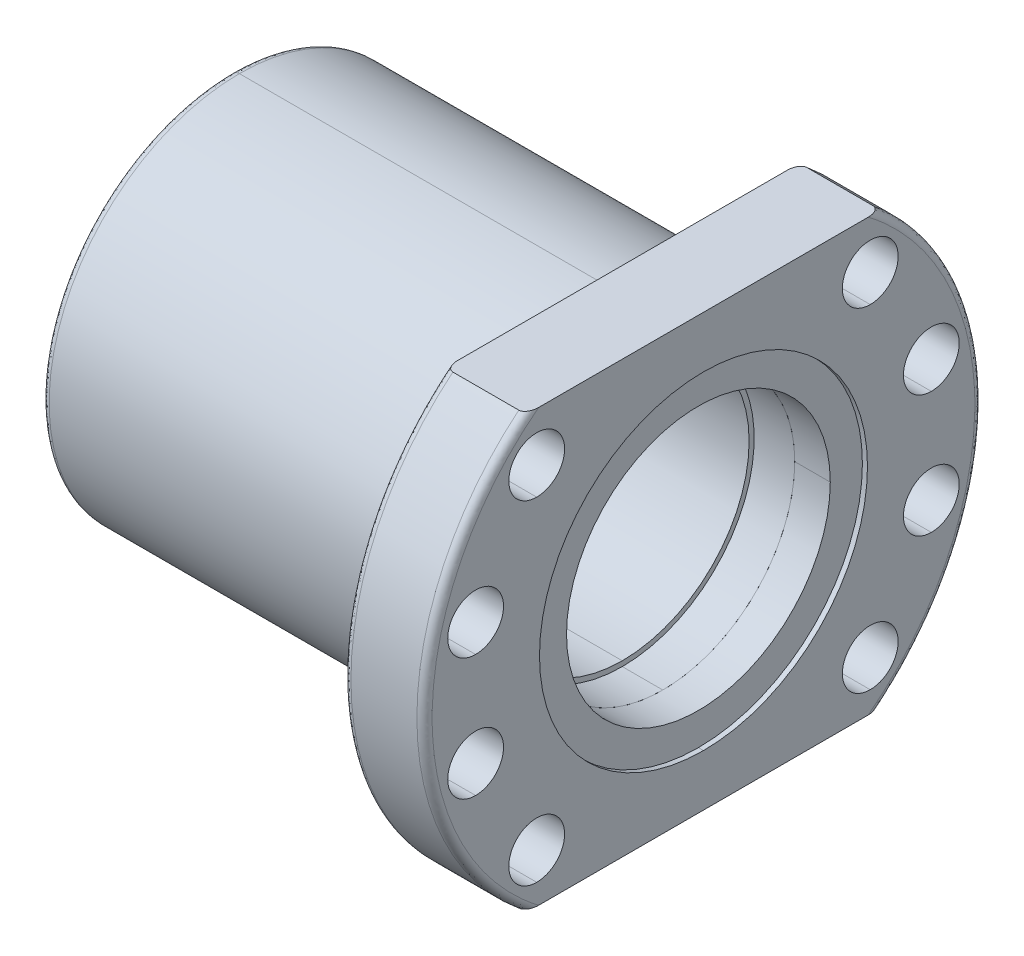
ISO-10303-21;
HEADER;
FILE_DESCRIPTION(('STEP AP214'),'2;1');
FILE_NAME('part.step','',(''),(''),'','','');
FILE_SCHEMA(('AUTOMOTIVE_DESIGN { 1 0 10303 214 1 1 1 1 }'));
ENDSEC;
DATA;
#1=APPLICATION_CONTEXT('core data for automotive mechanical design processes');
#2=APPLICATION_PROTOCOL_DEFINITION('international standard','automotive_design',2000,#1);
#3=PRODUCT_CONTEXT('',#1,'mechanical');
#4=PRODUCT('Part','Part','',(#3));
#5=PRODUCT_RELATED_PRODUCT_CATEGORY('part','',(#4));
#6=PRODUCT_DEFINITION_FORMATION('','',#4);
#7=PRODUCT_DEFINITION_CONTEXT('part definition',#1,'design');
#8=PRODUCT_DEFINITION('design','',#6,#7);
#9=PRODUCT_DEFINITION_SHAPE('','',#8);
#10=(LENGTH_UNIT() NAMED_UNIT(*) SI_UNIT(.MILLI.,.METRE.));
#11=(NAMED_UNIT(*) PLANE_ANGLE_UNIT() SI_UNIT($,.RADIAN.));
#12=(NAMED_UNIT(*) SI_UNIT($,.STERADIAN.) SOLID_ANGLE_UNIT());
#13=UNCERTAINTY_MEASURE_WITH_UNIT(LENGTH_MEASURE(1.E-05),#10,'distance_accuracy_value','');
#14=(GEOMETRIC_REPRESENTATION_CONTEXT(3) GLOBAL_UNCERTAINTY_ASSIGNED_CONTEXT((#13)) GLOBAL_UNIT_ASSIGNED_CONTEXT((#10,
#11,#12)) REPRESENTATION_CONTEXT('',''));
#15=CARTESIAN_POINT('',(0.,0.,0.));
#16=DIRECTION('',(0.,0.,1.));
#17=DIRECTION('',(1.,0.,0.));
#18=AXIS2_PLACEMENT_3D('',#15,#16,#17);
#19=CARTESIAN_POINT('',(-36.,0.,0.));
#20=DIRECTION('',(-1.,0.,0.));
#21=DIRECTION('',(0.,0.,1.));
#22=AXIS2_PLACEMENT_3D('',#19,#20,#21);
#23=PLANE('',#22);
#24=CARTESIAN_POINT('',(-36.,0.,0.));
#25=DIRECTION('',(-1.,0.,0.));
#26=DIRECTION('',(0.,-1.,0.));
#27=AXIS2_PLACEMENT_3D('',#24,#25,#26);
#28=CIRCLE('',#27,25.);
#29=CARTESIAN_POINT('',(-36.,-25.,0.));
#30=VERTEX_POINT('',#29);
#31=CARTESIAN_POINT('',(-36.,25.,0.));
#32=VERTEX_POINT('',#31);
#33=EDGE_CURVE('P0_E11',#30,#32,#28,.T.);
#34=ORIENTED_EDGE('',*,*,#33,.T.);
#35=CARTESIAN_POINT('',(-36.,0.,0.));
#36=DIRECTION('',(-1.,0.,0.));
#37=DIRECTION('',(0.,-1.,0.));
#38=AXIS2_PLACEMENT_3D('',#35,#36,#37);
#39=CIRCLE('',#38,25.);
#40=EDGE_CURVE('P0_E1471',#32,#30,#39,.T.);
#41=ORIENTED_EDGE('',*,*,#40,.T.);
#42=EDGE_LOOP('',(#34,#41));
#43=FACE_BOUND('',#42,.T.);
#44=CARTESIAN_POINT('',(-36.,0.,0.));
#45=DIRECTION('',(1.,0.,0.));
#46=DIRECTION('',(0.,-1.,0.));
#47=AXIS2_PLACEMENT_3D('',#44,#45,#46);
#48=CIRCLE('',#47,26.);
#49=CARTESIAN_POINT('',(-36.,-26.,0.));
#50=VERTEX_POINT('',#49);
#51=CARTESIAN_POINT('',(-36.,26.,0.));
#52=VERTEX_POINT('',#51);
#53=EDGE_CURVE('P0_E397',#50,#52,#48,.T.);
#54=ORIENTED_EDGE('',*,*,#53,.T.);
#55=CARTESIAN_POINT('',(-36.,0.,0.));
#56=DIRECTION('',(1.,0.,0.));
#57=DIRECTION('',(0.,-1.,0.));
#58=AXIS2_PLACEMENT_3D('',#55,#56,#57);
#59=CIRCLE('',#58,26.);
#60=EDGE_CURVE('P0_E1387',#52,#50,#59,.T.);
#61=ORIENTED_EDGE('',*,*,#60,.T.);
#62=EDGE_LOOP('',(#54,#61));
#63=FACE_BOUND('',#62,.T.);
#64=ADVANCED_FACE('P0_F17',(#43,#63),#23,.F.);
#65=CARTESIAN_POINT('',(0.,0.,0.));
#66=DIRECTION('',(-1.,0.,0.));
#67=DIRECTION('',(0.,-1.,0.));
#68=AXIS2_PLACEMENT_3D('',#65,#66,#67);
#69=CYLINDRICAL_SURFACE('',#68,25.);
#70=DIRECTION('',(-1.,0.,0.));
#71=VECTOR('',#70,1.);
#72=CARTESIAN_POINT('',(0.,25.,0.));
#73=LINE('',#72,#71);
#74=CARTESIAN_POINT('',(-111.5,25.,0.));
#75=VERTEX_POINT('',#74);
#76=EDGE_CURVE('P0_E1463',#32,#75,#73,.T.);
#77=ORIENTED_EDGE('',*,*,#76,.F.);
#78=ORIENTED_EDGE('',*,*,#33,.F.);
#79=DIRECTION('',(-1.,0.,0.));
#80=VECTOR('',#79,1.);
#81=CARTESIAN_POINT('',(0.,-25.,0.));
#82=LINE('',#81,#80);
#83=CARTESIAN_POINT('',(-111.5,-25.,0.));
#84=VERTEX_POINT('',#83);
#85=EDGE_CURVE('P0_E1440',#30,#84,#82,.T.);
#86=ORIENTED_EDGE('',*,*,#85,.T.);
#87=CARTESIAN_POINT('',(-111.5,0.,0.));
#88=DIRECTION('',(-1.,0.,0.));
#89=DIRECTION('',(0.,1.,0.));
#90=AXIS2_PLACEMENT_3D('',#87,#88,#89);
#91=CIRCLE('',#90,25.);
#92=EDGE_CURVE('P0_E1276',#84,#75,#91,.T.);
#93=ORIENTED_EDGE('',*,*,#92,.T.);
#94=EDGE_LOOP('',(#77,#78,#86,#93));
#95=FACE_BOUND('',#94,.T.);
#96=ADVANCED_FACE('P0_F1647',(#95),#69,.F.);
#97=CARTESIAN_POINT('',(-111.5,-37.5,0.));
#98=CARTESIAN_POINT('',(-111.5,-37.5,-75.));
#99=CARTESIAN_POINT('',(-111.5,37.5,-75.));
#100=CARTESIAN_POINT('',(-111.5,37.5,0.));
#101=CARTESIAN_POINT('',(-112.37867965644,-37.5,0.));
#102=CARTESIAN_POINT('',(-112.37867965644,-37.5,-75.));
#103=CARTESIAN_POINT('',(-112.37867965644,37.5,-75.));
#104=CARTESIAN_POINT('',(-112.37867965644,37.5,0.));
#105=CARTESIAN_POINT('',(-113.,-36.8786796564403,0.));
#106=CARTESIAN_POINT('',(-113.,-36.8786796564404,-73.7573593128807));
#107=CARTESIAN_POINT('',(-113.,36.8786796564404,-73.7573593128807));
#108=CARTESIAN_POINT('',(-113.,36.8786796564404,0.));
#109=CARTESIAN_POINT('',(-113.,-36.,0.));
#110=CARTESIAN_POINT('',(-113.,-36.,-72.));
#111=CARTESIAN_POINT('',(-113.,36.,-72.));
#112=CARTESIAN_POINT('',(-113.,36.,0.));
#113=(BOUNDED_SURFACE() B_SPLINE_SURFACE(3,3,((#97,#98,#99,#100),(#101,#102,#103,#104),(#105,
#106,#107,#108),(#109,#110,#111,#112)),.UNSPECIFIED.,.F.,.F.,
.F.) B_SPLINE_SURFACE_WITH_KNOTS((4,4),(4,4),(0.,1.),(0.,1.),
.UNSPECIFIED.) GEOMETRIC_REPRESENTATION_ITEM() RATIONAL_B_SPLINE_SURFACE(((1.,0.333333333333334,
0.333333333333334,1.),(0.804737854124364,0.268245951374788,0.268245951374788,0.804737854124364),
(0.804737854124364,0.268245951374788,0.268245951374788,0.804737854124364),(1.,0.333333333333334,
0.333333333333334,1.))) REPRESENTATION_ITEM('') SURFACE());
#114=CARTESIAN_POINT('',(-111.5,0.,0.));
#115=DIRECTION('',(1.,0.,0.));
#116=DIRECTION('',(0.,1.,0.));
#117=AXIS2_PLACEMENT_3D('',#114,#115,#116);
#118=CIRCLE('',#117,37.5);
#119=CARTESIAN_POINT('',(-111.5,-37.5,0.));
#120=VERTEX_POINT('',#119);
#121=CARTESIAN_POINT('',(-111.5,37.5,0.));
#122=VERTEX_POINT('',#121);
#123=EDGE_CURVE('P0_E28',#120,#122,#118,.T.);
#124=CARTESIAN_POINT('',(-111.5,-36.,0.));
#125=DIRECTION('',(0.,0.,-1.));
#126=DIRECTION('',(0.,-1.,0.));
#127=AXIS2_PLACEMENT_3D('',#124,#125,#126);
#128=CIRCLE('',#127,1.5);
#129=CARTESIAN_POINT('',(-113.,-36.,0.));
#130=VERTEX_POINT('',#129);
#131=EDGE_CURVE('P0_E845',#120,#130,#128,.T.);
#132=CARTESIAN_POINT('',(-113.,-36.,0.));
#133=CARTESIAN_POINT('',(-113.,-36.,-72.));
#134=CARTESIAN_POINT('',(-113.,36.,-72.));
#135=CARTESIAN_POINT('',(-113.,36.,0.));
#136=(BOUNDED_CURVE() B_SPLINE_CURVE(3,(#132,#133,#134,#135),.UNSPECIFIED.,.F.,
.F.) B_SPLINE_CURVE_WITH_KNOTS((4,4),(0.,1.),
.UNSPECIFIED.) CURVE() GEOMETRIC_REPRESENTATION_ITEM() RATIONAL_B_SPLINE_CURVE((1.,
0.333333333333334,0.333333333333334,1.)) REPRESENTATION_ITEM(''));
#137=CARTESIAN_POINT('',(-113.,36.,0.));
#138=VERTEX_POINT('',#137);
#139=EDGE_CURVE('P0_E1105',#130,#138,#136,.T.);
#140=CARTESIAN_POINT('',(-111.5,36.,0.));
#141=DIRECTION('',(0.,0.,1.));
#142=DIRECTION('',(0.,1.,0.));
#143=AXIS2_PLACEMENT_3D('',#140,#141,#142);
#144=CIRCLE('',#143,1.5);
#145=EDGE_CURVE('P0_E511',#122,#138,#144,.T.);
#146=ORIENTED_EDGE('',*,*,#123,.F.);
#147=ORIENTED_EDGE('',*,*,#131,.T.);
#148=ORIENTED_EDGE('',*,*,#139,.T.);
#149=ORIENTED_EDGE('',*,*,#145,.F.);
#150=EDGE_LOOP('',(#146,#147,#148,#149));
#151=FACE_BOUND('',#150,.T.);
#152=ADVANCED_FACE('P0_F1651',(#151),#113,.T.);
#153=CARTESIAN_POINT('',(-111.5,0.,0.));
#154=DIRECTION('',(1.,0.,0.));
#155=DIRECTION('',(0.,1.,0.));
#156=AXIS2_PLACEMENT_3D('',#153,#154,#155);
#157=CYLINDRICAL_SURFACE('',#156,37.5);
#158=DIRECTION('',(1.,0.,0.));
#159=VECTOR('',#158,1.);
#160=CARTESIAN_POINT('',(-111.5,-37.5,0.));
#161=LINE('',#160,#159);
#162=CARTESIAN_POINT('',(-36.,-37.5,0.));
#163=VERTEX_POINT('',#162);
#164=EDGE_CURVE('P0_E1421',#120,#163,#161,.T.);
#165=ORIENTED_EDGE('',*,*,#164,.F.);
#166=ORIENTED_EDGE('',*,*,#123,.T.);
#167=DIRECTION('',(1.,0.,0.));
#168=VECTOR('',#167,1.);
#169=CARTESIAN_POINT('',(-111.5,37.5,0.));
#170=LINE('',#169,#168);
#171=CARTESIAN_POINT('',(-36.,37.5,0.));
#172=VERTEX_POINT('',#171);
#173=EDGE_CURVE('P0_E1382',#122,#172,#170,.T.);
#174=ORIENTED_EDGE('',*,*,#173,.T.);
#175=CARTESIAN_POINT('',(-36.,0.,0.));
#176=DIRECTION('',(-1.,0.,0.));
#177=DIRECTION('',(0.,1.,0.));
#178=AXIS2_PLACEMENT_3D('',#175,#176,#177);
#179=CIRCLE('',#178,37.5);
#180=EDGE_CURVE('P0_E635',#172,#163,#179,.T.);
#181=ORIENTED_EDGE('',*,*,#180,.T.);
#182=EDGE_LOOP('',(#165,#166,#174,#181));
#183=FACE_BOUND('',#182,.T.);
#184=ADVANCED_FACE('P0_F1819',(#183),#157,.T.);
#185=CARTESIAN_POINT('',(-20.,12.04,44.92));
#186=DIRECTION('',(-1.,0.,0.));
#187=DIRECTION('',(0.,-1.,0.));
#188=AXIS2_PLACEMENT_3D('',#185,#186,#187);
#189=CYLINDRICAL_SURFACE('',#188,5.5);
#190=CARTESIAN_POINT('',(-20.,12.04,44.92));
#191=DIRECTION('',(-1.,0.,0.));
#192=DIRECTION('',(0.,-1.,0.));
#193=AXIS2_PLACEMENT_3D('',#190,#191,#192);
#194=CIRCLE('',#193,5.5);
#195=CARTESIAN_POINT('',(-20.,17.54,44.92));
#196=VERTEX_POINT('',#195);
#197=CARTESIAN_POINT('',(-20.,6.54,44.92));
#198=VERTEX_POINT('',#197);
#199=EDGE_CURVE('P0_E52',#196,#198,#194,.T.);
#200=ORIENTED_EDGE('',*,*,#199,.F.);
#201=DIRECTION('',(-1.,0.,0.));
#202=VECTOR('',#201,1.);
#203=CARTESIAN_POINT('',(-20.,17.54,44.92));
#204=LINE('',#203,#202);
#205=CARTESIAN_POINT('',(-36.,17.54,44.92));
#206=VERTEX_POINT('',#205);
#207=EDGE_CURVE('P0_E885',#196,#206,#204,.T.);
#208=ORIENTED_EDGE('',*,*,#207,.T.);
#209=CARTESIAN_POINT('',(-36.,12.04,44.92));
#210=DIRECTION('',(-1.,0.,0.));
#211=DIRECTION('',(0.,-1.,0.));
#212=AXIS2_PLACEMENT_3D('',#209,#210,#211);
#213=CIRCLE('',#212,5.5);
#214=CARTESIAN_POINT('',(-36.,6.54,44.92));
#215=VERTEX_POINT('',#214);
#216=EDGE_CURVE('P0_E42',#206,#215,#213,.T.);
#217=ORIENTED_EDGE('',*,*,#216,.T.);
#218=DIRECTION('',(-1.,0.,0.));
#219=VECTOR('',#218,1.);
#220=CARTESIAN_POINT('',(-20.,6.54,44.92));
#221=LINE('',#220,#219);
#222=EDGE_CURVE('P0_E868',#198,#215,#221,.T.);
#223=ORIENTED_EDGE('',*,*,#222,.F.);
#224=EDGE_LOOP('',(#200,#208,#217,#223));
#225=FACE_BOUND('',#224,.T.);
#226=ADVANCED_FACE('P0_F1823',(#225),#189,.F.);
#227=CARTESIAN_POINT('',(-20.,-12.04,44.92));
#228=DIRECTION('',(-1.,0.,0.));
#229=DIRECTION('',(0.,-1.,0.));
#230=AXIS2_PLACEMENT_3D('',#227,#228,#229);
#231=CYLINDRICAL_SURFACE('',#230,5.5);
#232=CARTESIAN_POINT('',(-20.,-12.04,44.92));
#233=DIRECTION('',(-1.,0.,0.));
#234=DIRECTION('',(0.,-1.,0.));
#235=AXIS2_PLACEMENT_3D('',#232,#233,#234);
#236=CIRCLE('',#235,5.5);
#237=CARTESIAN_POINT('',(-20.,-6.54,44.92));
#238=VERTEX_POINT('',#237);
#239=CARTESIAN_POINT('',(-20.,-17.54,44.92));
#240=VERTEX_POINT('',#239);
#241=EDGE_CURVE('P0_E1527',#238,#240,#236,.T.);
#242=ORIENTED_EDGE('',*,*,#241,.F.);
#243=DIRECTION('',(-1.,0.,0.));
#244=VECTOR('',#243,1.);
#245=CARTESIAN_POINT('',(-20.,-6.54,44.92));
#246=LINE('',#245,#244);
#247=CARTESIAN_POINT('',(-36.,-6.54,44.92));
#248=VERTEX_POINT('',#247);
#249=EDGE_CURVE('P0_E905',#238,#248,#246,.T.);
#250=ORIENTED_EDGE('',*,*,#249,.T.);
#251=CARTESIAN_POINT('',(-36.,-12.04,44.92));
#252=DIRECTION('',(-1.,0.,0.));
#253=DIRECTION('',(0.,-1.,0.));
#254=AXIS2_PLACEMENT_3D('',#251,#252,#253);
#255=CIRCLE('',#254,5.5);
#256=CARTESIAN_POINT('',(-36.,-17.54,44.92));
#257=VERTEX_POINT('',#256);
#258=EDGE_CURVE('P0_E777',#248,#257,#255,.T.);
#259=ORIENTED_EDGE('',*,*,#258,.T.);
#260=DIRECTION('',(-1.,0.,0.));
#261=VECTOR('',#260,1.);
#262=CARTESIAN_POINT('',(-20.,-17.54,44.92));
#263=LINE('',#262,#261);
#264=EDGE_CURVE('P0_E904',#240,#257,#263,.T.);
#265=ORIENTED_EDGE('',*,*,#264,.F.);
#266=EDGE_LOOP('',(#242,#250,#259,#265));
#267=FACE_BOUND('',#266,.T.);
#268=ADVANCED_FACE('P0_F1616',(#267),#231,.F.);
#269=CARTESIAN_POINT('',(-20.,-12.04,-44.92));
#270=DIRECTION('',(-1.,0.,0.));
#271=DIRECTION('',(0.,-1.,0.));
#272=AXIS2_PLACEMENT_3D('',#269,#270,#271);
#273=CYLINDRICAL_SURFACE('',#272,5.5);
#274=CARTESIAN_POINT('',(-20.,-12.04,-44.92));
#275=DIRECTION('',(-1.,0.,0.));
#276=DIRECTION('',(0.,-1.,0.));
#277=AXIS2_PLACEMENT_3D('',#274,#275,#276);
#278=CIRCLE('',#277,5.5);
#279=CARTESIAN_POINT('',(-20.,-6.54,-44.92));
#280=VERTEX_POINT('',#279);
#281=CARTESIAN_POINT('',(-20.,-17.54,-44.92));
#282=VERTEX_POINT('',#281);
#283=EDGE_CURVE('P0_E855',#280,#282,#278,.T.);
#284=ORIENTED_EDGE('',*,*,#283,.F.);
#285=DIRECTION('',(-1.,0.,0.));
#286=VECTOR('',#285,1.);
#287=CARTESIAN_POINT('',(-20.,-6.54,-44.92));
#288=LINE('',#287,#286);
#289=CARTESIAN_POINT('',(-36.,-6.54,-44.92));
#290=VERTEX_POINT('',#289);
#291=EDGE_CURVE('P0_E934',#280,#290,#288,.T.);
#292=ORIENTED_EDGE('',*,*,#291,.T.);
#293=CARTESIAN_POINT('',(-36.,-12.04,-44.92));
#294=DIRECTION('',(-1.,0.,0.));
#295=DIRECTION('',(0.,-1.,0.));
#296=AXIS2_PLACEMENT_3D('',#293,#294,#295);
#297=CIRCLE('',#296,5.5);
#298=CARTESIAN_POINT('',(-36.,-17.54,-44.92));
#299=VERTEX_POINT('',#298);
#300=EDGE_CURVE('P0_E785',#290,#299,#297,.T.);
#301=ORIENTED_EDGE('',*,*,#300,.T.);
#302=DIRECTION('',(-1.,0.,0.));
#303=VECTOR('',#302,1.);
#304=CARTESIAN_POINT('',(-20.,-17.54,-44.92));
#305=LINE('',#304,#303);
#306=EDGE_CURVE('P0_E924',#282,#299,#305,.T.);
#307=ORIENTED_EDGE('',*,*,#306,.F.);
#308=EDGE_LOOP('',(#284,#292,#301,#307));
#309=FACE_BOUND('',#308,.T.);
#310=ADVANCED_FACE('P0_F1611',(#309),#273,.F.);
#311=CARTESIAN_POINT('',(-20.,12.04,-44.92));
#312=DIRECTION('',(-1.,0.,0.));
#313=DIRECTION('',(0.,-1.,0.));
#314=AXIS2_PLACEMENT_3D('',#311,#312,#313);
#315=CYLINDRICAL_SURFACE('',#314,5.5);
#316=CARTESIAN_POINT('',(-20.,12.04,-44.92));
#317=DIRECTION('',(-1.,0.,0.));
#318=DIRECTION('',(0.,-1.,0.));
#319=AXIS2_PLACEMENT_3D('',#316,#317,#318);
#320=CIRCLE('',#319,5.5);
#321=CARTESIAN_POINT('',(-20.,17.54,-44.92));
#322=VERTEX_POINT('',#321);
#323=CARTESIAN_POINT('',(-20.,6.54,-44.92));
#324=VERTEX_POINT('',#323);
#325=EDGE_CURVE('P0_E851',#322,#324,#320,.T.);
#326=ORIENTED_EDGE('',*,*,#325,.F.);
#327=DIRECTION('',(-1.,0.,0.));
#328=VECTOR('',#327,1.);
#329=CARTESIAN_POINT('',(-20.,17.54,-44.92));
#330=LINE('',#329,#328);
#331=CARTESIAN_POINT('',(-36.,17.54,-44.92));
#332=VERTEX_POINT('',#331);
#333=EDGE_CURVE('P0_E956',#322,#332,#330,.T.);
#334=ORIENTED_EDGE('',*,*,#333,.T.);
#335=CARTESIAN_POINT('',(-36.,12.04,-44.92));
#336=DIRECTION('',(-1.,0.,0.));
#337=DIRECTION('',(0.,-1.,0.));
#338=AXIS2_PLACEMENT_3D('',#335,#336,#337);
#339=CIRCLE('',#338,5.5);
#340=CARTESIAN_POINT('',(-36.,6.54,-44.92));
#341=VERTEX_POINT('',#340);
#342=EDGE_CURVE('P0_E793',#332,#341,#339,.T.);
#343=ORIENTED_EDGE('',*,*,#342,.T.);
#344=DIRECTION('',(-1.,0.,0.));
#345=VECTOR('',#344,1.);
#346=CARTESIAN_POINT('',(-20.,6.54,-44.92));
#347=LINE('',#346,#345);
#348=EDGE_CURVE('P0_E940',#324,#341,#347,.T.);
#349=ORIENTED_EDGE('',*,*,#348,.F.);
#350=EDGE_LOOP('',(#326,#334,#343,#349));
#351=FACE_BOUND('',#350,.T.);
#352=ADVANCED_FACE('P0_F1615',(#351),#315,.F.);
#353=CARTESIAN_POINT('',(-20.,-32.88,-32.88));
#354=DIRECTION('',(-1.,0.,0.));
#355=DIRECTION('',(0.,-1.,0.));
#356=AXIS2_PLACEMENT_3D('',#353,#354,#355);
#357=CYLINDRICAL_SURFACE('',#356,5.5);
#358=CARTESIAN_POINT('',(-20.,-32.88,-32.88));
#359=DIRECTION('',(-1.,0.,0.));
#360=DIRECTION('',(0.,-1.,0.));
#361=AXIS2_PLACEMENT_3D('',#358,#359,#360);
#362=CIRCLE('',#361,5.5);
#363=CARTESIAN_POINT('',(-20.,-27.38,-32.88));
#364=VERTEX_POINT('',#363);
#365=CARTESIAN_POINT('',(-20.,-38.38,-32.88));
#366=VERTEX_POINT('',#365);
#367=EDGE_CURVE('P0_E856',#364,#366,#362,.T.);
#368=ORIENTED_EDGE('',*,*,#367,.F.);
#369=DIRECTION('',(-1.,0.,0.));
#370=VECTOR('',#369,1.);
#371=CARTESIAN_POINT('',(-20.,-27.38,-32.88));
#372=LINE('',#371,#370);
#373=CARTESIAN_POINT('',(-36.,-27.38,-32.88));
#374=VERTEX_POINT('',#373);
#375=EDGE_CURVE('P0_E990',#364,#374,#372,.T.);
#376=ORIENTED_EDGE('',*,*,#375,.T.);
#377=CARTESIAN_POINT('',(-36.,-32.88,-32.88));
#378=DIRECTION('',(-1.,0.,0.));
#379=DIRECTION('',(0.,-1.,0.));
#380=AXIS2_PLACEMENT_3D('',#377,#378,#379);
#381=CIRCLE('',#380,5.5);
#382=CARTESIAN_POINT('',(-36.,-38.38,-32.88));
#383=VERTEX_POINT('',#382);
#384=EDGE_CURVE('P0_E801',#374,#383,#381,.T.);
#385=ORIENTED_EDGE('',*,*,#384,.T.);
#386=DIRECTION('',(-1.,0.,0.));
#387=VECTOR('',#386,1.);
#388=CARTESIAN_POINT('',(-20.,-38.38,-32.88));
#389=LINE('',#388,#387);
#390=EDGE_CURVE('P0_E973',#366,#383,#389,.T.);
#391=ORIENTED_EDGE('',*,*,#390,.F.);
#392=EDGE_LOOP('',(#368,#376,#385,#391));
#393=FACE_BOUND('',#392,.T.);
#394=ADVANCED_FACE('P0_F1982',(#393),#357,.F.);
#395=CARTESIAN_POINT('',(-20.,-32.88,32.88));
#396=DIRECTION('',(-1.,0.,0.));
#397=DIRECTION('',(0.,-1.,0.));
#398=AXIS2_PLACEMENT_3D('',#395,#396,#397);
#399=CYLINDRICAL_SURFACE('',#398,5.5);
#400=CARTESIAN_POINT('',(-20.,-32.88,32.88));
#401=DIRECTION('',(-1.,0.,0.));
#402=DIRECTION('',(0.,-1.,0.));
#403=AXIS2_PLACEMENT_3D('',#400,#401,#402);
#404=CIRCLE('',#403,5.5);
#405=CARTESIAN_POINT('',(-20.,-27.38,32.88));
#406=VERTEX_POINT('',#405);
#407=CARTESIAN_POINT('',(-20.,-38.38,32.88));
#408=VERTEX_POINT('',#407);
#409=EDGE_CURVE('P0_E1378',#406,#408,#404,.T.);
#410=ORIENTED_EDGE('',*,*,#409,.F.);
#411=DIRECTION('',(-1.,0.,0.));
#412=VECTOR('',#411,1.);
#413=CARTESIAN_POINT('',(-20.,-27.38,32.88));
#414=LINE('',#413,#412);
#415=CARTESIAN_POINT('',(-36.,-27.38,32.88));
#416=VERTEX_POINT('',#415);
#417=EDGE_CURVE('P0_E1021',#406,#416,#414,.T.);
#418=ORIENTED_EDGE('',*,*,#417,.T.);
#419=CARTESIAN_POINT('',(-36.,-32.88,32.88));
#420=DIRECTION('',(-1.,0.,0.));
#421=DIRECTION('',(0.,-1.,0.));
#422=AXIS2_PLACEMENT_3D('',#419,#420,#421);
#423=CIRCLE('',#422,5.5);
#424=CARTESIAN_POINT('',(-36.,-38.38,32.88));
#425=VERTEX_POINT('',#424);
#426=EDGE_CURVE('P0_E808',#416,#425,#423,.T.);
#427=ORIENTED_EDGE('',*,*,#426,.T.);
#428=DIRECTION('',(-1.,0.,0.));
#429=VECTOR('',#428,1.);
#430=CARTESIAN_POINT('',(-20.,-38.38,32.88));
#431=LINE('',#430,#429);
#432=EDGE_CURVE('P0_E1004',#408,#425,#431,.T.);
#433=ORIENTED_EDGE('',*,*,#432,.F.);
#434=EDGE_LOOP('',(#410,#418,#427,#433));
#435=FACE_BOUND('',#434,.T.);
#436=ADVANCED_FACE('P0_F1971',(#435),#399,.F.);
#437=CARTESIAN_POINT('',(-20.,32.88,32.88));
#438=DIRECTION('',(-1.,0.,0.));
#439=DIRECTION('',(0.,-1.,0.));
#440=AXIS2_PLACEMENT_3D('',#437,#438,#439);
#441=CYLINDRICAL_SURFACE('',#440,5.5);
#442=CARTESIAN_POINT('',(-20.,32.88,32.88));
#443=DIRECTION('',(-1.,0.,0.));
#444=DIRECTION('',(0.,-1.,0.));
#445=AXIS2_PLACEMENT_3D('',#442,#443,#444);
#446=CIRCLE('',#445,5.5);
#447=CARTESIAN_POINT('',(-20.,38.38,32.88));
#448=VERTEX_POINT('',#447);
#449=CARTESIAN_POINT('',(-20.,27.38,32.88));
#450=VERTEX_POINT('',#449);
#451=EDGE_CURVE('P0_E732',#448,#450,#446,.T.);
#452=ORIENTED_EDGE('',*,*,#451,.F.);
#453=DIRECTION('',(-1.,0.,0.));
#454=VECTOR('',#453,1.);
#455=CARTESIAN_POINT('',(-20.,38.38,32.88));
#456=LINE('',#455,#454);
#457=CARTESIAN_POINT('',(-36.,38.38,32.88));
#458=VERTEX_POINT('',#457);
#459=EDGE_CURVE('P0_E1056',#448,#458,#456,.T.);
#460=ORIENTED_EDGE('',*,*,#459,.T.);
#461=CARTESIAN_POINT('',(-36.,32.88,32.88));
#462=DIRECTION('',(-1.,0.,0.));
#463=DIRECTION('',(0.,-1.,0.));
#464=AXIS2_PLACEMENT_3D('',#461,#462,#463);
#465=CIRCLE('',#464,5.5);
#466=CARTESIAN_POINT('',(-36.,27.38,32.88));
#467=VERTEX_POINT('',#466);
#468=EDGE_CURVE('P0_E621',#458,#467,#465,.T.);
#469=ORIENTED_EDGE('',*,*,#468,.T.);
#470=DIRECTION('',(-1.,0.,0.));
#471=VECTOR('',#470,1.);
#472=CARTESIAN_POINT('',(-20.,27.38,32.88));
#473=LINE('',#472,#471);
#474=EDGE_CURVE('P0_E1039',#450,#467,#473,.T.);
#475=ORIENTED_EDGE('',*,*,#474,.F.);
#476=EDGE_LOOP('',(#452,#460,#469,#475));
#477=FACE_BOUND('',#476,.T.);
#478=ADVANCED_FACE('P0_F1960',(#477),#441,.F.);
#479=CARTESIAN_POINT('',(-20.,32.88,-32.88));
#480=DIRECTION('',(-1.,0.,0.));
#481=DIRECTION('',(0.,-1.,0.));
#482=AXIS2_PLACEMENT_3D('',#479,#480,#481);
#483=CYLINDRICAL_SURFACE('',#482,5.5);
#484=CARTESIAN_POINT('',(-20.,32.88,-32.88));
#485=DIRECTION('',(-1.,0.,0.));
#486=DIRECTION('',(0.,-1.,0.));
#487=AXIS2_PLACEMENT_3D('',#484,#485,#486);
#488=CIRCLE('',#487,5.5);
#489=CARTESIAN_POINT('',(-20.,38.38,-32.88));
#490=VERTEX_POINT('',#489);
#491=CARTESIAN_POINT('',(-20.,27.38,-32.88));
#492=VERTEX_POINT('',#491);
#493=EDGE_CURVE('P0_E718',#490,#492,#488,.T.);
#494=ORIENTED_EDGE('',*,*,#493,.F.);
#495=DIRECTION('',(-1.,0.,0.));
#496=VECTOR('',#495,1.);
#497=CARTESIAN_POINT('',(-20.,38.38,-32.88));
#498=LINE('',#497,#496);
#499=CARTESIAN_POINT('',(-36.,38.38,-32.88));
#500=VERTEX_POINT('',#499);
#501=EDGE_CURVE('P0_E1090',#490,#500,#498,.T.);
#502=ORIENTED_EDGE('',*,*,#501,.T.);
#503=CARTESIAN_POINT('',(-36.,32.88,-32.88));
#504=DIRECTION('',(-1.,0.,0.));
#505=DIRECTION('',(0.,-1.,0.));
#506=AXIS2_PLACEMENT_3D('',#503,#504,#505);
#507=CIRCLE('',#506,5.5);
#508=CARTESIAN_POINT('',(-36.,27.38,-32.88));
#509=VERTEX_POINT('',#508);
#510=EDGE_CURVE('P0_E616',#500,#509,#507,.T.);
#511=ORIENTED_EDGE('',*,*,#510,.T.);
#512=DIRECTION('',(-1.,0.,0.));
#513=VECTOR('',#512,1.);
#514=CARTESIAN_POINT('',(-20.,27.38,-32.88));
#515=LINE('',#514,#513);
#516=EDGE_CURVE('P0_E1073',#492,#509,#515,.T.);
#517=ORIENTED_EDGE('',*,*,#516,.F.);
#518=EDGE_LOOP('',(#494,#502,#511,#517));
#519=FACE_BOUND('',#518,.T.);
#520=ADVANCED_FACE('P0_F1949',(#519),#483,.F.);
#521=CARTESIAN_POINT('',(-133.,0.,0.));
#522=DIRECTION('',(1.,0.,0.));
#523=DIRECTION('',(0.,1.,0.));
#524=AXIS2_PLACEMENT_3D('',#521,#522,#523);
#525=CYLINDRICAL_SURFACE('',#524,32.5);
#526=CARTESIAN_POINT('',(-113.,0.,0.));
#527=DIRECTION('',(-1.,0.,0.));
#528=DIRECTION('',(0.,1.,0.));
#529=AXIS2_PLACEMENT_3D('',#526,#527,#528);
#530=CIRCLE('',#529,32.5);
#531=CARTESIAN_POINT('',(-113.,32.5,0.));
#532=VERTEX_POINT('',#531);
#533=CARTESIAN_POINT('',(-113.,-32.5,0.));
#534=VERTEX_POINT('',#533);
#535=EDGE_CURVE('P0_E1098',#532,#534,#530,.T.);
#536=ORIENTED_EDGE('',*,*,#535,.T.);
#537=DIRECTION('',(1.,0.,0.));
#538=VECTOR('',#537,1.);
#539=CARTESIAN_POINT('',(-133.,-32.5,0.));
#540=LINE('',#539,#538);
#541=CARTESIAN_POINT('',(-111.5,-32.5,0.));
#542=VERTEX_POINT('',#541);
#543=EDGE_CURVE('P0_E1134',#534,#542,#540,.T.);
#544=ORIENTED_EDGE('',*,*,#543,.T.);
#545=CARTESIAN_POINT('',(-111.5,0.,0.));
#546=DIRECTION('',(-1.,0.,0.));
#547=DIRECTION('',(0.,1.,0.));
#548=AXIS2_PLACEMENT_3D('',#545,#546,#547);
#549=CIRCLE('',#548,32.5);
#550=CARTESIAN_POINT('',(-111.5,32.5,0.));
#551=VERTEX_POINT('',#550);
#552=EDGE_CURVE('P0_E1179',#551,#542,#549,.T.);
#553=ORIENTED_EDGE('',*,*,#552,.F.);
#554=DIRECTION('',(1.,0.,0.));
#555=VECTOR('',#554,1.);
#556=CARTESIAN_POINT('',(-133.,32.5,0.));
#557=LINE('',#556,#555);
#558=EDGE_CURVE('P0_E1119',#532,#551,#557,.T.);
#559=ORIENTED_EDGE('',*,*,#558,.F.);
#560=EDGE_LOOP('',(#536,#544,#553,#559));
#561=FACE_BOUND('',#560,.T.);
#562=ADVANCED_FACE('P0_F1938',(#561),#525,.F.);
#563=CARTESIAN_POINT('',(-133.,0.,0.));
#564=DIRECTION('',(1.,0.,0.));
#565=DIRECTION('',(0.,1.,0.));
#566=AXIS2_PLACEMENT_3D('',#563,#564,#565);
#567=CYLINDRICAL_SURFACE('',#566,32.332480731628);
#568=CARTESIAN_POINT('',(-28.,0.,0.));
#569=DIRECTION('',(1.,0.,0.));
#570=DIRECTION('',(0.,1.,0.));
#571=AXIS2_PLACEMENT_3D('',#568,#569,#570);
#572=CIRCLE('',#571,32.332480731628);
#573=CARTESIAN_POINT('',(-28.,-32.332480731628,0.));
#574=VERTEX_POINT('',#573);
#575=CARTESIAN_POINT('',(-28.,32.332480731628,0.));
#576=VERTEX_POINT('',#575);
#577=EDGE_CURVE('P0_E1188',#574,#576,#572,.T.);
#578=ORIENTED_EDGE('',*,*,#577,.F.);
#579=DIRECTION('',(1.,0.,0.));
#580=VECTOR('',#579,1.);
#581=CARTESIAN_POINT('',(-133.,-32.332480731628,0.));
#582=LINE('',#581,#580);
#583=CARTESIAN_POINT('',(-20.,-32.332480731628,0.));
#584=VERTEX_POINT('',#583);
#585=EDGE_CURVE('P0_E1156',#574,#584,#582,.T.);
#586=ORIENTED_EDGE('',*,*,#585,.T.);
#587=CARTESIAN_POINT('',(-20.,0.,0.));
#588=DIRECTION('',(-1.,0.,0.));
#589=DIRECTION('',(0.,1.,0.));
#590=AXIS2_PLACEMENT_3D('',#587,#588,#589);
#591=CIRCLE('',#590,32.332480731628);
#592=CARTESIAN_POINT('',(-20.,32.332480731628,0.));
#593=VERTEX_POINT('',#592);
#594=EDGE_CURVE('P0_E1403',#593,#584,#591,.T.);
#595=ORIENTED_EDGE('',*,*,#594,.F.);
#596=DIRECTION('',(1.,0.,0.));
#597=VECTOR('',#596,1.);
#598=CARTESIAN_POINT('',(-133.,32.332480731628,0.));
#599=LINE('',#598,#597);
#600=EDGE_CURVE('P0_E1148',#576,#593,#599,.T.);
#601=ORIENTED_EDGE('',*,*,#600,.F.);
#602=EDGE_LOOP('',(#578,#586,#595,#601));
#603=FACE_BOUND('',#602,.T.);
#604=ADVANCED_FACE('P0_F1927',(#603),#567,.F.);
#605=CARTESIAN_POINT('',(-106.,0.,0.));
#606=DIRECTION('',(-1.,0.,0.));
#607=DIRECTION('',(0.,0.,1.));
#608=AXIS2_PLACEMENT_3D('',#605,#606,#607);
#609=CYLINDRICAL_SURFACE('',#608,32.332480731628);
#610=CARTESIAN_POINT('',(-111.5,0.,0.));
#611=DIRECTION('',(-1.,0.,0.));
#612=DIRECTION('',(0.,0.,1.));
#613=AXIS2_PLACEMENT_3D('',#610,#611,#612);
#614=CIRCLE('',#613,32.332480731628);
#615=CARTESIAN_POINT('',(-111.5,0.,32.332480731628));
#616=VERTEX_POINT('',#615);
#617=CARTESIAN_POINT('',(-111.5,0.,-32.332480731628));
#618=VERTEX_POINT('',#617);
#619=EDGE_CURVE('P0_E1164',#616,#618,#614,.T.);
#620=ORIENTED_EDGE('',*,*,#619,.T.);
#621=DIRECTION('',(-1.,0.,0.));
#622=VECTOR('',#621,1.);
#623=CARTESIAN_POINT('',(-106.,0.,-32.332480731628));
#624=LINE('',#623,#622);
#625=CARTESIAN_POINT('',(-113.,0.,-32.332480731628));
#626=VERTEX_POINT('',#625);
#627=EDGE_CURVE('P0_E1220',#618,#626,#624,.T.);
#628=ORIENTED_EDGE('',*,*,#627,.T.);
#629=CARTESIAN_POINT('',(-113.,0.,0.));
#630=DIRECTION('',(1.,0.,0.));
#631=DIRECTION('',(0.,0.,1.));
#632=AXIS2_PLACEMENT_3D('',#629,#630,#631);
#633=CIRCLE('',#632,32.332480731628);
#634=CARTESIAN_POINT('',(-113.,0.,32.332480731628));
#635=VERTEX_POINT('',#634);
#636=EDGE_CURVE('P0_E1236',#626,#635,#633,.T.);
#637=ORIENTED_EDGE('',*,*,#636,.T.);
#638=DIRECTION('',(-1.,0.,0.));
#639=VECTOR('',#638,1.);
#640=CARTESIAN_POINT('',(-106.,0.,32.332480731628));
#641=LINE('',#640,#639);
#642=EDGE_CURVE('P0_E1204',#616,#635,#641,.T.);
#643=ORIENTED_EDGE('',*,*,#642,.F.);
#644=EDGE_LOOP('',(#620,#628,#637,#643));
#645=FACE_BOUND('',#644,.T.);
#646=ADVANCED_FACE('P0_F1917',(#645),#609,.T.);
#647=CARTESIAN_POINT('',(-106.,0.,0.));
#648=DIRECTION('',(-1.,0.,0.));
#649=DIRECTION('',(0.,0.,1.));
#650=AXIS2_PLACEMENT_3D('',#647,#648,#649);
#651=CYLINDRICAL_SURFACE('',#650,26.);
#652=CARTESIAN_POINT('',(-111.5,0.,0.));
#653=DIRECTION('',(-1.,0.,0.));
#654=DIRECTION('',(0.,0.,1.));
#655=AXIS2_PLACEMENT_3D('',#652,#653,#654);
#656=CIRCLE('',#655,26.);
#657=CARTESIAN_POINT('',(-111.5,0.,-26.));
#658=VERTEX_POINT('',#657);
#659=CARTESIAN_POINT('',(-111.5,0.,26.));
#660=VERTEX_POINT('',#659);
#661=EDGE_CURVE('P0_E1282',#658,#660,#656,.T.);
#662=ORIENTED_EDGE('',*,*,#661,.F.);
#663=DIRECTION('',(-1.,0.,0.));
#664=VECTOR('',#663,1.);
#665=CARTESIAN_POINT('',(-106.,0.,-26.));
#666=LINE('',#665,#664);
#667=CARTESIAN_POINT('',(-113.,0.,-26.));
#668=VERTEX_POINT('',#667);
#669=EDGE_CURVE('P0_E1269',#658,#668,#666,.T.);
#670=ORIENTED_EDGE('',*,*,#669,.T.);
#671=CARTESIAN_POINT('',(-113.,0.,0.));
#672=DIRECTION('',(-1.,0.,0.));
#673=DIRECTION('',(0.,0.,1.));
#674=AXIS2_PLACEMENT_3D('',#671,#672,#673);
#675=CIRCLE('',#674,26.);
#676=CARTESIAN_POINT('',(-113.,0.,26.));
#677=VERTEX_POINT('',#676);
#678=EDGE_CURVE('P0_E1228',#668,#677,#675,.T.);
#679=ORIENTED_EDGE('',*,*,#678,.T.);
#680=DIRECTION('',(-1.,0.,0.));
#681=VECTOR('',#680,1.);
#682=CARTESIAN_POINT('',(-106.,0.,26.));
#683=LINE('',#682,#681);
#684=EDGE_CURVE('P0_E1262',#660,#677,#683,.T.);
#685=ORIENTED_EDGE('',*,*,#684,.F.);
#686=EDGE_LOOP('',(#662,#670,#679,#685));
#687=FACE_BOUND('',#686,.T.);
#688=ADVANCED_FACE('P0_F654',(#687),#651,.F.);
#689=CARTESIAN_POINT('',(-20.,42.8553942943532,32.0260078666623));
#690=CARTESIAN_POINT('',(-20.,19.5042473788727,63.273193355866));
#691=CARTESIAN_POINT('',(-20.,-19.5042473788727,63.273193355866));
#692=CARTESIAN_POINT('',(-20.,-42.8553942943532,32.0260078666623));
#693=CARTESIAN_POINT('',(-20.,43.5592478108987,32.5520004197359));
#694=CARTESIAN_POINT('',(-20.,19.8245835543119,64.3123871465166));
#695=CARTESIAN_POINT('',(-20.,-19.8245835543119,64.3123871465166));
#696=CARTESIAN_POINT('',(-20.,-43.5592478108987,32.5520004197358));
#697=CARTESIAN_POINT('',(-20.6213203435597,44.0569474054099,32.9239333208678));
#698=CARTESIAN_POINT('',(-20.6213203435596,20.0510954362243,65.0472081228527));
#699=CARTESIAN_POINT('',(-20.6213203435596,-20.0510954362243,65.0472081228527));
#700=CARTESIAN_POINT('',(-20.6213203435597,-44.0569474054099,32.9239333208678));
#701=CARTESIAN_POINT('',(-21.5,44.0569474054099,32.9239333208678));
#702=CARTESIAN_POINT('',(-21.5,20.0510954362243,65.0472081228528));
#703=CARTESIAN_POINT('',(-21.5,-20.0510954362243,65.0472081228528));
#704=CARTESIAN_POINT('',(-21.5,-44.0569474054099,32.9239333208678));
#705=(BOUNDED_SURFACE() B_SPLINE_SURFACE(3,3,((#689,#690,#691,#692),(#693,#694,#695,#696),(#697,
#698,#699,#700),(#701,#702,#703,#704)),.UNSPECIFIED.,.F.,.F.,
.F.) B_SPLINE_SURFACE_WITH_KNOTS((4,4),(4,4),(0.,1.),(0.,1.),
.UNSPECIFIED.) GEOMETRIC_REPRESENTATION_ITEM() RATIONAL_B_SPLINE_SURFACE(((1.,0.732411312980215,
0.732411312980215,1.),(0.804737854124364,0.589399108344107,0.589399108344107,0.804737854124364),
(0.804737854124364,0.589399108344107,0.589399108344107,0.804737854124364),(1.,0.732411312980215,
0.732411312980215,1.))) REPRESENTATION_ITEM('') SURFACE());
#706=CARTESIAN_POINT('',(-21.5,0.,0.));
#707=DIRECTION('',(-1.,0.,0.));
#708=DIRECTION('',(0.,1.,0.));
#709=AXIS2_PLACEMENT_3D('',#706,#707,#708);
#710=CIRCLE('',#709,55.);
#711=CARTESIAN_POINT('',(-21.5,-42.5,34.9106001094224));
#712=VERTEX_POINT('',#711);
#713=CARTESIAN_POINT('',(-21.5,42.5,34.9106001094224));
#714=VERTEX_POINT('',#713);
#715=EDGE_CURVE('P0_E369',#712,#714,#710,.T.);
#716=CARTESIAN_POINT('',(-21.5,-42.4999999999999,34.9106001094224));
#717=CARTESIAN_POINT('',(-21.4880382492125,-42.5000000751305,34.9106003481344));
#718=CARTESIAN_POINT('',(-21.4760767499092,-42.5000067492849,34.9103664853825));
#719=CARTESIAN_POINT('',(-21.4520952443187,-42.5000298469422,34.9094342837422));
#720=CARTESIAN_POINT('',(-21.4400753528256,-42.5000463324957,34.9087329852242));
#721=CARTESIAN_POINT('',(-21.4159874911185,-42.5000856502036,34.9068632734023));
#722=CARTESIAN_POINT('',(-21.4039197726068,-42.5001085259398,34.9056916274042));
#723=CARTESIAN_POINT('',(-21.3797467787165,-42.5001576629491,34.9028792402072));
#724=CARTESIAN_POINT('',(-21.3676419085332,-42.5001839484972,34.9012350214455));
#725=CARTESIAN_POINT('',(-21.3434054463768,-42.5002372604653,34.8974757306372));
#726=CARTESIAN_POINT('',(-21.3312744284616,-42.5002642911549,34.8953569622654));
#727=CARTESIAN_POINT('',(-21.3069967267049,-42.5003168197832,34.8906471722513));
#728=CARTESIAN_POINT('',(-21.2948507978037,-42.5003423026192,34.8880522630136));
#729=CARTESIAN_POINT('',(-21.2705545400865,-42.5003898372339,34.8823891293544));
#730=CARTESIAN_POINT('',(-21.258405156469,-42.5004118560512,34.8793168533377));
#731=CARTESIAN_POINT('',(-21.2341134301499,-42.5004509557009,34.872698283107));
#732=CARTESIAN_POINT('',(-21.2219722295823,-42.5004679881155,34.8691478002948));
#733=CARTESIAN_POINT('',(-21.1977084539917,-42.5004960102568,34.8615724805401));
#734=CARTESIAN_POINT('',(-21.1855872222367,-42.5005069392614,34.8575433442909));
#735=CARTESIAN_POINT('',(-21.1613750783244,-42.5005220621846,34.8490107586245));
#736=CARTESIAN_POINT('',(-21.1492857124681,-42.5005261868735,34.8445029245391));
#737=CARTESIAN_POINT('',(-21.1251490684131,-42.5005274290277,34.8350133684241));
#738=CARTESIAN_POINT('',(-21.1131035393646,-42.5005244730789,34.8300272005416));
#739=CARTESIAN_POINT('',(-21.089066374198,-42.5005117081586,34.8195817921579));
#740=CARTESIAN_POINT('',(-21.0770766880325,-42.5005018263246,34.8141180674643));
#741=CARTESIAN_POINT('',(-21.0531630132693,-42.5004757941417,34.8027187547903));
#742=CARTESIAN_POINT('',(-21.0412411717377,-42.5004595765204,34.7967786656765));
#743=CARTESIAN_POINT('',(-21.0174749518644,-42.5004218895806,34.7844282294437));
#744=CARTESIAN_POINT('',(-21.0056329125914,-42.5004003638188,34.7780133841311));
#745=CARTESIAN_POINT('',(-20.9820379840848,-42.5003535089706,34.7647154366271));
#746=CARTESIAN_POINT('',(-20.9702876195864,-42.5003281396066,34.7578278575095));
#747=CARTESIAN_POINT('',(-20.946887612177,-42.5002754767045,34.7435868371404));
#748=CARTESIAN_POINT('',(-20.9352406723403,-42.5002481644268,34.7362289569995));
#749=CARTESIAN_POINT('',(-20.9120589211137,-42.5001939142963,34.7210501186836));
#750=CARTESIAN_POINT('',(-20.900526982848,-42.5001669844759,34.7132247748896));
#751=CARTESIAN_POINT('',(-20.8775864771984,-42.5001162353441,34.6971141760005));
#752=CARTESIAN_POINT('',(-20.8661809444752,-42.5000924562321,34.6888246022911));
#753=CARTESIAN_POINT('',(-20.8435041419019,-42.5000510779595,34.671789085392));
#754=CARTESIAN_POINT('',(-20.8322360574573,-42.5000335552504,34.6630389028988));
#755=CARTESIAN_POINT('',(-20.8098452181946,-42.5000084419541,34.645086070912));
#756=CARTESIAN_POINT('',(-20.7987257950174,-42.5000009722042,34.635879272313));
#757=CARTESIAN_POINT('',(-20.7707920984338,-42.4999984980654,34.6120217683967));
#758=CARTESIAN_POINT('',(-20.75417607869,-42.5000125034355,34.5971382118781));
#759=CARTESIAN_POINT('',(-20.7210214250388,-42.5000538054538,34.5661008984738));
#760=CARTESIAN_POINT('',(-20.7045077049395,-42.5000815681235,34.5499206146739));
#761=CARTESIAN_POINT('',(-20.6716097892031,-42.5001390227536,34.5162831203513));
#762=CARTESIAN_POINT('',(-20.6552511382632,-42.5001687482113,34.4988009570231));
#763=CARTESIAN_POINT('',(-20.6227184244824,-42.50022113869,34.4625569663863));
#764=CARTESIAN_POINT('',(-20.606570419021,-42.5002435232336,34.4437717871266));
#765=CARTESIAN_POINT('',(-20.5745158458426,-42.5002754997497,34.4049218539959));
#766=CARTESIAN_POINT('',(-20.5586357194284,-42.5002846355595,34.3848353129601));
#767=CARTESIAN_POINT('',(-20.5271752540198,-42.5002877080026,34.3433861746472));
#768=CARTESIAN_POINT('',(-20.511621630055,-42.5002811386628,34.322003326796));
#769=CARTESIAN_POINT('',(-20.480873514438,-42.5002541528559,34.2779685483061));
#770=CARTESIAN_POINT('',(-20.4657059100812,-42.5002333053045,34.2552978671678));
#771=CARTESIAN_POINT('',(-20.4357893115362,-42.5001824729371,34.2086980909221));
#772=CARTESIAN_POINT('',(-20.4210672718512,-42.5001522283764,34.1847517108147));
#773=CARTESIAN_POINT('',(-20.3921019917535,-42.5000930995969,34.13561459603));
#774=CARTESIAN_POINT('',(-20.3778857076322,-42.5000642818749,34.110407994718));
#775=CARTESIAN_POINT('',(-20.3499875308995,-42.5000154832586,34.0587693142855));
#776=CARTESIAN_POINT('',(-20.3363323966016,-42.4999957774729,34.032322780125));
#777=CARTESIAN_POINT('',(-20.3139244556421,-42.5000029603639,33.9869316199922));
#778=CARTESIAN_POINT('',(-20.3049263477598,-42.5000176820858,33.9681075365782));
#779=CARTESIAN_POINT('',(-20.2869028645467,-42.5000662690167,33.9291972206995));
#780=CARTESIAN_POINT('',(-20.2779036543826,-42.5001011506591,33.9090988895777));
#781=CARTESIAN_POINT('',(-20.2502718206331,-42.5002098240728,33.8453318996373));
#782=CARTESIAN_POINT('',(-20.2325293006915,-42.5002819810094,33.8012748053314));
#783=CARTESIAN_POINT('',(-20.1975966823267,-42.5003624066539,33.7081348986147));
#784=CARTESIAN_POINT('',(-20.1806196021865,-42.5003639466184,33.6589726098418));
#785=CARTESIAN_POINT('',(-20.1477818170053,-42.5003006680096,33.5556702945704));
#786=CARTESIAN_POINT('',(-20.1321377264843,-42.500230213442,33.5014615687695));
#787=CARTESIAN_POINT('',(-20.1025424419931,-42.5000719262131,33.3881831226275));
#788=CARTESIAN_POINT('',(-20.0888093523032,-42.4999831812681,33.3290563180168));
#789=CARTESIAN_POINT('',(-20.069333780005,-42.5000100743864,33.234015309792));
#790=CARTESIAN_POINT('',(-20.06259536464,-42.5000580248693,33.1983005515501));
#791=CARTESIAN_POINT('',(-20.0466233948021,-42.5001050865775,33.1062281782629));
#792=CARTESIAN_POINT('',(-20.0381635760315,-42.5000606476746,33.0497336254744));
#793=CARTESIAN_POINT('',(-20.0264409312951,-42.5000080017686,32.9572196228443));
#794=CARTESIAN_POINT('',(-20.0224102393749,-42.4999924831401,32.9212947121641));
#795=CARTESIAN_POINT('',(-20.0158309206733,-42.4999744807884,32.8542008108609));
#796=CARTESIAN_POINT('',(-20.0131556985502,-42.4999705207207,32.823044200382));
#797=CARTESIAN_POINT('',(-20.0068359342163,-42.4999587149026,32.7375208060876));
#798=CARTESIAN_POINT('',(-20.0039464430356,-42.4999501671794,32.6830965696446));
#799=CARTESIAN_POINT('',(-20.0007241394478,-42.4999587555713,32.5846600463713));
#800=CARTESIAN_POINT('',(-20.0000062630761,-42.4999712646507,32.5406600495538));
#801=CARTESIAN_POINT('',(-20.0000000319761,-42.4999999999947,32.4966635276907));
#802=B_SPLINE_CURVE_WITH_KNOTS('',3,(#716,#717,#718,#719,#720,#721,#722,#723,#724,#725,#726,
#727,#728,#729,#730,#731,#732,#733,#734,#735,#736,#737,#738,#739,#740,#741,#742,#743,#744,#745,
#746,#747,#748,#749,#750,#751,#752,#753,#754,#755,#756,#757,#758,#759,#760,#761,#762,#763,#764,
#765,#766,#767,#768,#769,#770,#771,#772,#773,#774,#775,#776,#777,#778,#779,#780,#781,#782,#783,
#784,#785,#786,#787,#788,#789,#790,#791,#792,#793,#794,#795,#796,#797,#798,#799,#800,#801),
.UNSPECIFIED.,.F.,.F.,(4,2,2,2,2,2,2,2,2,2,2,2,2,2,2,2,2,2,2,2,2,2,2,2,2,2,2,2,2,2,2,2,2,2,2,2,
2,2,2,2,2,2,4),(0.,0.035882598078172,0.0719945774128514,0.108359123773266,0.144998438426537,
0.181933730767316,0.21918521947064,0.256772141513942,0.294712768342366,0.333024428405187,
0.371723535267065,0.41082562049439,0.450345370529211,0.490296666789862,0.530692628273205,
0.57154565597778,0.612867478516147,0.654669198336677,0.696961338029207,0.739753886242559,
0.783056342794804,0.849953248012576,0.919289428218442,0.991094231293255,1.06538820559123,
1.14218397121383,1.22148702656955,1.30329650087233,1.38760586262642,1.47440359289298,
1.56367383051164,1.62626014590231,1.69231755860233,1.83473947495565,1.99070642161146,
2.15989401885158,2.34190176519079,2.45092403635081,2.62222863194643,2.73066683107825,
2.82447250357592,2.98792590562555,3.1199171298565),.UNSPECIFIED.);
#803=CARTESIAN_POINT('',(-20.,-42.5,32.4966635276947));
#804=VERTEX_POINT('',#803);
#805=EDGE_CURVE('P0_E388',#712,#804,#802,.T.);
#806=CARTESIAN_POINT('',(-20.,42.5,32.4966987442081));
#807=CARTESIAN_POINT('',(-20.,41.2049974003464,34.1913490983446));
#808=CARTESIAN_POINT('',(-20.,39.8100558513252,35.8052882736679));
#809=CARTESIAN_POINT('',(-20.,37.5681296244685,38.105431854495));
#810=CARTESIAN_POINT('',(-20.,36.7977912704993,38.8501220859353));
#811=CARTESIAN_POINT('',(-20.,35.2189789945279,40.2874769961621));
#812=CARTESIAN_POINT('',(-20.,33.5996318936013,41.6752209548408));
#813=CARTESIAN_POINT('',(-20.,31.4741109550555,43.2858735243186));
#814=CARTESIAN_POINT('',(-20.,30.0431205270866,44.2723343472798));
#815=CARTESIAN_POINT('',(-20.,29.4848226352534,44.6420527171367));
#816=CARTESIAN_POINT('',(-20.,29.2608701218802,44.7891648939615));
#817=CARTESIAN_POINT('',(-20.,29.1513282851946,44.8605369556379));
#818=CARTESIAN_POINT('',(-20.,28.8211620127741,45.0739726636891));
#819=CARTESIAN_POINT('',(-20.,26.832173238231,46.3392730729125));
#820=CARTESIAN_POINT('',(-20.,23.8553046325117,47.9678493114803));
#821=CARTESIAN_POINT('',(-20.,20.9795676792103,49.2261290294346));
#822=CARTESIAN_POINT('',(-20.,19.885184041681,49.6673562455));
#823=CARTESIAN_POINT('',(-20.,19.7604696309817,49.7170931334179));
#824=CARTESIAN_POINT('',(-20.,19.5264161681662,49.8094931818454));
#825=CARTESIAN_POINT('',(-20.,19.1749653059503,49.9468198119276));
#826=CARTESIAN_POINT('',(-20.,18.3523186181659,50.2583345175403));
#827=CARTESIAN_POINT('',(-20.,15.750548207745,51.1813492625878));
#828=CARTESIAN_POINT('',(-20.,12.8529463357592,51.9845236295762));
#829=CARTESIAN_POINT('',(-20.,10.3888557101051,52.4840432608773));
#830=CARTESIAN_POINT('',(-20.,9.64666317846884,52.6237116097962));
#831=CARTESIAN_POINT('',(-20.,9.41823318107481,52.6650226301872));
#832=CARTESIAN_POINT('',(-20.,8.95107661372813,52.7464762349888));
#833=CARTESIAN_POINT('',(-20.,7.78243795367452,52.9422789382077));
#834=CARTESIAN_POINT('',(-20.,6.61006308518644,53.0989250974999));
#835=CARTESIAN_POINT('',(-20.,3.78918988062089,53.399695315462));
#836=CARTESIAN_POINT('',(-20.,1.89783312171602,53.4999680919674));
#837=CARTESIAN_POINT('',(-20.,-1.89916921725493,53.5000319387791));
#838=CARTESIAN_POINT('',(-20.,-4.73362380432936,53.3496221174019));
#839=CARTESIAN_POINT('',(-20.,-7.78267504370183,52.9421843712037));
#840=CARTESIAN_POINT('',(-20.,-8.9519242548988,52.7462958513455));
#841=CARTESIAN_POINT('',(-20.,-9.41934691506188,52.6648059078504));
#842=CARTESIAN_POINT('',(-20.,-9.64810569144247,52.6234420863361));
#843=CARTESIAN_POINT('',(-20.,-10.3898726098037,52.483875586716));
#844=CARTESIAN_POINT('',(-20.,-12.852754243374,51.9846350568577));
#845=CARTESIAN_POINT('',(-20.,-15.7501636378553,51.1814332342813));
#846=CARTESIAN_POINT('',(-20.,-18.3529110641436,50.258061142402));
#847=CARTESIAN_POINT('',(-20.,-19.1759787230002,49.9464010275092));
#848=CARTESIAN_POINT('',(-20.,-19.5276335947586,49.8090052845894));
#849=CARTESIAN_POINT('',(-20.,-19.7618283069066,49.7165576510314));
#850=CARTESIAN_POINT('',(-20.,-19.8864489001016,49.6668621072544));
#851=CARTESIAN_POINT('',(-20.,-20.980247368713,49.2259004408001));
#852=CARTESIAN_POINT('',(-20.,-23.8548945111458,47.9680859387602));
#853=CARTESIAN_POINT('',(-20.,-26.8321120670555,46.3392242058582));
#854=CARTESIAN_POINT('',(-20.,-28.8221366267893,45.0733162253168));
#855=CARTESIAN_POINT('',(-20.,-29.1524902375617,44.8597716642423));
#856=CARTESIAN_POINT('',(-20.,-29.2621400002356,44.7883341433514));
#857=CARTESIAN_POINT('',(-20.,-29.4859698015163,44.6413118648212));
#858=CARTESIAN_POINT('',(-20.,-30.0439718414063,44.271809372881));
#859=CARTESIAN_POINT('',(-20.,-31.4743351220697,43.2857945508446));
#860=CARTESIAN_POINT('',(-20.,-33.5994157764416,41.6754024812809));
#861=CARTESIAN_POINT('',(-20.,-35.2189701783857,40.2874128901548));
#862=CARTESIAN_POINT('',(-20.,-36.798269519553,38.8495853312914));
#863=CARTESIAN_POINT('',(-20.,-37.5693101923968,38.1042417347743));
#864=CARTESIAN_POINT('',(-20.,-39.8101394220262,35.8053069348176));
#865=CARTESIAN_POINT('',(-20.,-41.204803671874,34.1916140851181));
#866=CARTESIAN_POINT('',(-20.,-42.5,32.4966635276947));
#867=(BOUNDED_CURVE() B_SPLINE_CURVE(3,(#806,#807,#808,#809,#810,#811,#812,#813,#814,#815,#816,
#817,#818,#819,#820,#821,#822,#823,#824,#825,#826,#827,#828,#829,#830,#831,#832,#833,#834,#835,
#836,#837,#838,#839,#840,#841,#842,#843,#844,#845,#846,#847,#848,#849,#850,#851,#852,#853,#854,
#855,#856,#857,#858,#859,#860,#861,#862,#863,#864,#865,#866),.UNSPECIFIED.,.F.,
.F.) B_SPLINE_CURVE_WITH_KNOTS((4,2,2,1,1,1,2,2,1,1,2,2,1,1,1,1,2,2,1,2,2,1,1,2,2,1,1,1,1,2,2,1,
1,2,2,1,1,1,2,2,4),(0.209831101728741,0.24610274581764,0.264238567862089,0.28237438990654,
0.300510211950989,0.309578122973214,0.31184510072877,0.314112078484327,0.318646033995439,
0.354917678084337,0.373053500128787,0.375320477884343,0.3775874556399,0.382121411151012,
0.391189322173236,0.427460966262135,0.436528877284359,0.441062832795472,0.445596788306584,
0.463732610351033,0.500004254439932,0.536275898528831,0.55441172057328,0.558945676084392,
0.563479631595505,0.572547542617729,0.608819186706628,0.617887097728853,0.622421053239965,
0.624688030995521,0.626955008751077,0.645090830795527,0.681362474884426,0.685896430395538,
0.688163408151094,0.69043038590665,0.699498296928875,0.717634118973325,0.735769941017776,
0.753905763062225,0.790177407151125),
.UNSPECIFIED.) CURVE() GEOMETRIC_REPRESENTATION_ITEM() RATIONAL_B_SPLINE_CURVE((1.,1.,1.,1.,1.,
1.,1.,1.,1.,1.,1.,1.,1.,1.,1.,1.,1.,1.,1.,1.,1.,1.,1.,1.,1.,1.,1.,1.,1.,1.,1.,1.,1.,1.,1.,1.,1.,
1.,1.,1.,1.,1.,1.,1.,1.,1.,1.,1.,1.,1.,1.,1.,1.,1.,1.,1.,1.,1.,1.,1.,1.)) REPRESENTATION_ITEM(''));
#868=CARTESIAN_POINT('',(-20.,42.5,32.4966987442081));
#869=VERTEX_POINT('',#868);
#870=EDGE_CURVE('P0_E719',#869,#804,#867,.T.);
#871=CARTESIAN_POINT('',(-20.0000000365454,42.4999999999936,32.4966987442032));
#872=CARTESIAN_POINT('',(-20.0000066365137,42.4999715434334,32.5406231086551));
#873=CARTESIAN_POINT('',(-20.0007225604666,42.4999591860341,32.5845509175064));
#874=CARTESIAN_POINT('',(-20.0039338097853,42.499950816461,32.6827842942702));
#875=CARTESIAN_POINT('',(-20.0068112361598,42.4999593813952,32.7370776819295));
#876=CARTESIAN_POINT('',(-20.0131024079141,42.4999713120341,32.8223829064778));
#877=CARTESIAN_POINT('',(-20.0157644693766,42.4999753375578,32.8534518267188));
#878=CARTESIAN_POINT('',(-20.022306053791,42.4999933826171,32.9203095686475));
#879=CARTESIAN_POINT('',(-20.0263101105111,42.5000088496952,32.9560862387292));
#880=CARTESIAN_POINT('',(-20.0379372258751,42.5000611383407,33.0480968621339));
#881=CARTESIAN_POINT('',(-20.0463160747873,42.5001051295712,33.1042380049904));
#882=CARTESIAN_POINT('',(-20.0620916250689,42.5000578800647,33.1955308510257));
#883=CARTESIAN_POINT('',(-20.0687187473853,42.5000103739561,33.2308182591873));
#884=CARTESIAN_POINT('',(-20.0880152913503,42.4999824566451,33.325488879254));
#885=CARTESIAN_POINT('',(-20.1016953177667,42.5000711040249,33.3846708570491));
#886=CARTESIAN_POINT('',(-20.1311888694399,42.5002301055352,33.4980555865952));
#887=CARTESIAN_POINT('',(-20.1467840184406,42.5003013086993,33.5523152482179));
#888=CARTESIAN_POINT('',(-20.1795271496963,42.5003660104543,33.6557146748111));
#889=CARTESIAN_POINT('',(-20.1964582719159,42.5003651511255,33.7049229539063));
#890=CARTESIAN_POINT('',(-20.2313009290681,42.5002853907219,33.7981494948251));
#891=CARTESIAN_POINT('',(-20.2489992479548,42.5002132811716,33.8422470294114));
#892=CARTESIAN_POINT('',(-20.2765646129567,42.5001039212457,33.906073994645));
#893=CARTESIAN_POINT('',(-20.2855419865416,42.5000687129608,33.9261903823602));
#894=CARTESIAN_POINT('',(-20.3035217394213,42.5000190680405,33.9651353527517));
#895=CARTESIAN_POINT('',(-20.3124979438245,42.5000036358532,33.9839759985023));
#896=CARTESIAN_POINT('',(-20.3348633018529,42.4999948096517,34.0294308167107));
#897=CARTESIAN_POINT('',(-20.3484983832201,42.5000136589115,34.0559245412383));
#898=CARTESIAN_POINT('',(-20.376359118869,42.5000616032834,34.1076586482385));
#899=CARTESIAN_POINT('',(-20.3905580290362,42.5000904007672,34.1329134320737));
#900=CARTESIAN_POINT('',(-20.4194912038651,42.5001499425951,34.1821478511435));
#901=CARTESIAN_POINT('',(-20.4341985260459,42.5001806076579,34.2061432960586));
#902=CARTESIAN_POINT('',(-20.4640884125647,42.500232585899,34.2528419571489));
#903=CARTESIAN_POINT('',(-20.4792440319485,42.5002541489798,34.2755624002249));
#904=CARTESIAN_POINT('',(-20.509970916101,42.500282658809,34.3196972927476));
#905=CARTESIAN_POINT('',(-20.525515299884,42.5002900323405,34.3411304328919));
#906=CARTESIAN_POINT('',(-20.5569600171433,42.5002884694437,34.382680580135));
#907=CARTESIAN_POINT('',(-20.5728336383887,42.5002800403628,34.4028177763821));
#908=CARTESIAN_POINT('',(-20.6048779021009,42.5002491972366,34.4417692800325));
#909=CARTESIAN_POINT('',(-20.6210221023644,42.5002272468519,34.4606053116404));
#910=CARTESIAN_POINT('',(-20.6535498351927,42.5001752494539,34.4969511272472));
#911=CARTESIAN_POINT('',(-20.6699073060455,42.5001454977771,34.514484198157));
#912=CARTESIAN_POINT('',(-20.7028054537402,42.5000874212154,34.5482234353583));
#913=CARTESIAN_POINT('',(-20.7193205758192,42.5000590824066,34.5644544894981));
#914=CARTESIAN_POINT('',(-20.7524803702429,42.5000156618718,34.595593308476));
#915=CARTESIAN_POINT('',(-20.7691001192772,42.5000001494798,34.6105275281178));
#916=CARTESIAN_POINT('',(-20.797057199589,42.4999999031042,34.6344820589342));
#917=CARTESIAN_POINT('',(-20.8081961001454,42.5000062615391,34.6437346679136));
#918=CARTESIAN_POINT('',(-20.8306273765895,42.5000296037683,34.6617769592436));
#919=CARTESIAN_POINT('',(-20.8419163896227,42.5000464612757,34.6705708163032));
#920=CARTESIAN_POINT('',(-20.8646363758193,42.5000867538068,34.6876915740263));
#921=CARTESIAN_POINT('',(-20.8760641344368,42.5001101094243,34.6960227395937));
#922=CARTESIAN_POINT('',(-20.8990503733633,42.5001602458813,34.7122143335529));
#923=CARTESIAN_POINT('',(-20.9106057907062,42.5001869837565,34.720079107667));
#924=CARTESIAN_POINT('',(-20.933835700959,42.5002410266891,34.7353345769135));
#925=CARTESIAN_POINT('',(-20.9455072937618,42.5002683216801,34.7427296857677));
#926=CARTESIAN_POINT('',(-20.9689577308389,42.5003210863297,34.7570428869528));
#927=CARTESIAN_POINT('',(-20.9807338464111,42.500346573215,34.7639654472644));
#928=CARTESIAN_POINT('',(-21.0043813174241,42.5003937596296,34.7773310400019));
#929=CARTESIAN_POINT('',(-21.016250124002,42.5004154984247,34.7837785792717));
#930=CARTESIAN_POINT('',(-21.0400708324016,42.5004536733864,34.7961920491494));
#931=CARTESIAN_POINT('',(-21.0520203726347,42.5004701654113,34.8021625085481));
#932=CARTESIAN_POINT('',(-21.0759903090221,42.5004967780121,34.8136201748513));
#933=CARTESIAN_POINT('',(-21.0880085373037,42.5005069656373,34.8191119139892));
#934=CARTESIAN_POINT('',(-21.1121035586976,42.5005203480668,34.8296109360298));
#935=CARTESIAN_POINT('',(-21.1241783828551,42.5005236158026,34.8346227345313));
#936=CARTESIAN_POINT('',(-21.1483742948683,42.5005229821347,34.8441611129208));
#937=CARTESIAN_POINT('',(-21.1604936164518,42.5005191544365,34.8486921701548));
#938=CARTESIAN_POINT('',(-21.1847662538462,42.5005045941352,34.8572687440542));
#939=CARTESIAN_POINT('',(-21.1969180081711,42.5004939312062,34.8613186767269));
#940=CARTESIAN_POINT('',(-21.2212433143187,42.5004663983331,34.8689331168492));
#941=CARTESIAN_POINT('',(-21.2334155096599,42.5004495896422,34.8725019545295));
#942=CARTESIAN_POINT('',(-21.257769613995,42.5004108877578,34.8791547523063));
#943=CARTESIAN_POINT('',(-21.2699503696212,42.500389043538,34.8822429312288));
#944=CARTESIAN_POINT('',(-21.2943096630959,42.5003418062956,34.8879353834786));
#945=CARTESIAN_POINT('',(-21.3064872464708,42.5003164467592,34.8905437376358));
#946=CARTESIAN_POINT('',(-21.3308284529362,42.5002641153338,34.8952779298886));
#947=CARTESIAN_POINT('',(-21.342991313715,42.5002371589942,34.8974076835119));
#948=CARTESIAN_POINT('',(-21.3672915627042,42.5001839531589,34.9011864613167));
#949=CARTESIAN_POINT('',(-21.3794283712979,42.5001576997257,34.9028392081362));
#950=CARTESIAN_POINT('',(-21.4036652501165,42.500108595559,34.9056661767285));
#951=CARTESIAN_POINT('',(-21.4157649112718,42.5000857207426,34.9068439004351));
#952=CARTESIAN_POINT('',(-21.4399165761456,42.5000463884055,34.9087233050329));
#953=CARTESIAN_POINT('',(-21.4519683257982,42.5000298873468,34.9094282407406));
#954=CARTESIAN_POINT('',(-21.476013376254,42.5000067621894,34.9103652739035));
#955=CARTESIAN_POINT('',(-21.4880065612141,42.5000000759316,34.9106003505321));
#956=CARTESIAN_POINT('',(-21.5,42.5,34.9106001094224));
#957=B_SPLINE_CURVE_WITH_KNOTS('',3,(#871,#872,#873,#874,#875,#876,#877,#878,#879,#880,#881,
#882,#883,#884,#885,#886,#887,#888,#889,#890,#891,#892,#893,#894,#895,#896,#897,#898,#899,#900,
#901,#902,#903,#904,#905,#906,#907,#908,#909,#910,#911,#912,#913,#914,#915,#916,#917,#918,#919,
#920,#921,#922,#923,#924,#925,#926,#927,#928,#929,#930,#931,#932,#933,#934,#935,#936,#937,#938,
#939,#940,#941,#942,#943,#944,#945,#946,#947,#948,#949,#950,#951,#952,#953,#954,#955,#956),
.UNSPECIFIED.,.F.,.F.,(4,2,2,2,2,2,2,2,2,2,2,2,2,2,2,2,2,2,2,2,2,2,2,2,2,2,2,2,2,2,2,2,2,2,2,2,
2,2,2,2,2,2,4),(0.,0.131774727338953,0.294834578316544,0.38837483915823,0.496362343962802,
0.666583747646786,0.774284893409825,0.956417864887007,1.12571174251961,1.28176427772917,
1.42424944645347,1.49032960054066,1.55293248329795,1.64230098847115,1.72919908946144,
1.81361079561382,1.89552442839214,1.97493326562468,2.0518362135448,2.12623851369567,
2.19815249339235,2.26759836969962,2.33460511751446,2.37804023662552,2.42096273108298,
2.46338215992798,2.50530857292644,2.54675255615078,2.58772527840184,2.62823853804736,
2.66830480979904,2.70793729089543,2.74714994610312,2.78595755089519,2.8243757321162,
2.86242100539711,2.90011080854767,2.93746353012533,2.97449853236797,3.0112361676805,
3.04769778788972,3.08390574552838,3.11988338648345),.UNSPECIFIED.);
#958=EDGE_CURVE('P0_E676',#869,#714,#957,.T.);
#959=ORIENTED_EDGE('',*,*,#715,.F.);
#960=ORIENTED_EDGE('',*,*,#805,.T.);
#961=ORIENTED_EDGE('',*,*,#870,.F.);
#962=ORIENTED_EDGE('',*,*,#958,.T.);
#963=EDGE_LOOP('',(#959,#960,#961,#962));
#964=FACE_BOUND('',#963,.T.);
#965=ADVANCED_FACE('P0_F435',(#964),#705,.T.);
#966=CARTESIAN_POINT('',(-20.,-42.8553942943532,-32.0260078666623));
#967=CARTESIAN_POINT('',(-20.,-19.5042473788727,-63.273193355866));
#968=CARTESIAN_POINT('',(-20.,19.5042473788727,-63.273193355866));
#969=CARTESIAN_POINT('',(-20.,42.8553942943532,-32.0260078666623));
#970=CARTESIAN_POINT('',(-20.,-43.5592478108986,-32.5520004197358));
#971=CARTESIAN_POINT('',(-20.,-19.8245835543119,-64.3123871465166));
#972=CARTESIAN_POINT('',(-20.,19.8245835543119,-64.3123871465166));
#973=CARTESIAN_POINT('',(-20.,43.5592478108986,-32.5520004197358));
#974=CARTESIAN_POINT('',(-20.6213203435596,-44.0569474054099,-32.9239333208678));
#975=CARTESIAN_POINT('',(-20.6213203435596,-20.0510954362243,-65.0472081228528));
#976=CARTESIAN_POINT('',(-20.6213203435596,20.0510954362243,-65.0472081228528));
#977=CARTESIAN_POINT('',(-20.6213203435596,44.0569474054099,-32.9239333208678));
#978=CARTESIAN_POINT('',(-21.5,-44.0569474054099,-32.9239333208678));
#979=CARTESIAN_POINT('',(-21.5,-20.0510954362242,-65.0472081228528));
#980=CARTESIAN_POINT('',(-21.5,20.0510954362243,-65.0472081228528));
#981=CARTESIAN_POINT('',(-21.5,44.0569474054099,-32.9239333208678));
#982=(BOUNDED_SURFACE() B_SPLINE_SURFACE(3,3,((#966,#967,#968,#969),(#970,#971,#972,#973),(#974,
#975,#976,#977),(#978,#979,#980,#981)),.UNSPECIFIED.,.F.,.F.,
.F.) B_SPLINE_SURFACE_WITH_KNOTS((4,4),(4,4),(0.,1.),(0.,1.),
.UNSPECIFIED.) GEOMETRIC_REPRESENTATION_ITEM() RATIONAL_B_SPLINE_SURFACE(((1.,0.732411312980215,
0.732411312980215,1.),(0.804737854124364,0.589399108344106,0.589399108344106,0.804737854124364),
(0.804737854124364,0.589399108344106,0.589399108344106,0.804737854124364),(1.,0.732411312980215,
0.732411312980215,1.))) REPRESENTATION_ITEM('') SURFACE());
#983=CARTESIAN_POINT('',(-20.,-42.5,-32.49669874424));
#984=CARTESIAN_POINT('',(-20.,-41.2049974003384,-34.1913490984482));
#985=CARTESIAN_POINT('',(-20.,-39.8100558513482,-35.8052882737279));
#986=CARTESIAN_POINT('',(-20.,-37.5681296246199,-38.1054318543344));
#987=CARTESIAN_POINT('',(-20.,-36.797791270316,-38.850122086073));
#988=CARTESIAN_POINT('',(-20.,-35.2189789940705,-40.2874769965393));
#989=CARTESIAN_POINT('',(-20.,-33.5996318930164,-41.6752209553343));
#990=CARTESIAN_POINT('',(-20.,-31.4741109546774,-43.2858735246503));
#991=CARTESIAN_POINT('',(-20.,-30.0431205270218,-44.2723343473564));
#992=CARTESIAN_POINT('',(-20.,-29.4848226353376,-44.6420527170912));
#993=CARTESIAN_POINT('',(-20.,-29.2608701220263,-44.7891648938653));
#994=CARTESIAN_POINT('',(-20.,-29.1513282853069,-44.8605369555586));
#995=CARTESIAN_POINT('',(-20.,-28.8211620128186,-45.0739726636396));
#996=CARTESIAN_POINT('',(-20.,-26.8321732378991,-46.3392730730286));
#997=CARTESIAN_POINT('',(-20.,-23.8553046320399,-47.9678493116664));
#998=CARTESIAN_POINT('',(-20.,-20.9795676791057,-49.226129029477));
#999=CARTESIAN_POINT('',(-20.,-19.8851840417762,-49.6673562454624));
#1000=CARTESIAN_POINT('',(-20.,-19.760469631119,-49.7170931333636));
#1001=CARTESIAN_POINT('',(-20.,-19.5264161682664,-49.8094931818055));
#1002=CARTESIAN_POINT('',(-20.,-19.1749653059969,-49.9468198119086));
#1003=CARTESIAN_POINT('',(-20.,-18.3523186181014,-50.2583345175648));
#1004=CARTESIAN_POINT('',(-20.,-15.7505482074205,-51.1813492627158));
#1005=CARTESIAN_POINT('',(-20.,-12.8529463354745,-51.9845236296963));
#1006=CARTESIAN_POINT('',(-20.,-10.3888557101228,-52.4840432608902));
#1007=CARTESIAN_POINT('',(-20.,-9.6466631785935,-52.623711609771));
#1008=CARTESIAN_POINT('',(-20.,-9.41823318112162,-52.6650226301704));
#1009=CARTESIAN_POINT('',(-20.,-8.95107661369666,-52.746476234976));
#1010=CARTESIAN_POINT('',(-20.,-7.78243795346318,-52.9422789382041));
#1011=CARTESIAN_POINT('',(-20.,-6.61006308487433,-53.0989250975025));
#1012=CARTESIAN_POINT('',(-20.,-3.78918988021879,-53.3996953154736));
#1013=CARTESIAN_POINT('',(-20.,-1.89783312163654,-53.499968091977));
#1014=CARTESIAN_POINT('',(-20.,1.89916921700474,-53.5000319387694));
#1015=CARTESIAN_POINT('',(-20.,4.7336238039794,-53.3496221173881));
#1016=CARTESIAN_POINT('',(-20.,7.78267504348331,-52.9421843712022));
#1017=CARTESIAN_POINT('',(-20.,8.95192425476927,-52.7462958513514));
#1018=CARTESIAN_POINT('',(-20.,9.41934691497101,-52.6648059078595));
#1019=CARTESIAN_POINT('',(-20.,9.64810569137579,-52.6234420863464));
#1020=CARTESIAN_POINT('',(-20.,10.3898726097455,-52.4838755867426));
#1021=CARTESIAN_POINT('',(-20.,12.8527542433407,-51.9846350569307));
#1022=CARTESIAN_POINT('',(-20.,15.750163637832,-51.1814332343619));
#1023=CARTESIAN_POINT('',(-20.,18.3529110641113,-50.2580611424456));
#1024=CARTESIAN_POINT('',(-20.,19.1759787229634,-49.9464010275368));
#1025=CARTESIAN_POINT('',(-20.,19.5276335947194,-49.8090052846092));
#1026=CARTESIAN_POINT('',(-20.,19.7618283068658,-49.7165576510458));
#1027=CARTESIAN_POINT('',(-20.,19.8864489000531,-49.6668621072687));
#1028=CARTESIAN_POINT('',(-20.,20.9802473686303,-49.2259004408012));
#1029=CARTESIAN_POINT('',(-20.,23.8548945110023,-47.9680859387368));
#1030=CARTESIAN_POINT('',(-20.,26.8321120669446,-46.3392242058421));
#1031=CARTESIAN_POINT('',(-20.,28.822136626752,-45.0733162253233));
#1032=CARTESIAN_POINT('',(-20.,29.1524902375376,-44.859771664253));
#1033=CARTESIAN_POINT('',(-20.,29.2621400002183,-44.7883341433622));
#1034=CARTESIAN_POINT('',(-20.,29.4859698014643,-44.6413118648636));
#1035=CARTESIAN_POINT('',(-20.,30.043971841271,-44.2718093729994));
#1036=CARTESIAN_POINT('',(-20.,31.4743351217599,-43.2857945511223));
#1037=CARTESIAN_POINT('',(-20.,33.5994157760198,-41.6754024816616));
#1038=CARTESIAN_POINT('',(-20.,35.2189701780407,-40.2874128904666));
#1039=CARTESIAN_POINT('',(-20.,36.7982695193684,-38.8495853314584));
#1040=CARTESIAN_POINT('',(-20.,37.5693101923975,-38.1042417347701));
#1041=CARTESIAN_POINT('',(-20.,39.8101394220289,-35.8053069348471));
#1042=CARTESIAN_POINT('',(-20.,41.2048036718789,-34.1916140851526));
#1043=CARTESIAN_POINT('',(-20.,42.5,-32.4966635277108));
#1044=(BOUNDED_CURVE() B_SPLINE_CURVE(3,(#983,#984,#985,#986,#987,#988,#989,#990,#991,#992,#993,
#994,#995,#996,#997,#998,#999,#1000,#1001,#1002,#1003,#1004,#1005,#1006,#1007,#1008,#1009,#1010,
#1011,#1012,#1013,#1014,#1015,#1016,#1017,#1018,#1019,#1020,#1021,#1022,#1023,#1024,#1025,#1026,
#1027,#1028,#1029,#1030,#1031,#1032,#1033,#1034,#1035,#1036,#1037,#1038,#1039,#1040,#1041,#1042,
#1043),.UNSPECIFIED.,.F.,.F.) B_SPLINE_CURVE_WITH_KNOTS((4,2,2,1,1,1,2,2,1,1,2,2,1,1,1,1,2,2,1,
2,2,1,1,2,2,1,1,1,1,2,2,1,1,2,2,1,1,1,2,2,4),(0.209831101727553,0.246102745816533,
0.264238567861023,0.282374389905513,0.300510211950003,0.309578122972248,0.311845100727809,
0.314112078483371,0.318646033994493,0.354917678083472,0.373053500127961,0.375320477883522,
0.377587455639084,0.382121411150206,0.391189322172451,0.427460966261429,0.436528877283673,
0.441062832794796,0.445596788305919,0.463732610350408,0.500004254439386,0.536275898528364,
0.554411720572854,0.558945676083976,0.563479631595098,0.572547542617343,0.608819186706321,
0.617887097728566,0.622421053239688,0.62468803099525,0.626955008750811,0.6450908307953,
0.68136247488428,0.685896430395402,0.688163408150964,0.690430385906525,0.69949829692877,
0.71763411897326,0.735769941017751,0.753905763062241,0.790177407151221),
.UNSPECIFIED.) CURVE() GEOMETRIC_REPRESENTATION_ITEM() RATIONAL_B_SPLINE_CURVE((1.,1.,1.,1.,1.,
1.,1.,1.,1.,1.,1.,1.,1.,1.,1.,1.,1.,1.,1.,1.,1.,1.,1.,1.,1.,1.,1.,1.,1.,1.,1.,1.,1.,1.,1.,1.,1.,
1.,1.,1.,1.,1.,1.,1.,1.,1.,1.,1.,1.,1.,1.,1.,1.,1.,1.,1.,1.,1.,1.,1.,1.)) REPRESENTATION_ITEM(''));
#1045=CARTESIAN_POINT('',(-20.,-42.5,-32.49669874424));
#1046=VERTEX_POINT('',#1045);
#1047=CARTESIAN_POINT('',(-20.,42.5,-32.4966635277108));
#1048=VERTEX_POINT('',#1047);
#1049=EDGE_CURVE('P0_E715',#1046,#1048,#1044,.T.);
#1050=CARTESIAN_POINT('',(-20.0000000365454,-42.4999999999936,-32.4966987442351));
#1051=CARTESIAN_POINT('',(-20.0000066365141,-42.4999715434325,-32.5406231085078));
#1052=CARTESIAN_POINT('',(-20.0007225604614,-42.4999591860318,-32.5845509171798));
#1053=CARTESIAN_POINT('',(-20.0039338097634,-42.4999508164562,-32.6827842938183));
#1054=CARTESIAN_POINT('',(-20.0068112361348,-42.4999593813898,-32.7370776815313));
#1055=CARTESIAN_POINT('',(-20.0131024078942,-42.4999713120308,-32.8223829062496));
#1056=CARTESIAN_POINT('',(-20.0157644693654,-42.499975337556,-32.8534518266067));
#1057=CARTESIAN_POINT('',(-20.0223060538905,-42.4999933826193,-32.9203095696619));
#1058=CARTESIAN_POINT('',(-20.0263101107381,-42.5000088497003,-32.9560862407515));
#1059=CARTESIAN_POINT('',(-20.037937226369,-42.5000611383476,-33.0480968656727));
#1060=CARTESIAN_POINT('',(-20.0463160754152,-42.5001051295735,-33.1042380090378));
#1061=CARTESIAN_POINT('',(-20.0620916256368,-42.500057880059,-33.1955308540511));
#1062=CARTESIAN_POINT('',(-20.0687187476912,-42.5000103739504,-33.2308182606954));
#1063=CARTESIAN_POINT('',(-20.0880152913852,-42.4999824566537,-33.3254888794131));
#1064=CARTESIAN_POINT('',(-20.1016953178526,-42.500071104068,-33.3846708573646));
#1065=CARTESIAN_POINT('',(-20.1311888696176,-42.5002301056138,-33.4980555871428));
#1066=CARTESIAN_POINT('',(-20.1467840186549,-42.5003013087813,-33.5523152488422));
#1067=CARTESIAN_POINT('',(-20.1795271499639,-42.5003660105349,-33.655714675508));
#1068=CARTESIAN_POINT('',(-20.1964582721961,-42.5003651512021,-33.7049229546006));
#1069=CARTESIAN_POINT('',(-20.2313009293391,-42.5002853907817,-33.7981494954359));
#1070=CARTESIAN_POINT('',(-20.2489992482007,-42.5002132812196,-33.842247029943));
#1071=CARTESIAN_POINT('',(-20.2765646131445,-42.5001039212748,-33.9060739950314));
#1072=CARTESIAN_POINT('',(-20.2855419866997,-42.5000687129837,-33.9261903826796));
#1073=CARTESIAN_POINT('',(-20.3035217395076,-42.5000190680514,-33.9651353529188));
#1074=CARTESIAN_POINT('',(-20.3124979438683,-42.5000036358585,-33.9839759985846));
#1075=CARTESIAN_POINT('',(-20.3348633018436,-42.4999948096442,-34.0294308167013));
#1076=CARTESIAN_POINT('',(-20.3484983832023,-42.5000136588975,-34.0559245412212));
#1077=CARTESIAN_POINT('',(-20.3763591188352,-42.5000616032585,-34.1076586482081));
#1078=CARTESIAN_POINT('',(-20.3905580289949,-42.5000904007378,-34.1329134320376));
#1079=CARTESIAN_POINT('',(-20.4194912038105,-42.5001499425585,-34.1821478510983));
#1080=CARTESIAN_POINT('',(-20.4341985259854,-42.5001806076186,-34.2061432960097));
#1081=CARTESIAN_POINT('',(-20.464088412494,-42.5002325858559,-34.2528419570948));
#1082=CARTESIAN_POINT('',(-20.4792440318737,-42.5002541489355,-34.275562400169));
#1083=CARTESIAN_POINT('',(-20.50997091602,-42.5002826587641,-34.31969729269));
#1084=CARTESIAN_POINT('',(-20.525515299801,-42.5002900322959,-34.3411304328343));
#1085=CARTESIAN_POINT('',(-20.5569600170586,-42.500288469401,-34.3826805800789));
#1086=CARTESIAN_POINT('',(-20.5728336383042,-42.5002800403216,-34.4028177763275));
#1087=CARTESIAN_POINT('',(-20.6048779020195,-42.5002491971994,-34.4417692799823));
#1088=CARTESIAN_POINT('',(-20.6210221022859,-42.5002272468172,-34.4606053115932));
#1089=CARTESIAN_POINT('',(-20.6535498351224,-42.5001752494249,-34.4969511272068));
#1090=CARTESIAN_POINT('',(-20.6699073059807,-42.5001454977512,-34.5144841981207));
#1091=CARTESIAN_POINT('',(-20.7028054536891,-42.5000874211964,-34.5482234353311));
#1092=CARTESIAN_POINT('',(-20.7193205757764,-42.5000590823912,-34.5644544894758));
#1093=CARTESIAN_POINT('',(-20.7524803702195,-42.500015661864,-34.5955933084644));
#1094=CARTESIAN_POINT('',(-20.769100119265,-42.5000001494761,-34.610527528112));
#1095=CARTESIAN_POINT('',(-20.7970571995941,-42.4999999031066,-34.6344820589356));
#1096=CARTESIAN_POINT('',(-20.8081961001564,-42.5000062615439,-34.6437346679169));
#1097=CARTESIAN_POINT('',(-20.8306273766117,-42.5000296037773,-34.6617769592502));
#1098=CARTESIAN_POINT('',(-20.8419163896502,-42.5000464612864,-34.6705708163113));
#1099=CARTESIAN_POINT('',(-20.8646363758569,-42.5000867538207,-34.6876915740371));
#1100=CARTESIAN_POINT('',(-20.8760641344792,-42.5001101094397,-34.6960227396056));
#1101=CARTESIAN_POINT('',(-20.8990503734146,-42.500160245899,-34.7122143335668));
#1102=CARTESIAN_POINT('',(-20.9106057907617,-42.5001869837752,-34.7200791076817));
#1103=CARTESIAN_POINT('',(-20.9338357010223,-42.5002410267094,-34.7353345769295));
#1104=CARTESIAN_POINT('',(-20.9455072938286,-42.5002683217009,-34.7427296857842));
#1105=CARTESIAN_POINT('',(-20.9689577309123,-42.5003210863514,-34.75704288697));
#1106=CARTESIAN_POINT('',(-20.9807338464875,-42.5003465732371,-34.7639654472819));
#1107=CARTESIAN_POINT('',(-21.0043813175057,-42.5003937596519,-34.7773310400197));
#1108=CARTESIAN_POINT('',(-21.016250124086,-42.500415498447,-34.7837785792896));
#1109=CARTESIAN_POINT('',(-21.0400708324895,-42.5004536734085,-34.7961920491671));
#1110=CARTESIAN_POINT('',(-21.0520203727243,-42.5004701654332,-34.8021625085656));
#1111=CARTESIAN_POINT('',(-21.0759903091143,-42.5004967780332,-34.8136201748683));
#1112=CARTESIAN_POINT('',(-21.0880085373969,-42.500506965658,-34.8191119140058));
#1113=CARTESIAN_POINT('',(-21.1121035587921,-42.5005203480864,-34.8296109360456));
#1114=CARTESIAN_POINT('',(-21.1241783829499,-42.5005236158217,-34.8346227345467));
#1115=CARTESIAN_POINT('',(-21.1483742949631,-42.5005229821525,-34.8441611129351));
#1116=CARTESIAN_POINT('',(-21.1604936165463,-42.5005191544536,-34.8486921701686));
#1117=CARTESIAN_POINT('',(-21.1847662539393,-42.5005045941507,-34.8572687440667));
#1118=CARTESIAN_POINT('',(-21.1969180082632,-42.500493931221,-34.8613186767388));
#1119=CARTESIAN_POINT('',(-21.2212433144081,-42.5004663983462,-34.8689331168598));
#1120=CARTESIAN_POINT('',(-21.2334155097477,-42.5004495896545,-34.8725019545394));
#1121=CARTESIAN_POINT('',(-21.2577696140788,-42.5004108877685,-34.8791547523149));
#1122=CARTESIAN_POINT('',(-21.2699503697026,-42.5003890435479,-34.8822429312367));
#1123=CARTESIAN_POINT('',(-21.2943096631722,-42.5003418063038,-34.8879353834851));
#1124=CARTESIAN_POINT('',(-21.3064872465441,-42.5003164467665,-34.8905437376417));
#1125=CARTESIAN_POINT('',(-21.330828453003,-42.5002641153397,-34.8952779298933));
#1126=CARTESIAN_POINT('',(-21.3429913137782,-42.5002371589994,-34.8974076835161));
#1127=CARTESIAN_POINT('',(-21.3672915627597,-42.5001839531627,-34.9011864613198));
#1128=CARTESIAN_POINT('',(-21.3794283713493,-42.5001576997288,-34.9028392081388));
#1129=CARTESIAN_POINT('',(-21.4036652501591,-42.5001085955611,-34.9056661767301));
#1130=CARTESIAN_POINT('',(-21.4157649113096,-42.5000857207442,-34.9068439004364));
#1131=CARTESIAN_POINT('',(-21.4399165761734,-42.5000463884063,-34.9087233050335));
#1132=CARTESIAN_POINT('',(-21.4519683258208,-42.5000298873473,-34.909428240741));
#1133=CARTESIAN_POINT('',(-21.4760133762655,-42.5000067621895,-34.9103652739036));
#1134=CARTESIAN_POINT('',(-21.4880065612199,-42.5000000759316,-34.9106003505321));
#1135=CARTESIAN_POINT('',(-21.5,-42.5,-34.9106001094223));
#1136=B_SPLINE_CURVE_WITH_KNOTS('',3,(#1050,#1051,#1052,#1053,#1054,#1055,#1056,#1057,#1058,
#1059,#1060,#1061,#1062,#1063,#1064,#1065,#1066,#1067,#1068,#1069,#1070,#1071,#1072,#1073,#1074,
#1075,#1076,#1077,#1078,#1079,#1080,#1081,#1082,#1083,#1084,#1085,#1086,#1087,#1088,#1089,#1090,
#1091,#1092,#1093,#1094,#1095,#1096,#1097,#1098,#1099,#1100,#1101,#1102,#1103,#1104,#1105,#1106,
#1107,#1108,#1109,#1110,#1111,#1112,#1113,#1114,#1115,#1116,#1117,#1118,#1119,#1120,#1121,#1122,
#1123,#1124,#1125,#1126,#1127,#1128,#1129,#1130,#1131,#1132,#1133,#1134,#1135),.UNSPECIFIED.,
.F.,.F.,(4,2,2,2,2,2,2,2,2,2,2,2,2,2,2,2,2,2,2,2,2,2,2,2,2,2,2,2,2,2,2,2,2,2,2,2,2,2,2,2,2,2,4),
(0.,0.131774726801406,0.294834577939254,0.38837483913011,0.496362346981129,0.666583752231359,
0.774284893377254,0.956417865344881,1.1257117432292,1.28176427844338,1.42424944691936,
1.49032960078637,1.5529324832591,1.64230098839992,1.72919908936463,1.81361079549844,
1.89552442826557,1.97493326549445,2.05183621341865,2.12623851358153,2.19815249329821,
2.26759836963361,2.33460511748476,2.37804023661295,2.42096273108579,2.4633821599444,
2.50530857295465,2.5467525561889,2.58772527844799,2.62823853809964,2.66830480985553,
2.70793729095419,2.74714994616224,2.78595755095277,2.82437573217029,2.86242100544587,
2.90011080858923,2.93746353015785,2.97449853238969,3.01123616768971,3.04769778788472,
3.0839057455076,3.11988338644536),.UNSPECIFIED.);
#1137=CARTESIAN_POINT('',(-21.5,-42.5,-34.9106001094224));
#1138=VERTEX_POINT('',#1137);
#1139=EDGE_CURVE('P0_E409',#1046,#1138,#1136,.T.);
#1140=CARTESIAN_POINT('',(-21.5,0.,0.));
#1141=DIRECTION('',(-1.,0.,0.));
#1142=DIRECTION('',(0.,1.,0.));
#1143=AXIS2_PLACEMENT_3D('',#1140,#1141,#1142);
#1144=CIRCLE('',#1143,55.);
#1145=CARTESIAN_POINT('',(-21.5,42.5,-34.9106001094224));
#1146=VERTEX_POINT('',#1145);
#1147=EDGE_CURVE('P0_E470',#1146,#1138,#1144,.T.);
#1148=CARTESIAN_POINT('',(-21.5,42.5,-34.9106001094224));
#1149=CARTESIAN_POINT('',(-21.4880382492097,42.5000000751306,-34.9106003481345));
#1150=CARTESIAN_POINT('',(-21.4760767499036,42.5000067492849,-34.9103664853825));
#1151=CARTESIAN_POINT('',(-21.4520952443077,42.500029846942,-34.909434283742));
#1152=CARTESIAN_POINT('',(-21.4400753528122,42.5000463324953,-34.9087329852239));
#1153=CARTESIAN_POINT('',(-21.4159874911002,42.5000856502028,-34.9068632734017));
#1154=CARTESIAN_POINT('',(-21.4039197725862,42.5001085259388,-34.9056916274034));
#1155=CARTESIAN_POINT('',(-21.3797467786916,42.5001576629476,-34.902879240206));
#1156=CARTESIAN_POINT('',(-21.3676419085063,42.5001839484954,-34.9012350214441));
#1157=CARTESIAN_POINT('',(-21.3434054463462,42.5002372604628,-34.8974757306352));
#1158=CARTESIAN_POINT('',(-21.3312744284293,42.5002642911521,-34.8953569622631));
#1159=CARTESIAN_POINT('',(-21.3069967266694,42.5003168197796,-34.8906471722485));
#1160=CARTESIAN_POINT('',(-21.2948507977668,42.5003423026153,-34.8880522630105));
#1161=CARTESIAN_POINT('',(-21.270554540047,42.5003898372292,-34.8823891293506));
#1162=CARTESIAN_POINT('',(-21.2584051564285,42.5004118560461,-34.8793168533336));
#1163=CARTESIAN_POINT('',(-21.2341134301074,42.500450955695,-34.8726982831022));
#1164=CARTESIAN_POINT('',(-21.221972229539,42.5004679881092,-34.8691478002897));
#1165=CARTESIAN_POINT('',(-21.1977084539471,42.5004960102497,-34.8615724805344));
#1166=CARTESIAN_POINT('',(-21.1855872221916,42.5005069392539,-34.8575433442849));
#1167=CARTESIAN_POINT('',(-21.1613750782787,42.5005220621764,-34.8490107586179));
#1168=CARTESIAN_POINT('',(-21.1492857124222,42.5005261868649,-34.8445029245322));
#1169=CARTESIAN_POINT('',(-21.1251490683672,42.5005274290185,-34.8350133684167));
#1170=CARTESIAN_POINT('',(-21.1131035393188,42.5005244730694,-34.8300272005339));
#1171=CARTESIAN_POINT('',(-21.0890663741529,42.5005117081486,-34.8195817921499));
#1172=CARTESIAN_POINT('',(-21.0770766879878,42.5005018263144,-34.8141180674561));
#1173=CARTESIAN_POINT('',(-21.0531630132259,42.5004757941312,-34.8027187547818));
#1174=CARTESIAN_POINT('',(-21.0412411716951,42.5004595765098,-34.796778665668));
#1175=CARTESIAN_POINT('',(-21.0174749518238,42.5004218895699,-34.784428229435));
#1176=CARTESIAN_POINT('',(-21.0056329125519,42.500400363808,-34.7780133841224));
#1177=CARTESIAN_POINT('',(-20.9820379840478,42.50035350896,-34.7647154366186));
#1178=CARTESIAN_POINT('',(-20.9702876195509,42.5003281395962,-34.7578278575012));
#1179=CARTESIAN_POINT('',(-20.9468876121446,42.5002754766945,-34.7435868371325));
#1180=CARTESIAN_POINT('',(-20.9352406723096,42.500248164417,-34.7362289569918));
#1181=CARTESIAN_POINT('',(-20.9120589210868,42.5001939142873,-34.7210501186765));
#1182=CARTESIAN_POINT('',(-20.9005269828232,42.5001669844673,-34.7132247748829));
#1183=CARTESIAN_POINT('',(-20.8775864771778,42.5001162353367,-34.6971141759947));
#1184=CARTESIAN_POINT('',(-20.866180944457,42.5000924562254,-34.6888246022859));
#1185=CARTESIAN_POINT('',(-20.8435041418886,42.5000510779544,-34.6717890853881));
#1186=CARTESIAN_POINT('',(-20.8322360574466,42.5000335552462,-34.6630389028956));
#1187=CARTESIAN_POINT('',(-20.8098452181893,42.5000084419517,-34.6450860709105));
#1188=CARTESIAN_POINT('',(-20.7987257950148,42.5000009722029,-34.6358792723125));
#1189=CARTESIAN_POINT('',(-20.770792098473,42.4999984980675,-34.6120217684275));
#1190=CARTESIAN_POINT('',(-20.754176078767,42.5000125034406,-34.5971382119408));
#1191=CARTESIAN_POINT('',(-20.7210214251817,42.5000538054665,-34.566100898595));
#1192=CARTESIAN_POINT('',(-20.7045077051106,42.5000815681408,-34.5499206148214));
#1193=CARTESIAN_POINT('',(-20.671609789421,42.5001390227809,-34.5162831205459));
#1194=CARTESIAN_POINT('',(-20.6552511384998,42.500168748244,-34.4988009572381));
#1195=CARTESIAN_POINT('',(-20.6227184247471,42.5002211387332,-34.4625569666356));
#1196=CARTESIAN_POINT('',(-20.6065704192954,42.500243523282,-34.4437717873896));
#1197=CARTESIAN_POINT('',(-20.5745158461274,42.5002754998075,-34.4049218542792));
#1198=CARTESIAN_POINT('',(-20.5586357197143,42.5002846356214,-34.3848353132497));
#1199=CARTESIAN_POINT('',(-20.5271752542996,42.500287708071,-34.3433861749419));
#1200=CARTESIAN_POINT('',(-20.511621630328,42.5002811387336,-34.3220033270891));
#1201=CARTESIAN_POINT('',(-20.4808735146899,42.5002541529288,-34.2779685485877));
#1202=CARTESIAN_POINT('',(-20.4657059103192,42.5002333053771,-34.2552978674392));
#1203=CARTESIAN_POINT('',(-20.4357893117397,42.5001824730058,-34.2086980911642));
#1204=CARTESIAN_POINT('',(-20.4210672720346,42.5001522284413,-34.1847517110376));
#1205=CARTESIAN_POINT('',(-20.3921019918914,42.500093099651,-34.1356145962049));
#1206=CARTESIAN_POINT('',(-20.3778857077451,42.500064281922,-34.1104079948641));
#1207=CARTESIAN_POINT('',(-20.349987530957,42.5000154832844,-34.0587693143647));
#1208=CARTESIAN_POINT('',(-20.3363323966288,42.4999957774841,-34.032322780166));
#1209=CARTESIAN_POINT('',(-20.3139244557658,42.5000029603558,-33.9869316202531));
#1210=CARTESIAN_POINT('',(-20.3049263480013,42.5000176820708,-33.9681075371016));
#1211=CARTESIAN_POINT('',(-20.2869028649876,42.5000662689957,-33.9291972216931));
#1212=CARTESIAN_POINT('',(-20.2779036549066,42.5001011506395,-33.9090988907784));
#1213=CARTESIAN_POINT('',(-20.2502718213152,42.500209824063,-33.8453319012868));
#1214=CARTESIAN_POINT('',(-20.2325293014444,42.5002819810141,-33.8012748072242));
#1215=CARTESIAN_POINT('',(-20.197596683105,42.5003624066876,-33.7081349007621));
#1216=CARTESIAN_POINT('',(-20.1806196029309,42.5003639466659,-33.6589726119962));
#1217=CARTESIAN_POINT('',(-20.1477818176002,42.5003006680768,-33.5556702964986));
#1218=CARTESIAN_POINT('',(-20.1321377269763,42.5002302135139,-33.5014615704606));
#1219=CARTESIAN_POINT('',(-20.1025424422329,42.5000719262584,-33.3881831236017));
#1220=CARTESIAN_POINT('',(-20.0888093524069,42.499983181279,-33.3290563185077));
#1221=CARTESIAN_POINT('',(-20.0693337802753,42.5000100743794,-33.2340153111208));
#1222=CARTESIAN_POINT('',(-20.0625953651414,42.5000580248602,-33.1983005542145));
#1223=CARTESIAN_POINT('',(-20.0466233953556,42.5001050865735,-33.1062281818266));
#1224=CARTESIAN_POINT('',(-20.0381635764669,42.500060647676,-33.0497336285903));
#1225=CARTESIAN_POINT('',(-20.0264409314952,42.5000080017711,-32.9572196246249));
#1226=CARTESIAN_POINT('',(-20.0224102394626,42.4999924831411,-32.9212947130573));
#1227=CARTESIAN_POINT('',(-20.0158309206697,42.4999744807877,-32.8542008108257));
#1228=CARTESIAN_POINT('',(-20.0131556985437,42.4999705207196,-32.8230442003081));
#1229=CARTESIAN_POINT('',(-20.0068359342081,42.4999587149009,-32.7375208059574));
#1230=CARTESIAN_POINT('',(-20.0039464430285,42.4999501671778,-32.6830965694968));
#1231=CARTESIAN_POINT('',(-20.0007241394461,42.4999587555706,-32.5846600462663));
#1232=CARTESIAN_POINT('',(-20.0000062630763,42.4999712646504,-32.5406600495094));
#1233=CARTESIAN_POINT('',(-20.0000000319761,42.4999999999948,-32.4966635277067));
#1234=B_SPLINE_CURVE_WITH_KNOTS('',3,(#1148,#1149,#1150,#1151,#1152,#1153,#1154,#1155,#1156,
#1157,#1158,#1159,#1160,#1161,#1162,#1163,#1164,#1165,#1166,#1167,#1168,#1169,#1170,#1171,#1172,
#1173,#1174,#1175,#1176,#1177,#1178,#1179,#1180,#1181,#1182,#1183,#1184,#1185,#1186,#1187,#1188,
#1189,#1190,#1191,#1192,#1193,#1194,#1195,#1196,#1197,#1198,#1199,#1200,#1201,#1202,#1203,#1204,
#1205,#1206,#1207,#1208,#1209,#1210,#1211,#1212,#1213,#1214,#1215,#1216,#1217,#1218,#1219,#1220,
#1221,#1222,#1223,#1224,#1225,#1226,#1227,#1228,#1229,#1230,#1231,#1232,#1233),.UNSPECIFIED.,
.F.,.F.,(4,2,2,2,2,2,2,2,2,2,2,2,2,2,2,2,2,2,2,2,2,2,2,2,2,2,2,2,2,2,2,2,2,2,2,2,2,2,2,2,2,2,4),
(0.,0.0358825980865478,0.0719945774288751,0.108359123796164,0.144998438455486,0.181933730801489,
0.219185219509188,0.256772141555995,0.294712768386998,0.333024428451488,0.371723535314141,
0.410825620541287,0.450345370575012,0.490296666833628,0.530692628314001,0.571545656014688,
0.612867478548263,0.654669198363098,0.696961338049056,0.739753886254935,0.783056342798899,
0.849953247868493,0.919289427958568,0.991094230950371,1.06538820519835,1.14218397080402,
1.22148702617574,1.30329650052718,1.38760586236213,1.47440359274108,1.56367383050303,
1.62626014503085,1.69231755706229,1.8347394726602,1.99070641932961,2.15989401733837,
2.34190176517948,2.45092403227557,2.62222862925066,2.73066683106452,2.82447250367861,
2.98792590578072,3.11991712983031),.UNSPECIFIED.);
#1235=EDGE_CURVE('P0_E464',#1146,#1048,#1234,.T.);
#1236=ORIENTED_EDGE('',*,*,#1049,.F.);
#1237=ORIENTED_EDGE('',*,*,#1139,.T.);
#1238=ORIENTED_EDGE('',*,*,#1147,.F.);
#1239=ORIENTED_EDGE('',*,*,#1235,.T.);
#1240=EDGE_LOOP('',(#1236,#1237,#1238,#1239));
#1241=FACE_BOUND('',#1240,.T.);
#1242=ADVANCED_FACE('P0_F422',(#1241),#982,.T.);
#1243=CARTESIAN_POINT('',(-20.,42.916240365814,0.));
#1244=DIRECTION('',(1.,0.,0.));
#1245=DIRECTION('',(0.,-1.,0.));
#1246=AXIS2_PLACEMENT_3D('',#1243,#1244,#1245);
#1247=PLANE('',#1246);
#1248=ORIENTED_EDGE('',*,*,#594,.T.);
#1249=CARTESIAN_POINT('',(-20.,0.,0.));
#1250=DIRECTION('',(-1.,0.,0.));
#1251=DIRECTION('',(0.,1.,0.));
#1252=AXIS2_PLACEMENT_3D('',#1249,#1250,#1251);
#1253=CIRCLE('',#1252,32.332480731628);
#1254=EDGE_CURVE('P0_E1141',#584,#593,#1253,.T.);
#1255=ORIENTED_EDGE('',*,*,#1254,.T.);
#1256=EDGE_LOOP('',(#1248,#1255));
#1257=FACE_BOUND('',#1256,.T.);
#1258=CARTESIAN_POINT('',(-20.,12.04,44.92));
#1259=DIRECTION('',(-1.,0.,0.));
#1260=DIRECTION('',(0.,-1.,0.));
#1261=AXIS2_PLACEMENT_3D('',#1258,#1259,#1260);
#1262=CIRCLE('',#1261,5.5);
#1263=EDGE_CURVE('P0_E877',#198,#196,#1262,.T.);
#1264=ORIENTED_EDGE('',*,*,#1263,.T.);
#1265=ORIENTED_EDGE('',*,*,#199,.T.);
#1266=EDGE_LOOP('',(#1264,#1265));
#1267=FACE_BOUND('',#1266,.T.);
#1268=CARTESIAN_POINT('',(-20.,-12.04,44.92));
#1269=DIRECTION('',(-1.,0.,0.));
#1270=DIRECTION('',(0.,-1.,0.));
#1271=AXIS2_PLACEMENT_3D('',#1268,#1269,#1270);
#1272=CIRCLE('',#1271,5.5);
#1273=EDGE_CURVE('P0_E899',#240,#238,#1272,.T.);
#1274=ORIENTED_EDGE('',*,*,#1273,.T.);
#1275=ORIENTED_EDGE('',*,*,#241,.T.);
#1276=EDGE_LOOP('',(#1274,#1275));
#1277=FACE_BOUND('',#1276,.T.);
#1278=CARTESIAN_POINT('',(-20.,-12.04,-44.92));
#1279=DIRECTION('',(-1.,0.,0.));
#1280=DIRECTION('',(0.,-1.,0.));
#1281=AXIS2_PLACEMENT_3D('',#1278,#1279,#1280);
#1282=CIRCLE('',#1281,5.5);
#1283=EDGE_CURVE('P0_E930',#282,#280,#1282,.T.);
#1284=ORIENTED_EDGE('',*,*,#1283,.T.);
#1285=ORIENTED_EDGE('',*,*,#283,.T.);
#1286=EDGE_LOOP('',(#1284,#1285));
#1287=FACE_BOUND('',#1286,.T.);
#1288=CARTESIAN_POINT('',(-20.,12.04,-44.92));
#1289=DIRECTION('',(-1.,0.,0.));
#1290=DIRECTION('',(0.,-1.,0.));
#1291=AXIS2_PLACEMENT_3D('',#1288,#1289,#1290);
#1292=CIRCLE('',#1291,5.5);
#1293=EDGE_CURVE('P0_E945',#324,#322,#1292,.T.);
#1294=ORIENTED_EDGE('',*,*,#1293,.T.);
#1295=ORIENTED_EDGE('',*,*,#325,.T.);
#1296=EDGE_LOOP('',(#1294,#1295));
#1297=FACE_BOUND('',#1296,.T.);
#1298=CARTESIAN_POINT('',(-20.,-32.88,-32.88));
#1299=DIRECTION('',(-1.,0.,0.));
#1300=DIRECTION('',(0.,-1.,0.));
#1301=AXIS2_PLACEMENT_3D('',#1298,#1299,#1300);
#1302=CIRCLE('',#1301,5.5);
#1303=EDGE_CURVE('P0_E981',#366,#364,#1302,.T.);
#1304=ORIENTED_EDGE('',*,*,#1303,.T.);
#1305=ORIENTED_EDGE('',*,*,#367,.T.);
#1306=EDGE_LOOP('',(#1304,#1305));
#1307=FACE_BOUND('',#1306,.T.);
#1308=CARTESIAN_POINT('',(-20.,-32.88,32.88));
#1309=DIRECTION('',(-1.,0.,0.));
#1310=DIRECTION('',(0.,-1.,0.));
#1311=AXIS2_PLACEMENT_3D('',#1308,#1309,#1310);
#1312=CIRCLE('',#1311,5.5);
#1313=EDGE_CURVE('P0_E1012',#408,#406,#1312,.T.);
#1314=ORIENTED_EDGE('',*,*,#1313,.T.);
#1315=ORIENTED_EDGE('',*,*,#409,.T.);
#1316=EDGE_LOOP('',(#1314,#1315));
#1317=FACE_BOUND('',#1316,.T.);
#1318=CARTESIAN_POINT('',(-20.,32.88,32.88));
#1319=DIRECTION('',(-1.,0.,0.));
#1320=DIRECTION('',(0.,-1.,0.));
#1321=AXIS2_PLACEMENT_3D('',#1318,#1319,#1320);
#1322=CIRCLE('',#1321,5.5);
#1323=EDGE_CURVE('P0_E1048',#450,#448,#1322,.T.);
#1324=ORIENTED_EDGE('',*,*,#1323,.T.);
#1325=ORIENTED_EDGE('',*,*,#451,.T.);
#1326=EDGE_LOOP('',(#1324,#1325));
#1327=FACE_BOUND('',#1326,.T.);
#1328=CARTESIAN_POINT('',(-20.,32.88,-32.88));
#1329=DIRECTION('',(-1.,0.,0.));
#1330=DIRECTION('',(0.,-1.,0.));
#1331=AXIS2_PLACEMENT_3D('',#1328,#1329,#1330);
#1332=CIRCLE('',#1331,5.5);
#1333=EDGE_CURVE('P0_E1081',#492,#490,#1332,.T.);
#1334=ORIENTED_EDGE('',*,*,#1333,.T.);
#1335=ORIENTED_EDGE('',*,*,#493,.T.);
#1336=EDGE_LOOP('',(#1334,#1335));
#1337=FACE_BOUND('',#1336,.T.);
#1338=ORIENTED_EDGE('',*,*,#870,.T.);
#1339=DIRECTION('',(0.,0.,-1.));
#1340=VECTOR('',#1339,1.);
#1341=CARTESIAN_POINT('',(-20.,-42.5,99.1797543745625));
#1342=LINE('',#1341,#1340);
#1343=EDGE_CURVE('P0_E405',#804,#1046,#1342,.T.);
#1344=ORIENTED_EDGE('',*,*,#1343,.T.);
#1345=ORIENTED_EDGE('',*,*,#1049,.T.);
#1346=DIRECTION('',(0.,0.,1.));
#1347=VECTOR('',#1346,1.);
#1348=CARTESIAN_POINT('',(-20.,42.5,99.1797543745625));
#1349=LINE('',#1348,#1347);
#1350=EDGE_CURVE('P0_E678',#1048,#869,#1349,.T.);
#1351=ORIENTED_EDGE('',*,*,#1350,.T.);
#1352=EDGE_LOOP('',(#1338,#1344,#1345,#1351));
#1353=FACE_BOUND('',#1352,.T.);
#1354=ADVANCED_FACE('P0_F434',(#1257,#1267,#1277,#1287,#1297,#1307,#1317,#1327,#1337,#1353),
#1247,.T.);
#1355=CARTESIAN_POINT('',(-133.,0.,0.));
#1356=DIRECTION('',(1.,0.,0.));
#1357=DIRECTION('',(0.,1.,0.));
#1358=AXIS2_PLACEMENT_3D('',#1355,#1356,#1357);
#1359=CYLINDRICAL_SURFACE('',#1358,55.);
#1360=ORIENTED_EDGE('',*,*,#1147,.T.);
#1361=DIRECTION('',(-1.,0.,0.));
#1362=VECTOR('',#1361,1.);
#1363=CARTESIAN_POINT('',(-133.,-42.5,-34.9106001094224));
#1364=LINE('',#1363,#1362);
#1365=CARTESIAN_POINT('',(-34.5,-42.5,-34.9106001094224));
#1366=VERTEX_POINT('',#1365);
#1367=EDGE_CURVE('P0_E594',#1138,#1366,#1364,.T.);
#1368=ORIENTED_EDGE('',*,*,#1367,.T.);
#1369=CARTESIAN_POINT('',(-34.5,0.,0.));
#1370=DIRECTION('',(-1.,0.,0.));
#1371=DIRECTION('',(0.,1.,0.));
#1372=AXIS2_PLACEMENT_3D('',#1369,#1370,#1371);
#1373=CIRCLE('',#1372,55.);
#1374=CARTESIAN_POINT('',(-34.5,42.5,-34.9106001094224));
#1375=VERTEX_POINT('',#1374);
#1376=EDGE_CURVE('P0_E370',#1375,#1366,#1373,.T.);
#1377=ORIENTED_EDGE('',*,*,#1376,.F.);
#1378=DIRECTION('',(1.,0.,0.));
#1379=VECTOR('',#1378,1.);
#1380=CARTESIAN_POINT('',(-133.,42.5,-34.9106001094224));
#1381=LINE('',#1380,#1379);
#1382=EDGE_CURVE('P0_E702',#1375,#1146,#1381,.T.);
#1383=ORIENTED_EDGE('',*,*,#1382,.T.);
#1384=EDGE_LOOP('',(#1360,#1368,#1377,#1383));
#1385=FACE_BOUND('',#1384,.T.);
#1386=ADVANCED_FACE('P0_F440',(#1385),#1359,.T.);
#1387=CARTESIAN_POINT('',(-133.,0.,0.));
#1388=DIRECTION('',(1.,0.,0.));
#1389=DIRECTION('',(0.,1.,0.));
#1390=AXIS2_PLACEMENT_3D('',#1387,#1388,#1389);
#1391=CYLINDRICAL_SURFACE('',#1390,55.);
#1392=CARTESIAN_POINT('',(-34.5,0.,0.));
#1393=DIRECTION('',(-1.,0.,0.));
#1394=DIRECTION('',(0.,1.,0.));
#1395=AXIS2_PLACEMENT_3D('',#1392,#1393,#1394);
#1396=CIRCLE('',#1395,55.);
#1397=CARTESIAN_POINT('',(-34.5,-42.5,34.9106001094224));
#1398=VERTEX_POINT('',#1397);
#1399=CARTESIAN_POINT('',(-34.5,42.5,34.9106001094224));
#1400=VERTEX_POINT('',#1399);
#1401=EDGE_CURVE('P0_E358',#1398,#1400,#1396,.T.);
#1402=ORIENTED_EDGE('',*,*,#1401,.F.);
#1403=DIRECTION('',(1.,0.,0.));
#1404=VECTOR('',#1403,1.);
#1405=CARTESIAN_POINT('',(-133.,-42.5,34.9106001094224));
#1406=LINE('',#1405,#1404);
#1407=EDGE_CURVE('P0_E362',#1398,#712,#1406,.T.);
#1408=ORIENTED_EDGE('',*,*,#1407,.T.);
#1409=ORIENTED_EDGE('',*,*,#715,.T.);
#1410=DIRECTION('',(-1.,0.,0.));
#1411=VECTOR('',#1410,1.);
#1412=CARTESIAN_POINT('',(-133.,42.5,34.9106001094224));
#1413=LINE('',#1412,#1411);
#1414=EDGE_CURVE('P0_E364',#714,#1400,#1413,.T.);
#1415=ORIENTED_EDGE('',*,*,#1414,.T.);
#1416=EDGE_LOOP('',(#1402,#1408,#1409,#1415));
#1417=FACE_BOUND('',#1416,.T.);
#1418=ADVANCED_FACE('P0_F360',(#1417),#1391,.T.);
#1419=CARTESIAN_POINT('',(-34.5,44.0569474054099,32.9239333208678));
#1420=CARTESIAN_POINT('',(-34.5,20.0510954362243,65.0472081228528));
#1421=CARTESIAN_POINT('',(-34.5,-20.0510954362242,65.0472081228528));
#1422=CARTESIAN_POINT('',(-34.5,-44.0569474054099,32.9239333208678));
#1423=CARTESIAN_POINT('',(-35.3786796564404,44.0569474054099,32.9239333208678));
#1424=CARTESIAN_POINT('',(-35.3786796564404,20.0510954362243,65.0472081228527));
#1425=CARTESIAN_POINT('',(-35.3786796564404,-20.0510954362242,65.0472081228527));
#1426=CARTESIAN_POINT('',(-35.3786796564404,-44.0569474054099,32.9239333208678));
#1427=CARTESIAN_POINT('',(-36.,43.5592478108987,32.5520004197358));
#1428=CARTESIAN_POINT('',(-36.,19.8245835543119,64.3123871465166));
#1429=CARTESIAN_POINT('',(-36.,-19.8245835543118,64.3123871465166));
#1430=CARTESIAN_POINT('',(-36.,-43.5592478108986,32.5520004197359));
#1431=CARTESIAN_POINT('',(-36.,42.8553942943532,32.0260078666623));
#1432=CARTESIAN_POINT('',(-36.,19.5042473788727,63.273193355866));
#1433=CARTESIAN_POINT('',(-36.,-19.5042473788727,63.273193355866));
#1434=CARTESIAN_POINT('',(-36.,-42.8553942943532,32.0260078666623));
#1435=(BOUNDED_SURFACE() B_SPLINE_SURFACE(3,3,((#1419,#1420,#1421,#1422),(#1423,#1424,#1425,
#1426),(#1427,#1428,#1429,#1430),(#1431,#1432,#1433,#1434)),.UNSPECIFIED.,.F.,.F.,
.F.) B_SPLINE_SURFACE_WITH_KNOTS((4,4),(4,4),(0.,1.),(0.,1.),
.UNSPECIFIED.) GEOMETRIC_REPRESENTATION_ITEM() RATIONAL_B_SPLINE_SURFACE(((1.,0.732411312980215,
0.732411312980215,1.),(0.804737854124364,0.589399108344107,0.589399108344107,0.804737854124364),
(0.804737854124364,0.589399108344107,0.589399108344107,0.804737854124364),(1.,0.732411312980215,
0.732411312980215,1.))) REPRESENTATION_ITEM('') SURFACE());
#1436=CARTESIAN_POINT('',(-36.,42.5000000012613,32.4969550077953));
#1437=CARTESIAN_POINT('',(-36.,19.1887807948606,62.9831626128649));
#1438=CARTESIAN_POINT('',(-36.,-19.1887918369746,62.9831592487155));
#1439=CARTESIAN_POINT('',(-36.,-42.5000000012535,32.4969372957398));
#1440=(BOUNDED_CURVE() B_SPLINE_CURVE(3,(#1436,#1437,#1438,#1439),.UNSPECIFIED.,.F.,
.F.) B_SPLINE_CURVE_WITH_KNOTS((4,4),(0.207791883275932,0.792208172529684),
.UNSPECIFIED.) CURVE() GEOMETRIC_REPRESENTATION_ITEM() RATIONAL_B_SPLINE_CURVE((1.,
0.738273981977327,0.738273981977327,1.)) REPRESENTATION_ITEM(''));
#1441=CARTESIAN_POINT('',(-36.,42.5000000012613,32.4969550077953));
#1442=VERTEX_POINT('',#1441);
#1443=CARTESIAN_POINT('',(-36.,-42.5000000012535,32.4969372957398));
#1444=VERTEX_POINT('',#1443);
#1445=EDGE_CURVE('P0_E376',#1442,#1444,#1440,.T.);
#1446=CARTESIAN_POINT('',(-35.9999999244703,-42.5000000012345,32.4969372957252));
#1447=CARTESIAN_POINT('',(-35.9999907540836,-42.499971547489,32.5408310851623));
#1448=CARTESIAN_POINT('',(-35.9992732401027,-42.4999591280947,32.584728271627));
#1449=CARTESIAN_POINT('',(-35.9960603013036,-42.4999505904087,32.6829040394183));
#1450=CARTESIAN_POINT('',(-35.9931828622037,-42.4999590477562,32.7371704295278));
#1451=CARTESIAN_POINT('',(-35.9868931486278,-42.499970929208,32.8224366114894));
#1452=CARTESIAN_POINT('',(-35.984231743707,-42.4999749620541,32.8534934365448));
#1453=CARTESIAN_POINT('',(-35.9776914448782,-42.4999930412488,32.9203328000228));
#1454=CARTESIAN_POINT('',(-35.9736879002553,-42.5000085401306,32.9561031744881));
#1455=CARTESIAN_POINT('',(-35.9620620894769,-42.5000609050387,33.0481013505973));
#1456=CARTESIAN_POINT('',(-35.9536841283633,-42.500104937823,33.1042363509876));
#1457=CARTESIAN_POINT('',(-35.9379093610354,-42.500057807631,33.1955257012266));
#1458=CARTESIAN_POINT('',(-35.9312817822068,-42.500010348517,33.2308156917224));
#1459=CARTESIAN_POINT('',(-35.9119846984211,-42.4999825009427,33.3254888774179));
#1460=CARTESIAN_POINT('',(-35.8983046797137,-42.5000711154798,33.384670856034));
#1461=CARTESIAN_POINT('',(-35.8688111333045,-42.5002300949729,33.4980555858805));
#1462=CARTESIAN_POINT('',(-35.8532159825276,-42.5003013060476,33.5523152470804));
#1463=CARTESIAN_POINT('',(-35.8204728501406,-42.5003660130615,33.6557146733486));
#1464=CARTESIAN_POINT('',(-35.8035417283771,-42.5003651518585,33.7049229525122));
#1465=CARTESIAN_POINT('',(-35.7686990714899,-42.5002853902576,33.7981494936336));
#1466=CARTESIAN_POINT('',(-35.7510007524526,-42.5002132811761,33.8422470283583));
#1467=CARTESIAN_POINT('',(-35.7234353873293,-42.5001039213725,33.9060739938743));
#1468=CARTESIAN_POINT('',(-35.7144580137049,-42.5000687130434,33.9261903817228));
#1469=CARTESIAN_POINT('',(-35.6964782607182,-42.5000190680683,33.965135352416));
#1470=CARTESIAN_POINT('',(-35.687502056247,-42.500003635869,33.9839759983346));
#1471=CARTESIAN_POINT('',(-35.6651366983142,-42.4999948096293,34.029430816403));
#1472=CARTESIAN_POINT('',(-35.6515016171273,-42.5000136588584,34.0559245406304));
#1473=CARTESIAN_POINT('',(-35.6236408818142,-42.5000616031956,34.1076586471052));
#1474=CARTESIAN_POINT('',(-35.6094419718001,-42.5000904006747,34.1329134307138));
#1475=CARTESIAN_POINT('',(-35.5805087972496,-42.5001499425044,34.1821478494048));
#1476=CARTESIAN_POINT('',(-35.5658014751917,-42.5001806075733,34.2061432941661));
#1477=CARTESIAN_POINT('',(-35.5359115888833,-42.5002325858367,34.2528419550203));
#1478=CARTESIAN_POINT('',(-35.5207559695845,-42.5002541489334,34.2755623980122));
#1479=CARTESIAN_POINT('',(-35.4900290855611,-42.5002826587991,34.3196972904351));
#1480=CARTESIAN_POINT('',(-35.4744847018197,-42.500290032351,34.341130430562));
#1481=CARTESIAN_POINT('',(-35.4430399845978,-42.5002884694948,34.3826805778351));
#1482=CARTESIAN_POINT('',(-35.4271663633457,-42.5002800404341,34.4028177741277));
#1483=CARTESIAN_POINT('',(-35.39512209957,-42.500249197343,34.4417692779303));
#1484=CARTESIAN_POINT('',(-35.3789778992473,-42.5002272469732,34.4606053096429));
#1485=CARTESIAN_POINT('',(-35.3464501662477,-42.5001752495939,34.4969511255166));
#1486=CARTESIAN_POINT('',(-35.3300926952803,-42.5001454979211,34.5144841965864));
#1487=CARTESIAN_POINT('',(-35.2971945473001,-42.5000874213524,34.5482234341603));
#1488=CARTESIAN_POINT('',(-35.2806794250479,-42.500059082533,34.5644544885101));
#1489=CARTESIAN_POINT('',(-35.2475196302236,-42.5000156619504,34.595593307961));
#1490=CARTESIAN_POINT('',(-35.2308998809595,-42.5000001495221,34.6105275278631));
#1491=CARTESIAN_POINT('',(-35.2029428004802,-42.4999999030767,34.6344820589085));
#1492=CARTESIAN_POINT('',(-35.1918038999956,-42.5000062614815,34.643734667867));
#1493=CARTESIAN_POINT('',(-35.1693726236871,-42.5000296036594,34.6617769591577));
#1494=CARTESIAN_POINT('',(-35.1580836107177,-42.5000464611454,34.6705708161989));
#1495=CARTESIAN_POINT('',(-35.1353636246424,-42.5000867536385,34.6876915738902));
#1496=CARTESIAN_POINT('',(-35.1239358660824,-42.5001101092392,34.6960227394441));
#1497=CARTESIAN_POINT('',(-35.1009496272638,-42.5001602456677,34.7122143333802));
#1498=CARTESIAN_POINT('',(-35.0893942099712,-42.5001869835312,34.7200791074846));
#1499=CARTESIAN_POINT('',(-35.0661642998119,-42.5002410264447,34.7353345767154));
#1500=CARTESIAN_POINT('',(-35.0544927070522,-42.5002683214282,34.7427296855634));
#1501=CARTESIAN_POINT('',(-35.0310422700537,-42.500321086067,34.7570428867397));
#1502=CARTESIAN_POINT('',(-35.0192661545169,-42.5003465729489,34.7639654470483));
#1503=CARTESIAN_POINT('',(-34.9956186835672,-42.50039375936,34.777331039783));
#1504=CARTESIAN_POINT('',(-34.983749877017,-42.5004154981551,34.7837785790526));
#1505=CARTESIAN_POINT('',(-34.959929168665,-42.5004536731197,34.7961920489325));
#1506=CARTESIAN_POINT('',(-34.9479796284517,-42.5004701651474,34.8021625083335));
#1507=CARTESIAN_POINT('',(-34.924009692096,-42.5004967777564,34.8136201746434));
#1508=CARTESIAN_POINT('',(-34.9119914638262,-42.5005069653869,34.8191119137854));
#1509=CARTESIAN_POINT('',(-34.8878964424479,-42.5005203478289,34.8296109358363));
#1510=CARTESIAN_POINT('',(-34.8758216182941,-42.5005236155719,34.8346227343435));
#1511=CARTESIAN_POINT('',(-34.8516257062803,-42.5005229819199,34.844161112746));
#1512=CARTESIAN_POINT('',(-34.8395063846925,-42.5005191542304,34.848692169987));
#1513=CARTESIAN_POINT('',(-34.8152337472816,-42.5005045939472,34.8572687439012));
#1514=CARTESIAN_POINT('',(-34.8030819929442,-42.5004939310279,34.8613186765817));
#1515=CARTESIAN_POINT('',(-34.7787566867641,-42.5004663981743,34.8689331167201));
#1516=CARTESIAN_POINT('',(-34.7665844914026,-42.5004495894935,34.8725019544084));
#1517=CARTESIAN_POINT('',(-34.7422303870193,-42.5004108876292,34.8791547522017));
#1518=CARTESIAN_POINT('',(-34.7300496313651,-42.5003890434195,34.8822429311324));
#1519=CARTESIAN_POINT('',(-34.7056903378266,-42.5003418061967,34.8879353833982));
#1520=CARTESIAN_POINT('',(-34.693512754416,-42.5003164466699,34.8905437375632));
#1521=CARTESIAN_POINT('',(-34.669171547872,-42.5002641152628,34.895277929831));
#1522=CARTESIAN_POINT('',(-34.6570086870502,-42.500237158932,34.8974076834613));
#1523=CARTESIAN_POINT('',(-34.6327084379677,-42.5001839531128,34.9011864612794));
#1524=CARTESIAN_POINT('',(-34.6205716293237,-42.500157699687,34.9028392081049));
#1525=CARTESIAN_POINT('',(-34.5963347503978,-42.5001085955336,34.905666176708));
#1526=CARTESIAN_POINT('',(-34.5842350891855,-42.500085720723,34.9068439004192));
#1527=CARTESIAN_POINT('',(-34.560083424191,-42.5000463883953,34.9087233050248));
#1528=CARTESIAN_POINT('',(-34.5480316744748,-42.5000298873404,34.9094282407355));
#1529=CARTESIAN_POINT('',(-34.5239866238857,-42.5000067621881,34.9103652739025));
#1530=CARTESIAN_POINT('',(-34.5119934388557,-42.5000000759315,34.9106003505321));
#1531=CARTESIAN_POINT('',(-34.5,-42.5,34.9106001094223));
#1532=B_SPLINE_CURVE_WITH_KNOTS('',3,(#1446,#1447,#1448,#1449,#1450,#1451,#1452,#1453,#1454,
#1455,#1456,#1457,#1458,#1459,#1460,#1461,#1462,#1463,#1464,#1465,#1466,#1467,#1468,#1469,#1470,
#1471,#1472,#1473,#1474,#1475,#1476,#1477,#1478,#1479,#1480,#1481,#1482,#1483,#1484,#1485,#1486,
#1487,#1488,#1489,#1490,#1491,#1492,#1493,#1494,#1495,#1496,#1497,#1498,#1499,#1500,#1501,#1502,
#1503,#1504,#1505,#1506,#1507,#1508,#1509,#1510,#1511,#1512,#1513,#1514,#1515,#1516,#1517,#1518,
#1519,#1520,#1521,#1522,#1523,#1524,#1525,#1526,#1527,#1528,#1529,#1530,#1531),.UNSPECIFIED.,
.F.,.F.,(4,2,2,2,2,2,2,2,2,2,2,2,2,2,2,2,2,2,2,2,2,2,2,2,2,2,2,2,2,2,2,2,2,2,2,2,2,2,2,2,2,2,4),
(0.,0.131683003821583,0.294662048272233,0.388165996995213,0.496134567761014,0.66633737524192,
0.77404638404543,0.956179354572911,1.12547323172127,1.2815257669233,1.4240109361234,
1.49009109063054,1.55269397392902,1.64206247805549,1.72896057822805,1.81337228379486,
1.89528591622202,1.97469475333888,2.05159770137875,2.12600000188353,2.1979139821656,
2.26735985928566,2.33436660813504,2.37780172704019,2.42072422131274,2.46314364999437,
2.50507006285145,2.5465140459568,2.58748676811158,2.62800002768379,2.66806629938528,
2.70769878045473,2.74691143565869,2.78571904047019,2.82413722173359,2.86218249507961,
2.89987229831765,2.93722502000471,2.97426002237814,3.01099765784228,3.04745927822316,
3.0836672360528,3.11964487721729),.UNSPECIFIED.);
#1533=EDGE_CURVE('P0_E373',#1444,#1398,#1532,.T.);
#1534=CARTESIAN_POINT('',(-34.5,42.5,34.9106001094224));
#1535=CARTESIAN_POINT('',(-34.5119617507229,42.5000000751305,34.9106003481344));
#1536=CARTESIAN_POINT('',(-34.5239232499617,42.5000067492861,34.9103664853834));
#1537=CARTESIAN_POINT('',(-34.5479047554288,42.5000298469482,34.9094342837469));
#1538=CARTESIAN_POINT('',(-34.559924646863,42.5000463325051,34.9087329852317));
#1539=CARTESIAN_POINT('',(-34.5840125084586,42.5000856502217,34.9068632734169));
#1540=CARTESIAN_POINT('',(-34.5960802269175,42.5001085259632,34.9056916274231));
#1541=CARTESIAN_POINT('',(-34.6202532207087,42.5001576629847,34.9028792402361));
#1542=CARTESIAN_POINT('',(-34.6323580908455,42.5001839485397,34.9012350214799));
#1543=CARTESIAN_POINT('',(-34.6565945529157,42.5002372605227,34.8974757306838));
#1544=CARTESIAN_POINT('',(-34.668725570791,42.5002642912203,34.8953569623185));
#1545=CARTESIAN_POINT('',(-34.693003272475,42.5003168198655,34.8906471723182));
#1546=CARTESIAN_POINT('',(-34.7051492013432,42.5003423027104,34.8880522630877));
#1547=CARTESIAN_POINT('',(-34.7294454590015,42.5003898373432,34.8823891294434));
#1548=CARTESIAN_POINT('',(-34.741594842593,42.5004118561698,34.8793168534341));
#1549=CARTESIAN_POINT('',(-34.7658865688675,42.5004509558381,34.8726982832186));
#1550=CARTESIAN_POINT('',(-34.7780277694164,42.5004679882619,34.8691478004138));
#1551=CARTESIAN_POINT('',(-34.8022915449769,42.5004960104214,34.8615724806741));
#1552=CARTESIAN_POINT('',(-34.8144127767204,42.5005069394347,34.8575433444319));
#1553=CARTESIAN_POINT('',(-34.8386249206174,42.5005220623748,34.8490107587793));
#1554=CARTESIAN_POINT('',(-34.8507142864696,42.5005261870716,34.8445029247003));
#1555=CARTESIAN_POINT('',(-34.8748509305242,42.5005274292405,34.8350133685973));
#1556=CARTESIAN_POINT('',(-34.8868964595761,42.5005244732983,34.83002720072));
#1557=CARTESIAN_POINT('',(-34.9109336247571,42.5005117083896,34.8195817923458));
#1558=CARTESIAN_POINT('',(-34.9229233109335,42.5005018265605,34.814118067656));
#1559=CARTESIAN_POINT('',(-34.946836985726,42.5004757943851,34.8027187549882));
#1560=CARTESIAN_POINT('',(-34.9587588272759,42.5004595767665,34.7967786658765));
#1561=CARTESIAN_POINT('',(-34.9825250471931,42.5004218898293,34.7844282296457));
#1562=CARTESIAN_POINT('',(-34.9943670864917,42.5004003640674,34.778013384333));
#1563=CARTESIAN_POINT('',(-35.0179620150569,42.500353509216,34.7647154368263));
#1564=CARTESIAN_POINT('',(-35.029712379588,42.5003281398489,34.757827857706));
#1565=CARTESIAN_POINT('',(-35.0531123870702,42.5002754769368,34.7435868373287));
#1566=CARTESIAN_POINT('',(-35.0647593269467,42.5002481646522,34.7362289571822));
#1567=CARTESIAN_POINT('',(-35.0879410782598,42.5001939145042,34.7210501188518));
#1568=CARTESIAN_POINT('',(-35.099473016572,42.5001669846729,34.7132247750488));
#1569=CARTESIAN_POINT('',(-35.1224135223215,42.5001162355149,34.6971141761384));
#1570=CARTESIAN_POINT('',(-35.1338190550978,42.5000924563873,34.6888246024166));
#1571=CARTESIAN_POINT('',(-35.1564958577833,42.5000510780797,34.6717890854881));
#1572=CARTESIAN_POINT('',(-35.1677639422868,42.500033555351,34.6630389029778));
#1573=CARTESIAN_POINT('',(-35.1901547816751,42.5000084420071,34.645086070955));
#1574=CARTESIAN_POINT('',(-35.2012742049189,42.5000009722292,34.6358792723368));
#1575=CARTESIAN_POINT('',(-35.2292079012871,42.499998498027,34.6120217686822));
#1576=CARTESIAN_POINT('',(-35.2458239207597,42.5000125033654,34.5971382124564));
#1577=CARTESIAN_POINT('',(-35.2789785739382,42.5000538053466,34.5661008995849));
#1578=CARTESIAN_POINT('',(-35.2954922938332,42.5000815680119,34.549920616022));
#1579=CARTESIAN_POINT('',(-35.3283902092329,42.5001390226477,34.5162831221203));
#1580=CARTESIAN_POINT('',(-35.3447488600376,42.500168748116,34.4988009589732));
#1581=CARTESIAN_POINT('',(-35.3772815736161,42.500221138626,34.4625569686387));
#1582=CARTESIAN_POINT('',(-35.3934295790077,42.5002435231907,34.4437717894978));
#1583=CARTESIAN_POINT('',(-35.4254841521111,42.5002754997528,34.4049218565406));
#1584=CARTESIAN_POINT('',(-35.4413642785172,42.5002846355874,34.3848353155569));
#1585=CARTESIAN_POINT('',(-35.4728247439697,42.5002877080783,34.3433861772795));
#1586=CARTESIAN_POINT('',(-35.4883783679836,42.5002811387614,34.3220033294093));
#1587=CARTESIAN_POINT('',(-35.5191264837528,42.5002541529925,34.277968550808));
#1588=CARTESIAN_POINT('',(-35.5342940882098,42.500233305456,34.2552978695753));
#1589=CARTESIAN_POINT('',(-35.5642106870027,42.5001824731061,34.2086980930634));
#1590=CARTESIAN_POINT('',(-35.5789327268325,42.5001522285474,34.1847517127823));
#1591=CARTESIAN_POINT('',(-35.6078980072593,42.5000930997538,34.1356145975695));
#1592=CARTESIAN_POINT('',(-35.6221142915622,42.5000642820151,34.1104079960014));
#1593=CARTESIAN_POINT('',(-35.650012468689,42.5000154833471,34.0587693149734));
#1594=CARTESIAN_POINT('',(-35.6636676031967,42.4999957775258,34.032322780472));
#1595=CARTESIAN_POINT('',(-35.686075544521,42.5000029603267,33.9869316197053));
#1596=CARTESIAN_POINT('',(-35.6950736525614,42.5000176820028,33.9681075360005));
#1597=CARTESIAN_POINT('',(-35.7130971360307,42.5000662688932,33.9291972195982));
#1598=CARTESIAN_POINT('',(-35.7220963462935,42.5001011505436,33.909098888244));
#1599=CARTESIAN_POINT('',(-35.749728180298,42.5002098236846,33.8453318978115));
#1600=CARTESIAN_POINT('',(-35.767470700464,42.5002819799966,33.8012748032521));
#1601=CARTESIAN_POINT('',(-35.8024033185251,42.5003624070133,33.708134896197));
#1602=CARTESIAN_POINT('',(-35.8193803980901,42.5003639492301,33.658972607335));
#1603=CARTESIAN_POINT('',(-35.852218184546,42.5003006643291,33.5556702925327));
#1604=CARTESIAN_POINT('',(-35.8678622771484,42.5002302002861,33.5014615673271));
#1605=CARTESIAN_POINT('',(-35.8974575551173,42.5000719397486,33.3881831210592));
#1606=CARTESIAN_POINT('',(-35.9111906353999,42.4999832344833,33.3290563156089));
#1607=CARTESIAN_POINT('',(-35.9306668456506,42.5000100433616,33.234012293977));
#1608=CARTESIAN_POINT('',(-35.9374057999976,42.5000579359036,33.198294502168));
#1609=CARTESIAN_POINT('',(-35.9533768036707,42.5001048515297,33.1062264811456));
#1610=CARTESIAN_POINT('',(-35.9618355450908,42.5000603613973,33.0497393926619));
#1611=CARTESIAN_POINT('',(-35.9735566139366,42.5000076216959,32.9572404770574));
#1612=CARTESIAN_POINT('',(-35.9775866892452,42.4999920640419,32.9213231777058));
#1613=CARTESIAN_POINT('',(-35.9841644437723,42.4999740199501,32.8542516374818));
#1614=CARTESIAN_POINT('',(-35.9868388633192,42.4999700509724,32.8231097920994));
#1615=CARTESIAN_POINT('',(-35.9931568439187,42.4999583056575,32.7376340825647));
#1616=CARTESIAN_POINT('',(-35.9960463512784,42.4999498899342,32.6832428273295));
#1617=CARTESIAN_POINT('',(-35.9992707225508,42.4999586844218,32.5848767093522));
#1618=CARTESIAN_POINT('',(-35.9999905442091,42.4999712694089,32.5409141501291));
#1619=CARTESIAN_POINT('',(-35.9999999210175,42.5000000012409,32.4969550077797));
#1620=B_SPLINE_CURVE_WITH_KNOTS('',3,(#1534,#1535,#1536,#1537,#1538,#1539,#1540,#1541,#1542,
#1543,#1544,#1545,#1546,#1547,#1548,#1549,#1550,#1551,#1552,#1553,#1554,#1555,#1556,#1557,#1558,
#1559,#1560,#1561,#1562,#1563,#1564,#1565,#1566,#1567,#1568,#1569,#1570,#1571,#1572,#1573,#1574,
#1575,#1576,#1577,#1578,#1579,#1580,#1581,#1582,#1583,#1584,#1585,#1586,#1587,#1588,#1589,#1590,
#1591,#1592,#1593,#1594,#1595,#1596,#1597,#1598,#1599,#1600,#1601,#1602,#1603,#1604,#1605,#1606,
#1607,#1608,#1609,#1610,#1611,#1612,#1613,#1614,#1615,#1616,#1617,#1618,#1619),.UNSPECIFIED.,
.F.,.F.,(4,2,2,2,2,2,2,2,2,2,2,2,2,2,2,2,2,2,2,2,2,2,2,2,2,2,2,2,2,2,2,2,2,2,2,2,2,2,2,2,2,2,4),
(0.,0.0358825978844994,0.0719945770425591,0.108359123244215,0.14499843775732,0.181933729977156,
0.219185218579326,0.256772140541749,0.294712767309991,0.333024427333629,0.371723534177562,
0.410825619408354,0.450345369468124,0.490296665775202,0.530692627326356,0.571545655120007,
0.612867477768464,0.654669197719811,0.696961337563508,0.73975388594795,0.783056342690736,
0.849953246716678,0.919289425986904,0.991094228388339,1.06538820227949,1.14218396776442,
1.22148702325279,1.30329649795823,1.38760586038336,1.47440359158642,1.56367383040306,
1.62626014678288,1.69231756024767,1.83473947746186,1.99070642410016,2.15989402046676,
2.34190176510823,2.45093327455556,2.62221527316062,2.73063058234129,2.82439192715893,
2.98774661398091,3.1196257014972),.UNSPECIFIED.);
#1621=EDGE_CURVE('P0_E523',#1400,#1442,#1620,.T.);
#1622=ORIENTED_EDGE('',*,*,#1445,.T.);
#1623=ORIENTED_EDGE('',*,*,#1533,.T.);
#1624=ORIENTED_EDGE('',*,*,#1401,.T.);
#1625=ORIENTED_EDGE('',*,*,#1621,.T.);
#1626=EDGE_LOOP('',(#1622,#1623,#1624,#1625));
#1627=FACE_BOUND('',#1626,.T.);
#1628=ADVANCED_FACE('P0_F375',(#1627),#1435,.T.);
#1629=CARTESIAN_POINT('',(-34.5,-44.0569474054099,-32.9239333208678));
#1630=CARTESIAN_POINT('',(-34.5,-20.0510954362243,-65.0472081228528));
#1631=CARTESIAN_POINT('',(-34.5,20.0510954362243,-65.0472081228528));
#1632=CARTESIAN_POINT('',(-34.5,44.0569474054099,-32.9239333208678));
#1633=CARTESIAN_POINT('',(-35.3786796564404,-44.0569474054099,-32.9239333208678));
#1634=CARTESIAN_POINT('',(-35.3786796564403,-20.0510954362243,-65.0472081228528));
#1635=CARTESIAN_POINT('',(-35.3786796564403,20.0510954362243,-65.0472081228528));
#1636=CARTESIAN_POINT('',(-35.3786796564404,44.0569474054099,-32.9239333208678));
#1637=CARTESIAN_POINT('',(-36.,-43.5592478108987,-32.5520004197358));
#1638=CARTESIAN_POINT('',(-36.,-19.8245835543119,-64.3123871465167));
#1639=CARTESIAN_POINT('',(-36.,19.8245835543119,-64.3123871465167));
#1640=CARTESIAN_POINT('',(-36.,43.5592478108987,-32.5520004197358));
#1641=CARTESIAN_POINT('',(-36.,-42.8553942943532,-32.0260078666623));
#1642=CARTESIAN_POINT('',(-36.,-19.5042473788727,-63.273193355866));
#1643=CARTESIAN_POINT('',(-36.,19.5042473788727,-63.273193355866));
#1644=CARTESIAN_POINT('',(-36.,42.8553942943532,-32.0260078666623));
#1645=(BOUNDED_SURFACE() B_SPLINE_SURFACE(3,3,((#1629,#1630,#1631,#1632),(#1633,#1634,#1635,
#1636),(#1637,#1638,#1639,#1640),(#1641,#1642,#1643,#1644)),.UNSPECIFIED.,.F.,.F.,
.F.) B_SPLINE_SURFACE_WITH_KNOTS((4,4),(4,4),(0.,1.),(0.,1.),
.UNSPECIFIED.) GEOMETRIC_REPRESENTATION_ITEM() RATIONAL_B_SPLINE_SURFACE(((1.,0.732411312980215,
0.732411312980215,1.),(0.804737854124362,0.589399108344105,0.589399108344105,0.804737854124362),
(0.804737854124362,0.589399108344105,0.589399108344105,0.804737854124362),(1.,0.732411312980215,
0.732411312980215,1.))) REPRESENTATION_ITEM('') SURFACE());
#1646=CARTESIAN_POINT('',(-34.5,-42.5,-34.9106001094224));
#1647=CARTESIAN_POINT('',(-34.5119617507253,-42.5000000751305,-34.9106003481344));
#1648=CARTESIAN_POINT('',(-34.5239232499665,-42.5000067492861,-34.9103664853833));
#1649=CARTESIAN_POINT('',(-34.5479047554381,-42.500029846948,-34.9094342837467));
#1650=CARTESIAN_POINT('',(-34.5599246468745,-42.5000463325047,-34.9087329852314));
#1651=CARTESIAN_POINT('',(-34.5840125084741,-42.5000856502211,-34.9068632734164));
#1652=CARTESIAN_POINT('',(-34.5960802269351,-42.5001085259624,-34.9056916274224));
#1653=CARTESIAN_POINT('',(-34.6202532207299,-42.5001576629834,-34.902879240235));
#1654=CARTESIAN_POINT('',(-34.6323580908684,-42.5001839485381,-34.9012350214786));
#1655=CARTESIAN_POINT('',(-34.6565945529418,-42.5002372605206,-34.8974757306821));
#1656=CARTESIAN_POINT('',(-34.6687255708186,-42.5002642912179,-34.8953569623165));
#1657=CARTESIAN_POINT('',(-34.6930032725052,-42.5003168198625,-34.8906471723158));
#1658=CARTESIAN_POINT('',(-34.7051492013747,-42.5003423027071,-34.888052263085));
#1659=CARTESIAN_POINT('',(-34.7294454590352,-42.5003898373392,-34.88238912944));
#1660=CARTESIAN_POINT('',(-34.7415948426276,-42.5004118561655,-34.8793168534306));
#1661=CARTESIAN_POINT('',(-34.7658865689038,-42.500450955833,-34.8726982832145));
#1662=CARTESIAN_POINT('',(-34.7780277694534,-42.5004679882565,-34.8691478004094));
#1663=CARTESIAN_POINT('',(-34.802291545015,-42.5004960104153,-34.8615724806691));
#1664=CARTESIAN_POINT('',(-34.8144127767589,-42.5005069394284,-34.8575433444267));
#1665=CARTESIAN_POINT('',(-34.8386249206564,-42.5005220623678,-34.8490107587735));
#1666=CARTESIAN_POINT('',(-34.8507142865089,-42.5005261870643,-34.8445029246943));
#1667=CARTESIAN_POINT('',(-34.8748509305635,-42.5005274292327,-34.8350133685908));
#1668=CARTESIAN_POINT('',(-34.8868964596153,-42.5005244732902,-34.8300272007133));
#1669=CARTESIAN_POINT('',(-34.9109336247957,-42.5005117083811,-34.8195817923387));
#1670=CARTESIAN_POINT('',(-34.9229233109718,-42.5005018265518,-34.8141180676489));
#1671=CARTESIAN_POINT('',(-34.9468369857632,-42.5004757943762,-34.8027187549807));
#1672=CARTESIAN_POINT('',(-34.9587588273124,-42.5004595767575,-34.7967786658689));
#1673=CARTESIAN_POINT('',(-34.9825250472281,-42.5004218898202,-34.7844282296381));
#1674=CARTESIAN_POINT('',(-34.9943670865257,-42.5004003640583,-34.7780133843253));
#1675=CARTESIAN_POINT('',(-35.0179620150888,-42.500353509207,-34.7647154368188));
#1676=CARTESIAN_POINT('',(-35.0297123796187,-42.50032813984,-34.7578278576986));
#1677=CARTESIAN_POINT('',(-35.0531123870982,-42.5002754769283,-34.7435868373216));
#1678=CARTESIAN_POINT('',(-35.0647593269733,-42.5002481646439,-34.7362289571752));
#1679=CARTESIAN_POINT('',(-35.0879410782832,-42.5001939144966,-34.7210501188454));
#1680=CARTESIAN_POINT('',(-35.0994730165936,-42.5001669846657,-34.7132247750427));
#1681=CARTESIAN_POINT('',(-35.1224135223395,-42.5001162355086,-34.697114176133));
#1682=CARTESIAN_POINT('',(-35.1338190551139,-42.5000924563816,-34.6888246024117));
#1683=CARTESIAN_POINT('',(-35.1564958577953,-42.5000510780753,-34.6717890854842));
#1684=CARTESIAN_POINT('',(-35.1677639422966,-42.5000335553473,-34.6630389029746));
#1685=CARTESIAN_POINT('',(-35.1901547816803,-42.5000084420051,-34.645086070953));
#1686=CARTESIAN_POINT('',(-35.2012742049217,-42.5000009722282,-34.6358792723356));
#1687=CARTESIAN_POINT('',(-35.2292079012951,-42.4999984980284,-34.6120217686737));
#1688=CARTESIAN_POINT('',(-35.2458239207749,-42.500012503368,-34.5971382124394));
#1689=CARTESIAN_POINT('',(-35.2789785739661,-42.5000538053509,-34.5661008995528));
#1690=CARTESIAN_POINT('',(-35.2954922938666,-42.5000815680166,-34.5499206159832));
#1691=CARTESIAN_POINT('',(-35.3283902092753,-42.5001390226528,-34.5162831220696));
#1692=CARTESIAN_POINT('',(-35.3447488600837,-42.500168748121,-34.4988009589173));
#1693=CARTESIAN_POINT('',(-35.3772815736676,-42.5002211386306,-34.4625569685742));
#1694=CARTESIAN_POINT('',(-35.393429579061,-42.5002435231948,-34.44377178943));
#1695=CARTESIAN_POINT('',(-35.4254841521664,-42.5002754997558,-34.4049218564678));
#1696=CARTESIAN_POINT('',(-35.4413642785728,-42.5002846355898,-34.3848353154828));
#1697=CARTESIAN_POINT('',(-35.4728247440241,-42.5002877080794,-34.3433861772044));
#1698=CARTESIAN_POINT('',(-35.4883783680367,-42.5002811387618,-34.3220033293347));
#1699=CARTESIAN_POINT('',(-35.5191264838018,-42.5002541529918,-34.2779685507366));
#1700=CARTESIAN_POINT('',(-35.5342940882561,-42.5002333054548,-34.2552978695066));
#1701=CARTESIAN_POINT('',(-35.5642106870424,-42.500182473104,-34.2086980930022));
#1702=CARTESIAN_POINT('',(-35.5789327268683,-42.500152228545,-34.1847517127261));
#1703=CARTESIAN_POINT('',(-35.6078980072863,-42.5000930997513,-34.1356145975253));
#1704=CARTESIAN_POINT('',(-35.6221142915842,-42.5000642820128,-34.1104079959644));
#1705=CARTESIAN_POINT('',(-35.6500124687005,-42.5000154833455,-34.0587693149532));
#1706=CARTESIAN_POINT('',(-35.6636676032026,-42.4999957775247,-34.0323227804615));
#1707=CARTESIAN_POINT('',(-35.6860755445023,-42.5000029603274,-33.9869316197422));
#1708=CARTESIAN_POINT('',(-35.6950736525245,-42.5000176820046,-33.9681075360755));
#1709=CARTESIAN_POINT('',(-35.7130971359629,-42.5000662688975,-33.9291972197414));
#1710=CARTESIAN_POINT('',(-35.7220963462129,-42.5001011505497,-33.9090988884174));
#1711=CARTESIAN_POINT('',(-35.7497281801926,-42.500209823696,-33.84533189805));
#1712=CARTESIAN_POINT('',(-35.7674707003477,-42.5002819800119,-33.8012748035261));
#1713=CARTESIAN_POINT('',(-35.8024033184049,-42.5003624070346,-33.7081348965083));
#1714=CARTESIAN_POINT('',(-35.8193803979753,-42.500363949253,-33.6589726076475));
#1715=CARTESIAN_POINT('',(-35.852218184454,-42.5003006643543,-33.5556702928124));
#1716=CARTESIAN_POINT('',(-35.867862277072,-42.5002302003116,-33.5014615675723));
#1717=CARTESIAN_POINT('',(-35.8974575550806,-42.5000719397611,-33.3881831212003));
#1718=CARTESIAN_POINT('',(-35.9111906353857,-42.4999832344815,-33.3290563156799));
#1719=CARTESIAN_POINT('',(-35.9306668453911,-42.5000100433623,-33.2340122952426));
#1720=CARTESIAN_POINT('',(-35.9374057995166,-42.5000579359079,-33.1982945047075));
#1721=CARTESIAN_POINT('',(-35.9533768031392,-42.5001048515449,-33.1062264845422));
#1722=CARTESIAN_POINT('',(-35.9618355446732,-42.5000603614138,-33.0497393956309));
#1723=CARTESIAN_POINT('',(-35.9735566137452,-42.5000076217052,-32.9572404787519));
#1724=CARTESIAN_POINT('',(-35.9775866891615,-42.4999920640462,-32.9213231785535));
#1725=CARTESIAN_POINT('',(-35.984164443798,-42.4999740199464,-32.8542516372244));
#1726=CARTESIAN_POINT('',(-35.9868388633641,-42.4999700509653,-32.8231097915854));
#1727=CARTESIAN_POINT('',(-35.9931568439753,-42.4999583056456,-32.7376340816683));
#1728=CARTESIAN_POINT('',(-35.9960463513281,-42.4999498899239,-32.6832428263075));
#1729=CARTESIAN_POINT('',(-35.9992707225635,-42.4999586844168,-32.5848767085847));
#1730=CARTESIAN_POINT('',(-35.9999905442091,-42.499971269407,-32.540914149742));
#1731=CARTESIAN_POINT('',(-35.9999999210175,-42.5000000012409,-32.496955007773));
#1732=B_SPLINE_CURVE_WITH_KNOTS('',3,(#1646,#1647,#1648,#1649,#1650,#1651,#1652,#1653,#1654,
#1655,#1656,#1657,#1658,#1659,#1660,#1661,#1662,#1663,#1664,#1665,#1666,#1667,#1668,#1669,#1670,
#1671,#1672,#1673,#1674,#1675,#1676,#1677,#1678,#1679,#1680,#1681,#1682,#1683,#1684,#1685,#1686,
#1687,#1688,#1689,#1690,#1691,#1692,#1693,#1694,#1695,#1696,#1697,#1698,#1699,#1700,#1701,#1702,
#1703,#1704,#1705,#1706,#1707,#1708,#1709,#1710,#1711,#1712,#1713,#1714,#1715,#1716,#1717,#1718,
#1719,#1720,#1721,#1722,#1723,#1724,#1725,#1726,#1727,#1728,#1729,#1730,#1731),.UNSPECIFIED.,
.F.,.F.,(4,2,2,2,2,2,2,2,2,2,2,2,2,2,2,2,2,2,2,2,2,2,2,2,2,2,2,2,2,2,2,2,2,2,2,2,2,2,2,2,2,2,4),
(0.,0.0358825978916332,0.0719945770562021,0.108359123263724,0.144998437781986,0.181933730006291,
0.219185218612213,0.256772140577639,0.294712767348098,0.333024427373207,0.371723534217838,
0.410825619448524,0.450345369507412,0.490296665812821,0.53069262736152,0.571545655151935,
0.612867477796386,0.654669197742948,0.696961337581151,0.739753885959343,0.78305634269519,
0.849953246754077,0.919289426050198,0.991094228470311,1.06538820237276,1.14218396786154,
1.22148702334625,1.30329649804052,1.38760586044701,1.47440359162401,1.56367383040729,
1.62626014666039,1.69231756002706,1.8347394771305,1.99070642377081,2.15989402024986,
2.34190176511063,2.45093327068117,2.62221527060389,2.73063058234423,2.82439192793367,
2.98774661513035,3.11962570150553),.UNSPECIFIED.);
#1733=CARTESIAN_POINT('',(-36.,-42.5000000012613,-32.4969550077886));
#1734=VERTEX_POINT('',#1733);
#1735=EDGE_CURVE('P0_E568',#1366,#1734,#1732,.T.);
#1736=CARTESIAN_POINT('',(-36.,-42.5000000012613,-32.4969550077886));
#1737=CARTESIAN_POINT('',(-36.,-19.1887807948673,-62.9831626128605));
#1738=CARTESIAN_POINT('',(-36.,19.1887918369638,-62.9831592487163));
#1739=CARTESIAN_POINT('',(-36.,42.5000000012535,-32.4969372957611));
#1740=(BOUNDED_CURVE() B_SPLINE_CURVE(3,(#1736,#1737,#1738,#1739),.UNSPECIFIED.,.F.,
.F.) B_SPLINE_CURVE_WITH_KNOTS((4,4),(0.20779188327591,0.792208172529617),
.UNSPECIFIED.) CURVE() GEOMETRIC_REPRESENTATION_ITEM() RATIONAL_B_SPLINE_CURVE((1.,
0.738273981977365,0.738273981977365,1.)) REPRESENTATION_ITEM(''));
#1741=CARTESIAN_POINT('',(-36.,42.5000000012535,-32.4969372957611));
#1742=VERTEX_POINT('',#1741);
#1743=EDGE_CURVE('P0_E510',#1734,#1742,#1740,.T.);
#1744=CARTESIAN_POINT('',(-35.9999999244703,42.5000000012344,-32.4969372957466));
#1745=CARTESIAN_POINT('',(-35.9999907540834,42.4999715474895,-32.5408310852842));
#1746=CARTESIAN_POINT('',(-35.9992732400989,42.499959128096,-32.5847282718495));
#1747=CARTESIAN_POINT('',(-35.9960603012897,42.4999505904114,-32.6829040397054));
#1748=CARTESIAN_POINT('',(-35.9931828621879,42.4999590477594,-32.7371704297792));
#1749=CARTESIAN_POINT('',(-35.9868931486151,42.4999709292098,-32.8224366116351));
#1750=CARTESIAN_POINT('',(-35.9842317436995,42.4999749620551,-32.8534934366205));
#1751=CARTESIAN_POINT('',(-35.9776914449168,42.4999930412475,-32.9203327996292));
#1752=CARTESIAN_POINT('',(-35.9736879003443,42.5000085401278,-32.9561031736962));
#1753=CARTESIAN_POINT('',(-35.9620620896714,42.5000609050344,-33.0481013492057));
#1754=CARTESIAN_POINT('',(-35.9536841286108,42.5001049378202,-33.1042363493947));
#1755=CARTESIAN_POINT('',(-35.9379093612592,42.5000578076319,-33.1955257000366));
#1756=CARTESIAN_POINT('',(-35.9312817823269,42.5000103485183,-33.2308156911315));
#1757=CARTESIAN_POINT('',(-35.9119846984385,42.4999825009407,-33.3254888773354));
#1758=CARTESIAN_POINT('',(-35.8983046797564,42.5000711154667,-33.3846708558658));
#1759=CARTESIAN_POINT('',(-35.8688111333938,42.5002300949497,-33.498055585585));
#1760=CARTESIAN_POINT('',(-35.8532159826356,42.5003013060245,-33.5523152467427));
#1761=CARTESIAN_POINT('',(-35.8204728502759,42.500366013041,-33.6557146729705));
#1762=CARTESIAN_POINT('',(-35.8035417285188,42.5003651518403,-33.7049229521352));
#1763=CARTESIAN_POINT('',(-35.768699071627,42.5002853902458,-33.7981494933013));
#1764=CARTESIAN_POINT('',(-35.7510007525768,42.5002132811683,-33.8422470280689));
#1765=CARTESIAN_POINT('',(-35.7234353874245,42.5001039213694,-33.9060739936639));
#1766=CARTESIAN_POINT('',(-35.7144580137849,42.5000687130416,-33.926190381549));
#1767=CARTESIAN_POINT('',(-35.6964782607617,42.500019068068,-33.9651353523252));
#1768=CARTESIAN_POINT('',(-35.6875020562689,42.5000036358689,-33.9839759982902));
#1769=CARTESIAN_POINT('',(-35.6651366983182,42.4999948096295,-34.0294308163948));
#1770=CARTESIAN_POINT('',(-35.6515016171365,42.5000136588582,-34.0559245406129));
#1771=CARTESIAN_POINT('',(-35.623640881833,42.5000616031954,-34.1076586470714));
#1772=CARTESIAN_POINT('',(-35.6094419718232,42.5000904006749,-34.1329134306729));
#1773=CARTESIAN_POINT('',(-35.5805087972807,42.5001499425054,-34.1821478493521));
#1774=CARTESIAN_POINT('',(-35.5658014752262,42.5001806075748,-34.2061432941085));
#1775=CARTESIAN_POINT('',(-35.5359115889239,42.5002325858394,-34.2528419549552));
#1776=CARTESIAN_POINT('',(-35.5207559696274,42.5002541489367,-34.2755623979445));
#1777=CARTESIAN_POINT('',(-35.4900290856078,42.5002826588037,-34.3196972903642));
#1778=CARTESIAN_POINT('',(-35.4744847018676,42.5002900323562,-34.3411304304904));
#1779=CARTESIAN_POINT('',(-35.4430399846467,42.5002884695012,-34.3826805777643));
#1780=CARTESIAN_POINT('',(-35.4271663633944,42.500280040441,-34.4028177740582));
#1781=CARTESIAN_POINT('',(-35.395122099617,42.5002491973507,-34.4417692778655));
#1782=CARTESIAN_POINT('',(-35.3789778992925,42.5002272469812,-34.4606053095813));
#1783=CARTESIAN_POINT('',(-35.3464501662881,42.5001752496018,-34.4969511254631));
#1784=CARTESIAN_POINT('',(-35.3300926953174,42.5001454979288,-34.5144841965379));
#1785=CARTESIAN_POINT('',(-35.2971945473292,42.5000874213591,-34.5482234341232));
#1786=CARTESIAN_POINT('',(-35.280679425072,42.500059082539,-34.5644544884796));
#1787=CARTESIAN_POINT('',(-35.2475196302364,42.5000156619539,-34.5955933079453));
#1788=CARTESIAN_POINT('',(-35.2308998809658,42.5000001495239,-34.6105275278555));
#1789=CARTESIAN_POINT('',(-35.2029428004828,42.4999999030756,-34.6344820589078));
#1790=CARTESIAN_POINT('',(-35.1918039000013,42.5000062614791,-34.6437346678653));
#1791=CARTESIAN_POINT('',(-35.1693726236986,42.5000296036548,-34.6617769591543));
#1792=CARTESIAN_POINT('',(-35.1580836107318,42.5000464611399,-34.6705708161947));
#1793=CARTESIAN_POINT('',(-35.1353636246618,42.5000867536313,-34.6876915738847));
#1794=CARTESIAN_POINT('',(-35.1239358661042,42.5001101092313,-34.6960227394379));
#1795=CARTESIAN_POINT('',(-35.1009496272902,42.5001602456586,-34.7122143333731));
#1796=CARTESIAN_POINT('',(-35.0893942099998,42.5001869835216,-34.720079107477));
#1797=CARTESIAN_POINT('',(-35.0661642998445,42.5002410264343,-34.7353345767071));
#1798=CARTESIAN_POINT('',(-35.0544927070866,42.5002683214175,-34.7427296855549));
#1799=CARTESIAN_POINT('',(-35.0310422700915,42.5003210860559,-34.7570428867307));
#1800=CARTESIAN_POINT('',(-35.0192661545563,42.5003465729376,-34.7639654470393));
#1801=CARTESIAN_POINT('',(-34.9956186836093,42.5003937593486,-34.7773310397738));
#1802=CARTESIAN_POINT('',(-34.9837498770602,42.5004154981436,-34.7837785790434));
#1803=CARTESIAN_POINT('',(-34.9599291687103,42.5004536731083,-34.7961920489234));
#1804=CARTESIAN_POINT('',(-34.9479796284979,42.5004701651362,-34.8021625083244));
#1805=CARTESIAN_POINT('',(-34.9240096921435,42.5004967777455,-34.8136201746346));
#1806=CARTESIAN_POINT('',(-34.9119914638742,42.5005069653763,-34.8191119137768));
#1807=CARTESIAN_POINT('',(-34.8878964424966,42.5005203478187,-34.8296109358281));
#1808=CARTESIAN_POINT('',(-34.875821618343,42.5005236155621,-34.8346227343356));
#1809=CARTESIAN_POINT('',(-34.8516257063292,42.5005229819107,-34.8441611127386));
#1810=CARTESIAN_POINT('',(-34.8395063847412,42.5005191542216,-34.8486921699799));
#1811=CARTESIAN_POINT('',(-34.8152337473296,42.5005045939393,-34.8572687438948));
#1812=CARTESIAN_POINT('',(-34.8030819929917,42.5004939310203,-34.8613186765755));
#1813=CARTESIAN_POINT('',(-34.7787566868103,42.5004663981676,-34.8689331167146));
#1814=CARTESIAN_POINT('',(-34.7665844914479,42.5004495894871,-34.8725019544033));
#1815=CARTESIAN_POINT('',(-34.7422303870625,42.5004108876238,-34.8791547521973));
#1816=CARTESIAN_POINT('',(-34.7300496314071,42.5003890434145,-34.8822429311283));
#1817=CARTESIAN_POINT('',(-34.7056903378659,42.5003418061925,-34.8879353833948));
#1818=CARTESIAN_POINT('',(-34.6935127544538,42.5003164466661,-34.8905437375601));
#1819=CARTESIAN_POINT('',(-34.6691715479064,42.5002641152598,-34.8952779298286));
#1820=CARTESIAN_POINT('',(-34.6570086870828,42.5002371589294,-34.8974076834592));
#1821=CARTESIAN_POINT('',(-34.6327084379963,42.5001839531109,-34.9011864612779));
#1822=CARTESIAN_POINT('',(-34.6205716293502,42.5001576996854,-34.9028392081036));
#1823=CARTESIAN_POINT('',(-34.5963347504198,42.5001085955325,-34.9056661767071));
#1824=CARTESIAN_POINT('',(-34.584235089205,42.5000857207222,-34.9068439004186));
#1825=CARTESIAN_POINT('',(-34.5600834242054,42.5000463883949,-34.9087233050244));
#1826=CARTESIAN_POINT('',(-34.5480316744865,42.5000298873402,-34.9094282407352));
#1827=CARTESIAN_POINT('',(-34.5239866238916,42.5000067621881,-34.9103652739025));
#1828=CARTESIAN_POINT('',(-34.5119934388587,42.5000000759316,-34.9106003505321));
#1829=CARTESIAN_POINT('',(-34.5,42.5,-34.9106001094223));
#1830=B_SPLINE_CURVE_WITH_KNOTS('',3,(#1744,#1745,#1746,#1747,#1748,#1749,#1750,#1751,#1752,
#1753,#1754,#1755,#1756,#1757,#1758,#1759,#1760,#1761,#1762,#1763,#1764,#1765,#1766,#1767,#1768,
#1769,#1770,#1771,#1772,#1773,#1774,#1775,#1776,#1777,#1778,#1779,#1780,#1781,#1782,#1783,#1784,
#1785,#1786,#1787,#1788,#1789,#1790,#1791,#1792,#1793,#1794,#1795,#1796,#1797,#1798,#1799,#1800,
#1801,#1802,#1803,#1804,#1805,#1806,#1807,#1808,#1809,#1810,#1811,#1812,#1813,#1814,#1815,#1816,
#1817,#1818,#1819,#1820,#1821,#1822,#1823,#1824,#1825,#1826,#1827,#1828,#1829),.UNSPECIFIED.,
.F.,.F.,(4,2,2,2,2,2,2,2,2,2,2,2,2,2,2,2,2,2,2,2,2,2,2,2,2,2,2,2,2,2,2,2,2,2,2,2,2,2,2,2,2,2,4),
(0.,0.131683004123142,0.294662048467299,0.388165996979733,0.496134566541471,0.666337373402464,
0.774046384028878,0.956179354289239,1.12547323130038,1.28152576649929,1.42401093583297,
1.49009109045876,1.55269397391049,1.64206247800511,1.72896057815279,1.81337228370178,
1.89528591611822,1.97469475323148,2.05159770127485,2.12600000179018,2.19791398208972,
2.26735985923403,2.33436660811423,2.37780172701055,2.42072422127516,2.46314364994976,
2.50507006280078,2.54651404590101,2.58748676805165,2.62800002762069,2.66806629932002,
2.70769878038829,2.74691143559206,2.78571904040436,2.82413722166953,2.86218249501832,
2.89987229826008,2.93722501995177,2.97426002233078,3.01099765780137,3.04745927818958,
3.08366723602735,3.11964487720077),.UNSPECIFIED.);
#1831=EDGE_CURVE('P0_E524',#1742,#1375,#1830,.T.);
#1832=ORIENTED_EDGE('',*,*,#1376,.T.);
#1833=ORIENTED_EDGE('',*,*,#1735,.T.);
#1834=ORIENTED_EDGE('',*,*,#1743,.T.);
#1835=ORIENTED_EDGE('',*,*,#1831,.T.);
#1836=EDGE_LOOP('',(#1832,#1833,#1834,#1835));
#1837=FACE_BOUND('',#1836,.T.);
#1838=ADVANCED_FACE('P0_F534',(#1837),#1645,.T.);
#1839=CARTESIAN_POINT('',(-36.,45.5,0.));
#1840=DIRECTION('',(1.,0.,0.));
#1841=DIRECTION('',(0.,-1.,0.));
#1842=AXIS2_PLACEMENT_3D('',#1839,#1840,#1841);
#1843=PLANE('',#1842);
#1844=ORIENTED_EDGE('',*,*,#180,.F.);
#1845=CARTESIAN_POINT('',(-36.,0.,0.));
#1846=DIRECTION('',(-1.,0.,0.));
#1847=DIRECTION('',(0.,1.,0.));
#1848=AXIS2_PLACEMENT_3D('',#1845,#1846,#1847);
#1849=CIRCLE('',#1848,37.5);
#1850=EDGE_CURVE('P0_E1388',#163,#172,#1849,.T.);
#1851=ORIENTED_EDGE('',*,*,#1850,.F.);
#1852=EDGE_LOOP('',(#1844,#1851));
#1853=FACE_BOUND('',#1852,.T.);
#1854=CARTESIAN_POINT('',(-36.,12.04,44.92));
#1855=DIRECTION('',(-1.,0.,0.));
#1856=DIRECTION('',(0.,-1.,0.));
#1857=AXIS2_PLACEMENT_3D('',#1854,#1855,#1856);
#1858=CIRCLE('',#1857,5.5);
#1859=EDGE_CURVE('P0_E863',#215,#206,#1858,.T.);
#1860=ORIENTED_EDGE('',*,*,#1859,.F.);
#1861=ORIENTED_EDGE('',*,*,#216,.F.);
#1862=EDGE_LOOP('',(#1860,#1861));
#1863=FACE_BOUND('',#1862,.T.);
#1864=CARTESIAN_POINT('',(-36.,-12.04,44.92));
#1865=DIRECTION('',(-1.,0.,0.));
#1866=DIRECTION('',(0.,-1.,0.));
#1867=AXIS2_PLACEMENT_3D('',#1864,#1865,#1866);
#1868=CIRCLE('',#1867,5.5);
#1869=EDGE_CURVE('P0_E893',#257,#248,#1868,.T.);
#1870=ORIENTED_EDGE('',*,*,#1869,.F.);
#1871=ORIENTED_EDGE('',*,*,#258,.F.);
#1872=EDGE_LOOP('',(#1870,#1871));
#1873=FACE_BOUND('',#1872,.T.);
#1874=CARTESIAN_POINT('',(-36.,-12.04,-44.92));
#1875=DIRECTION('',(-1.,0.,0.));
#1876=DIRECTION('',(0.,-1.,0.));
#1877=AXIS2_PLACEMENT_3D('',#1874,#1875,#1876);
#1878=CIRCLE('',#1877,5.5);
#1879=EDGE_CURVE('P0_E915',#299,#290,#1878,.T.);
#1880=ORIENTED_EDGE('',*,*,#1879,.F.);
#1881=ORIENTED_EDGE('',*,*,#300,.F.);
#1882=EDGE_LOOP('',(#1880,#1881));
#1883=FACE_BOUND('',#1882,.T.);
#1884=CARTESIAN_POINT('',(-36.,12.04,-44.92));
#1885=DIRECTION('',(-1.,0.,0.));
#1886=DIRECTION('',(0.,-1.,0.));
#1887=AXIS2_PLACEMENT_3D('',#1884,#1885,#1886);
#1888=CIRCLE('',#1887,5.5);
#1889=EDGE_CURVE('P0_E944',#341,#332,#1888,.T.);
#1890=ORIENTED_EDGE('',*,*,#1889,.F.);
#1891=ORIENTED_EDGE('',*,*,#342,.F.);
#1892=EDGE_LOOP('',(#1890,#1891));
#1893=FACE_BOUND('',#1892,.T.);
#1894=CARTESIAN_POINT('',(-36.,-32.88,-32.88));
#1895=DIRECTION('',(-1.,0.,0.));
#1896=DIRECTION('',(0.,-1.,0.));
#1897=AXIS2_PLACEMENT_3D('',#1894,#1895,#1896);
#1898=CIRCLE('',#1897,5.5);
#1899=EDGE_CURVE('P0_E964',#383,#374,#1898,.T.);
#1900=ORIENTED_EDGE('',*,*,#1899,.F.);
#1901=ORIENTED_EDGE('',*,*,#384,.F.);
#1902=EDGE_LOOP('',(#1900,#1901));
#1903=FACE_BOUND('',#1902,.T.);
#1904=CARTESIAN_POINT('',(-36.,-32.88,32.88));
#1905=DIRECTION('',(-1.,0.,0.));
#1906=DIRECTION('',(0.,-1.,0.));
#1907=AXIS2_PLACEMENT_3D('',#1904,#1905,#1906);
#1908=CIRCLE('',#1907,5.5);
#1909=EDGE_CURVE('P0_E997',#425,#416,#1908,.T.);
#1910=ORIENTED_EDGE('',*,*,#1909,.F.);
#1911=ORIENTED_EDGE('',*,*,#426,.F.);
#1912=EDGE_LOOP('',(#1910,#1911));
#1913=FACE_BOUND('',#1912,.T.);
#1914=CARTESIAN_POINT('',(-36.,32.88,32.88));
#1915=DIRECTION('',(-1.,0.,0.));
#1916=DIRECTION('',(0.,-1.,0.));
#1917=AXIS2_PLACEMENT_3D('',#1914,#1915,#1916);
#1918=CIRCLE('',#1917,5.5);
#1919=EDGE_CURVE('P0_E1030',#467,#458,#1918,.T.);
#1920=ORIENTED_EDGE('',*,*,#1919,.F.);
#1921=ORIENTED_EDGE('',*,*,#468,.F.);
#1922=EDGE_LOOP('',(#1920,#1921));
#1923=FACE_BOUND('',#1922,.T.);
#1924=CARTESIAN_POINT('',(-36.,32.88,-32.88));
#1925=DIRECTION('',(-1.,0.,0.));
#1926=DIRECTION('',(0.,-1.,0.));
#1927=AXIS2_PLACEMENT_3D('',#1924,#1925,#1926);
#1928=CIRCLE('',#1927,5.5);
#1929=EDGE_CURVE('P0_E1066',#509,#500,#1928,.T.);
#1930=ORIENTED_EDGE('',*,*,#1929,.F.);
#1931=ORIENTED_EDGE('',*,*,#510,.F.);
#1932=EDGE_LOOP('',(#1930,#1931));
#1933=FACE_BOUND('',#1932,.T.);
#1934=DIRECTION('',(0.,0.,-1.));
#1935=VECTOR('',#1934,1.);
#1936=CARTESIAN_POINT('',(-36.,-42.5,0.));
#1937=LINE('',#1936,#1935);
#1938=EDGE_CURVE('P0_E381',#1444,#1734,#1937,.T.);
#1939=ORIENTED_EDGE('',*,*,#1938,.F.);
#1940=ORIENTED_EDGE('',*,*,#1445,.F.);
#1941=DIRECTION('',(0.,0.,1.));
#1942=VECTOR('',#1941,1.);
#1943=CARTESIAN_POINT('',(-36.,42.5,0.));
#1944=LINE('',#1943,#1942);
#1945=EDGE_CURVE('P0_E516',#1742,#1442,#1944,.T.);
#1946=ORIENTED_EDGE('',*,*,#1945,.F.);
#1947=ORIENTED_EDGE('',*,*,#1743,.F.);
#1948=EDGE_LOOP('',(#1939,#1940,#1946,#1947));
#1949=FACE_BOUND('',#1948,.T.);
#1950=ADVANCED_FACE('P0_F545',(#1853,#1863,#1873,#1883,#1893,#1903,#1913,#1923,#1933,#1949),
#1843,.F.);
#1951=CARTESIAN_POINT('',(-111.5,37.5,0.));
#1952=CARTESIAN_POINT('',(-111.5,37.5,75.));
#1953=CARTESIAN_POINT('',(-111.5,-37.5,75.));
#1954=CARTESIAN_POINT('',(-111.5,-37.5,0.));
#1955=CARTESIAN_POINT('',(-112.37867965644,37.5,0.));
#1956=CARTESIAN_POINT('',(-112.37867965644,37.5,75.));
#1957=CARTESIAN_POINT('',(-112.37867965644,-37.5,75.));
#1958=CARTESIAN_POINT('',(-112.37867965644,-37.5,0.));
#1959=CARTESIAN_POINT('',(-113.,36.8786796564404,0.));
#1960=CARTESIAN_POINT('',(-113.,36.8786796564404,73.7573593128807));
#1961=CARTESIAN_POINT('',(-113.,-36.8786796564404,73.7573593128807));
#1962=CARTESIAN_POINT('',(-113.,-36.8786796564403,0.));
#1963=CARTESIAN_POINT('',(-113.,36.,0.));
#1964=CARTESIAN_POINT('',(-113.,36.,72.));
#1965=CARTESIAN_POINT('',(-113.,-36.,72.));
#1966=CARTESIAN_POINT('',(-113.,-36.,0.));
#1967=(BOUNDED_SURFACE() B_SPLINE_SURFACE(3,3,((#1951,#1952,#1953,#1954),(#1955,#1956,#1957,
#1958),(#1959,#1960,#1961,#1962),(#1963,#1964,#1965,#1966)),.UNSPECIFIED.,.F.,.F.,
.F.) B_SPLINE_SURFACE_WITH_KNOTS((4,4),(4,4),(0.,1.),(0.,1.),
.UNSPECIFIED.) GEOMETRIC_REPRESENTATION_ITEM() RATIONAL_B_SPLINE_SURFACE(((1.,0.333333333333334,
0.333333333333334,1.),(0.804737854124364,0.268245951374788,0.268245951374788,0.804737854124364),
(0.804737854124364,0.268245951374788,0.268245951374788,0.804737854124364),(1.,0.333333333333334,
0.333333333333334,1.))) REPRESENTATION_ITEM('') SURFACE());
#1968=CARTESIAN_POINT('',(-111.5,0.,0.));
#1969=DIRECTION('',(1.,0.,0.));
#1970=DIRECTION('',(0.,1.,0.));
#1971=AXIS2_PLACEMENT_3D('',#1968,#1969,#1970);
#1972=CIRCLE('',#1971,37.5);
#1973=EDGE_CURVE('P0_E1427',#122,#120,#1972,.T.);
#1974=CARTESIAN_POINT('',(-113.,36.,0.));
#1975=CARTESIAN_POINT('',(-113.,36.,72.));
#1976=CARTESIAN_POINT('',(-113.,-36.,72.));
#1977=CARTESIAN_POINT('',(-113.,-36.,0.));
#1978=(BOUNDED_CURVE() B_SPLINE_CURVE(3,(#1974,#1975,#1976,#1977),.UNSPECIFIED.,.F.,
.F.) B_SPLINE_CURVE_WITH_KNOTS((4,4),(0.,1.),
.UNSPECIFIED.) CURVE() GEOMETRIC_REPRESENTATION_ITEM() RATIONAL_B_SPLINE_CURVE((1.,
0.333333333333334,0.333333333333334,1.)) REPRESENTATION_ITEM(''));
#1979=EDGE_CURVE('P0_E1112',#138,#130,#1978,.T.);
#1980=ORIENTED_EDGE('',*,*,#131,.F.);
#1981=ORIENTED_EDGE('',*,*,#1973,.F.);
#1982=ORIENTED_EDGE('',*,*,#145,.T.);
#1983=ORIENTED_EDGE('',*,*,#1979,.T.);
#1984=EDGE_LOOP('',(#1980,#1981,#1982,#1983));
#1985=FACE_BOUND('',#1984,.T.);
#1986=ADVANCED_FACE('P0_F582',(#1985),#1967,.T.);
#1987=CARTESIAN_POINT('',(-20.,12.04,44.92));
#1988=DIRECTION('',(-1.,0.,0.));
#1989=DIRECTION('',(0.,-1.,0.));
#1990=AXIS2_PLACEMENT_3D('',#1987,#1988,#1989);
#1991=CYLINDRICAL_SURFACE('',#1990,5.5);
#1992=ORIENTED_EDGE('',*,*,#207,.F.);
#1993=ORIENTED_EDGE('',*,*,#1263,.F.);
#1994=ORIENTED_EDGE('',*,*,#222,.T.);
#1995=ORIENTED_EDGE('',*,*,#1859,.T.);
#1996=EDGE_LOOP('',(#1992,#1993,#1994,#1995));
#1997=FACE_BOUND('',#1996,.T.);
#1998=ADVANCED_FACE('P0_F546',(#1997),#1991,.F.);
#1999=CARTESIAN_POINT('',(-20.,-12.04,44.92));
#2000=DIRECTION('',(-1.,0.,0.));
#2001=DIRECTION('',(0.,-1.,0.));
#2002=AXIS2_PLACEMENT_3D('',#1999,#2000,#2001);
#2003=CYLINDRICAL_SURFACE('',#2002,5.5);
#2004=ORIENTED_EDGE('',*,*,#249,.F.);
#2005=ORIENTED_EDGE('',*,*,#1273,.F.);
#2006=ORIENTED_EDGE('',*,*,#264,.T.);
#2007=ORIENTED_EDGE('',*,*,#1869,.T.);
#2008=EDGE_LOOP('',(#2004,#2005,#2006,#2007));
#2009=FACE_BOUND('',#2008,.T.);
#2010=ADVANCED_FACE('P0_F1859',(#2009),#2003,.F.);
#2011=CARTESIAN_POINT('',(-20.,-12.04,-44.92));
#2012=DIRECTION('',(-1.,0.,0.));
#2013=DIRECTION('',(0.,-1.,0.));
#2014=AXIS2_PLACEMENT_3D('',#2011,#2012,#2013);
#2015=CYLINDRICAL_SURFACE('',#2014,5.5);
#2016=ORIENTED_EDGE('',*,*,#291,.F.);
#2017=ORIENTED_EDGE('',*,*,#1283,.F.);
#2018=ORIENTED_EDGE('',*,*,#306,.T.);
#2019=ORIENTED_EDGE('',*,*,#1879,.T.);
#2020=EDGE_LOOP('',(#2016,#2017,#2018,#2019));
#2021=FACE_BOUND('',#2020,.T.);
#2022=ADVANCED_FACE('P0_F657',(#2021),#2015,.F.);
#2023=CARTESIAN_POINT('',(-20.,12.04,-44.92));
#2024=DIRECTION('',(-1.,0.,0.));
#2025=DIRECTION('',(0.,-1.,0.));
#2026=AXIS2_PLACEMENT_3D('',#2023,#2024,#2025);
#2027=CYLINDRICAL_SURFACE('',#2026,5.5);
#2028=ORIENTED_EDGE('',*,*,#333,.F.);
#2029=ORIENTED_EDGE('',*,*,#1293,.F.);
#2030=ORIENTED_EDGE('',*,*,#348,.T.);
#2031=ORIENTED_EDGE('',*,*,#1889,.T.);
#2032=EDGE_LOOP('',(#2028,#2029,#2030,#2031));
#2033=FACE_BOUND('',#2032,.T.);
#2034=ADVANCED_FACE('P0_F655',(#2033),#2027,.F.);
#2035=CARTESIAN_POINT('',(-20.,-32.88,-32.88));
#2036=DIRECTION('',(-1.,0.,0.));
#2037=DIRECTION('',(0.,-1.,0.));
#2038=AXIS2_PLACEMENT_3D('',#2035,#2036,#2037);
#2039=CYLINDRICAL_SURFACE('',#2038,5.5);
#2040=ORIENTED_EDGE('',*,*,#375,.F.);
#2041=ORIENTED_EDGE('',*,*,#1303,.F.);
#2042=ORIENTED_EDGE('',*,*,#390,.T.);
#2043=ORIENTED_EDGE('',*,*,#1899,.T.);
#2044=EDGE_LOOP('',(#2040,#2041,#2042,#2043));
#2045=FACE_BOUND('',#2044,.T.);
#2046=ADVANCED_FACE('P0_F1801',(#2045),#2039,.F.);
#2047=CARTESIAN_POINT('',(-20.,-32.88,32.88));
#2048=DIRECTION('',(-1.,0.,0.));
#2049=DIRECTION('',(0.,-1.,0.));
#2050=AXIS2_PLACEMENT_3D('',#2047,#2048,#2049);
#2051=CYLINDRICAL_SURFACE('',#2050,5.5);
#2052=ORIENTED_EDGE('',*,*,#417,.F.);
#2053=ORIENTED_EDGE('',*,*,#1313,.F.);
#2054=ORIENTED_EDGE('',*,*,#432,.T.);
#2055=ORIENTED_EDGE('',*,*,#1909,.T.);
#2056=EDGE_LOOP('',(#2052,#2053,#2054,#2055));
#2057=FACE_BOUND('',#2056,.T.);
#2058=ADVANCED_FACE('P0_F1790',(#2057),#2051,.F.);
#2059=CARTESIAN_POINT('',(-20.,32.88,32.88));
#2060=DIRECTION('',(-1.,0.,0.));
#2061=DIRECTION('',(0.,-1.,0.));
#2062=AXIS2_PLACEMENT_3D('',#2059,#2060,#2061);
#2063=CYLINDRICAL_SURFACE('',#2062,5.5);
#2064=ORIENTED_EDGE('',*,*,#459,.F.);
#2065=ORIENTED_EDGE('',*,*,#1323,.F.);
#2066=ORIENTED_EDGE('',*,*,#474,.T.);
#2067=ORIENTED_EDGE('',*,*,#1919,.T.);
#2068=EDGE_LOOP('',(#2064,#2065,#2066,#2067));
#2069=FACE_BOUND('',#2068,.T.);
#2070=ADVANCED_FACE('P0_F1769',(#2069),#2063,.F.);
#2071=CARTESIAN_POINT('',(-20.,32.88,-32.88));
#2072=DIRECTION('',(-1.,0.,0.));
#2073=DIRECTION('',(0.,-1.,0.));
#2074=AXIS2_PLACEMENT_3D('',#2071,#2072,#2073);
#2075=CYLINDRICAL_SURFACE('',#2074,5.5);
#2076=ORIENTED_EDGE('',*,*,#501,.F.);
#2077=ORIENTED_EDGE('',*,*,#1333,.F.);
#2078=ORIENTED_EDGE('',*,*,#516,.T.);
#2079=ORIENTED_EDGE('',*,*,#1929,.T.);
#2080=EDGE_LOOP('',(#2076,#2077,#2078,#2079));
#2081=FACE_BOUND('',#2080,.T.);
#2082=ADVANCED_FACE('P0_F1677',(#2081),#2075,.F.);
#2083=CARTESIAN_POINT('',(-113.,34.25,0.));
#2084=DIRECTION('',(1.,0.,0.));
#2085=DIRECTION('',(0.,-1.,0.));
#2086=AXIS2_PLACEMENT_3D('',#2083,#2084,#2085);
#2087=PLANE('',#2086);
#2088=ORIENTED_EDGE('',*,*,#535,.F.);
#2089=CARTESIAN_POINT('',(-113.,0.,0.));
#2090=DIRECTION('',(-1.,0.,0.));
#2091=DIRECTION('',(0.,1.,0.));
#2092=AXIS2_PLACEMENT_3D('',#2089,#2090,#2091);
#2093=CIRCLE('',#2092,32.5);
#2094=EDGE_CURVE('P0_E1126',#534,#532,#2093,.T.);
#2095=ORIENTED_EDGE('',*,*,#2094,.F.);
#2096=EDGE_LOOP('',(#2088,#2095));
#2097=FACE_BOUND('',#2096,.T.);
#2098=ORIENTED_EDGE('',*,*,#1979,.F.);
#2099=ORIENTED_EDGE('',*,*,#139,.F.);
#2100=EDGE_LOOP('',(#2098,#2099));
#2101=FACE_BOUND('',#2100,.T.);
#2102=ADVANCED_FACE('P0_F586',(#2097,#2101),#2087,.F.);
#2103=CARTESIAN_POINT('',(-133.,0.,0.));
#2104=DIRECTION('',(1.,0.,0.));
#2105=DIRECTION('',(0.,1.,0.));
#2106=AXIS2_PLACEMENT_3D('',#2103,#2104,#2105);
#2107=CYLINDRICAL_SURFACE('',#2106,32.5);
#2108=ORIENTED_EDGE('',*,*,#543,.F.);
#2109=ORIENTED_EDGE('',*,*,#2094,.T.);
#2110=ORIENTED_EDGE('',*,*,#558,.T.);
#2111=CARTESIAN_POINT('',(-111.5,0.,0.));
#2112=DIRECTION('',(-1.,0.,0.));
#2113=DIRECTION('',(0.,1.,0.));
#2114=AXIS2_PLACEMENT_3D('',#2111,#2112,#2113);
#2115=CIRCLE('',#2114,32.5);
#2116=EDGE_CURVE('P0_E1170',#542,#551,#2115,.T.);
#2117=ORIENTED_EDGE('',*,*,#2116,.F.);
#2118=EDGE_LOOP('',(#2108,#2109,#2110,#2117));
#2119=FACE_BOUND('',#2118,.T.);
#2120=ADVANCED_FACE('P0_F1629',(#2119),#2107,.F.);
#2121=CARTESIAN_POINT('',(-133.,0.,0.));
#2122=DIRECTION('',(1.,0.,0.));
#2123=DIRECTION('',(0.,1.,0.));
#2124=AXIS2_PLACEMENT_3D('',#2121,#2122,#2123);
#2125=CYLINDRICAL_SURFACE('',#2124,32.332480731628);
#2126=ORIENTED_EDGE('',*,*,#585,.F.);
#2127=CARTESIAN_POINT('',(-28.,0.,0.));
#2128=DIRECTION('',(1.,0.,0.));
#2129=DIRECTION('',(0.,1.,0.));
#2130=AXIS2_PLACEMENT_3D('',#2127,#2128,#2129);
#2131=CIRCLE('',#2130,32.332480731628);
#2132=EDGE_CURVE('P0_E1196',#576,#574,#2131,.T.);
#2133=ORIENTED_EDGE('',*,*,#2132,.F.);
#2134=ORIENTED_EDGE('',*,*,#600,.T.);
#2135=ORIENTED_EDGE('',*,*,#1254,.F.);
#2136=EDGE_LOOP('',(#2126,#2133,#2134,#2135));
#2137=FACE_BOUND('',#2136,.T.);
#2138=ADVANCED_FACE('P0_F1624',(#2137),#2125,.F.);
#2139=CARTESIAN_POINT('',(-111.5,0.,0.));
#2140=DIRECTION('',(1.,0.,0.));
#2141=DIRECTION('',(0.,1.,0.));
#2142=AXIS2_PLACEMENT_3D('',#2139,#2140,#2141);
#2143=PLANE('',#2142);
#2144=ORIENTED_EDGE('',*,*,#619,.F.);
#2145=CARTESIAN_POINT('',(-111.5,0.,0.));
#2146=DIRECTION('',(-1.,0.,0.));
#2147=DIRECTION('',(0.,0.,1.));
#2148=AXIS2_PLACEMENT_3D('',#2145,#2146,#2147);
#2149=CIRCLE('',#2148,32.332480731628);
#2150=EDGE_CURVE('P0_E1212',#618,#616,#2149,.T.);
#2151=ORIENTED_EDGE('',*,*,#2150,.F.);
#2152=EDGE_LOOP('',(#2144,#2151));
#2153=FACE_BOUND('',#2152,.T.);
#2154=ORIENTED_EDGE('',*,*,#552,.T.);
#2155=ORIENTED_EDGE('',*,*,#2116,.T.);
#2156=EDGE_LOOP('',(#2154,#2155));
#2157=FACE_BOUND('',#2156,.T.);
#2158=ADVANCED_FACE('P0_F1628',(#2153,#2157),#2143,.F.);
#2159=CARTESIAN_POINT('',(-28.,29.166240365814,0.));
#2160=DIRECTION('',(1.,0.,0.));
#2161=DIRECTION('',(0.,-1.,0.));
#2162=AXIS2_PLACEMENT_3D('',#2159,#2160,#2161);
#2163=PLANE('',#2162);
#2164=CARTESIAN_POINT('',(-28.,0.,0.));
#2165=DIRECTION('',(-1.,0.,0.));
#2166=DIRECTION('',(0.,1.,0.));
#2167=AXIS2_PLACEMENT_3D('',#2164,#2165,#2166);
#2168=CIRCLE('',#2167,26.);
#2169=CARTESIAN_POINT('',(-28.,26.,0.));
#2170=VERTEX_POINT('',#2169);
#2171=CARTESIAN_POINT('',(-28.,-26.,0.));
#2172=VERTEX_POINT('',#2171);
#2173=EDGE_CURVE('P0_E391',#2170,#2172,#2168,.T.);
#2174=ORIENTED_EDGE('',*,*,#2173,.T.);
#2175=CARTESIAN_POINT('',(-28.,0.,0.));
#2176=DIRECTION('',(-1.,0.,0.));
#2177=DIRECTION('',(0.,1.,0.));
#2178=AXIS2_PLACEMENT_3D('',#2175,#2176,#2177);
#2179=CIRCLE('',#2178,26.);
#2180=EDGE_CURVE('P0_E1371',#2172,#2170,#2179,.T.);
#2181=ORIENTED_EDGE('',*,*,#2180,.T.);
#2182=EDGE_LOOP('',(#2174,#2181));
#2183=FACE_BOUND('',#2182,.T.);
#2184=ORIENTED_EDGE('',*,*,#2132,.T.);
#2185=ORIENTED_EDGE('',*,*,#577,.T.);
#2186=EDGE_LOOP('',(#2184,#2185));
#2187=FACE_BOUND('',#2186,.T.);
#2188=ADVANCED_FACE('P0_F1738',(#2183,#2187),#2163,.T.);
#2189=CARTESIAN_POINT('',(-106.,0.,0.));
#2190=DIRECTION('',(-1.,0.,0.));
#2191=DIRECTION('',(0.,0.,1.));
#2192=AXIS2_PLACEMENT_3D('',#2189,#2190,#2191);
#2193=CYLINDRICAL_SURFACE('',#2192,32.332480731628);
#2194=ORIENTED_EDGE('',*,*,#627,.F.);
#2195=ORIENTED_EDGE('',*,*,#2150,.T.);
#2196=ORIENTED_EDGE('',*,*,#642,.T.);
#2197=CARTESIAN_POINT('',(-113.,0.,0.));
#2198=DIRECTION('',(1.,0.,0.));
#2199=DIRECTION('',(0.,0.,1.));
#2200=AXIS2_PLACEMENT_3D('',#2197,#2198,#2199);
#2201=CIRCLE('',#2200,32.332480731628);
#2202=EDGE_CURVE('P0_E1244',#635,#626,#2201,.T.);
#2203=ORIENTED_EDGE('',*,*,#2202,.T.);
#2204=EDGE_LOOP('',(#2194,#2195,#2196,#2203));
#2205=FACE_BOUND('',#2204,.T.);
#2206=ADVANCED_FACE('P0_F1707',(#2205),#2193,.T.);
#2207=CARTESIAN_POINT('',(-113.,29.1662403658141,0.));
#2208=DIRECTION('',(1.,0.,0.));
#2209=DIRECTION('',(0.,-1.,0.));
#2210=AXIS2_PLACEMENT_3D('',#2207,#2208,#2209);
#2211=PLANE('',#2210);
#2212=CARTESIAN_POINT('',(-113.,0.,0.));
#2213=DIRECTION('',(-1.,0.,0.));
#2214=DIRECTION('',(0.,0.,1.));
#2215=AXIS2_PLACEMENT_3D('',#2212,#2213,#2214);
#2216=CIRCLE('',#2215,26.);
#2217=EDGE_CURVE('P0_E1254',#677,#668,#2216,.T.);
#2218=ORIENTED_EDGE('',*,*,#2217,.F.);
#2219=ORIENTED_EDGE('',*,*,#678,.F.);
#2220=EDGE_LOOP('',(#2218,#2219));
#2221=FACE_BOUND('',#2220,.T.);
#2222=ORIENTED_EDGE('',*,*,#2202,.F.);
#2223=ORIENTED_EDGE('',*,*,#636,.F.);
#2224=EDGE_LOOP('',(#2222,#2223));
#2225=FACE_BOUND('',#2224,.T.);
#2226=ADVANCED_FACE('P0_F1702',(#2221,#2225),#2211,.F.);
#2227=CARTESIAN_POINT('',(-106.,0.,0.));
#2228=DIRECTION('',(-1.,0.,0.));
#2229=DIRECTION('',(0.,0.,1.));
#2230=AXIS2_PLACEMENT_3D('',#2227,#2228,#2229);
#2231=CYLINDRICAL_SURFACE('',#2230,26.);
#2232=ORIENTED_EDGE('',*,*,#669,.F.);
#2233=CARTESIAN_POINT('',(-111.5,0.,0.));
#2234=DIRECTION('',(-1.,0.,0.));
#2235=DIRECTION('',(0.,0.,1.));
#2236=AXIS2_PLACEMENT_3D('',#2233,#2234,#2235);
#2237=CIRCLE('',#2236,26.);
#2238=EDGE_CURVE('P0_E1290',#660,#658,#2237,.T.);
#2239=ORIENTED_EDGE('',*,*,#2238,.F.);
#2240=ORIENTED_EDGE('',*,*,#684,.T.);
#2241=ORIENTED_EDGE('',*,*,#2217,.T.);
#2242=EDGE_LOOP('',(#2232,#2239,#2240,#2241));
#2243=FACE_BOUND('',#2242,.T.);
#2244=ADVANCED_FACE('P0_F1706',(#2243),#2231,.F.);
#2245=CARTESIAN_POINT('',(-111.5,0.,0.));
#2246=DIRECTION('',(1.,0.,0.));
#2247=DIRECTION('',(0.,1.,0.));
#2248=AXIS2_PLACEMENT_3D('',#2245,#2246,#2247);
#2249=PLANE('',#2248);
#2250=ORIENTED_EDGE('',*,*,#92,.F.);
#2251=CARTESIAN_POINT('',(-111.5,0.,0.));
#2252=DIRECTION('',(-1.,0.,0.));
#2253=DIRECTION('',(0.,1.,0.));
#2254=AXIS2_PLACEMENT_3D('',#2251,#2252,#2253);
#2255=CIRCLE('',#2254,25.);
#2256=EDGE_CURVE('P0_E1449',#75,#84,#2255,.T.);
#2257=ORIENTED_EDGE('',*,*,#2256,.F.);
#2258=EDGE_LOOP('',(#2250,#2257));
#2259=FACE_BOUND('',#2258,.T.);
#2260=ORIENTED_EDGE('',*,*,#2238,.T.);
#2261=ORIENTED_EDGE('',*,*,#661,.T.);
#2262=EDGE_LOOP('',(#2260,#2261));
#2263=FACE_BOUND('',#2262,.T.);
#2264=ADVANCED_FACE('P0_F482',(#2259,#2263),#2249,.F.);
#2265=CARTESIAN_POINT('',(-133.000000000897,42.5,99.1797543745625));
#2266=DIRECTION('',(0.,1.,0.));
#2267=DIRECTION('',(1.,0.,0.));
#2268=AXIS2_PLACEMENT_3D('',#2265,#2266,#2267);
#2269=PLANE('',#2268);
#2270=ORIENTED_EDGE('',*,*,#1382,.F.);
#2271=ORIENTED_EDGE('',*,*,#1831,.F.);
#2272=ORIENTED_EDGE('',*,*,#1945,.T.);
#2273=ORIENTED_EDGE('',*,*,#1621,.F.);
#2274=ORIENTED_EDGE('',*,*,#1414,.F.);
#2275=ORIENTED_EDGE('',*,*,#958,.F.);
#2276=ORIENTED_EDGE('',*,*,#1350,.F.);
#2277=ORIENTED_EDGE('',*,*,#1235,.F.);
#2278=EDGE_LOOP('',(#2270,#2271,#2272,#2273,#2274,#2275,#2276,#2277));
#2279=FACE_BOUND('',#2278,.T.);
#2280=ADVANCED_FACE('P0_F472',(#2279),#2269,.T.);
#2281=CARTESIAN_POINT('',(-133.000000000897,-42.5,99.1797543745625));
#2282=DIRECTION('',(0.,-1.,0.));
#2283=DIRECTION('',(-1.,0.,0.));
#2284=AXIS2_PLACEMENT_3D('',#2281,#2282,#2283);
#2285=PLANE('',#2284);
#2286=ORIENTED_EDGE('',*,*,#1407,.F.);
#2287=ORIENTED_EDGE('',*,*,#1533,.F.);
#2288=ORIENTED_EDGE('',*,*,#1938,.T.);
#2289=ORIENTED_EDGE('',*,*,#1735,.F.);
#2290=ORIENTED_EDGE('',*,*,#1367,.F.);
#2291=ORIENTED_EDGE('',*,*,#1139,.F.);
#2292=ORIENTED_EDGE('',*,*,#1343,.F.);
#2293=ORIENTED_EDGE('',*,*,#805,.F.);
#2294=EDGE_LOOP('',(#2286,#2287,#2288,#2289,#2290,#2291,#2292,#2293));
#2295=FACE_BOUND('',#2294,.T.);
#2296=ADVANCED_FACE('P0_F385',(#2295),#2285,.T.);
#2297=CARTESIAN_POINT('',(-133.,0.,0.));
#2298=DIRECTION('',(1.,0.,0.));
#2299=DIRECTION('',(0.,1.,0.));
#2300=AXIS2_PLACEMENT_3D('',#2297,#2298,#2299);
#2301=CYLINDRICAL_SURFACE('',#2300,26.);
#2302=ORIENTED_EDGE('',*,*,#53,.F.);
#2303=DIRECTION('',(1.,0.,0.));
#2304=VECTOR('',#2303,1.);
#2305=CARTESIAN_POINT('',(-133.,-26.,0.));
#2306=LINE('',#2305,#2304);
#2307=EDGE_CURVE('P0_E1366',#50,#2172,#2306,.T.);
#2308=ORIENTED_EDGE('',*,*,#2307,.T.);
#2309=ORIENTED_EDGE('',*,*,#2173,.F.);
#2310=DIRECTION('',(1.,0.,0.));
#2311=VECTOR('',#2310,1.);
#2312=CARTESIAN_POINT('',(-133.,26.,0.));
#2313=LINE('',#2312,#2311);
#2314=EDGE_CURVE('P0_E1392',#52,#2170,#2313,.T.);
#2315=ORIENTED_EDGE('',*,*,#2314,.F.);
#2316=EDGE_LOOP('',(#2302,#2308,#2309,#2315));
#2317=FACE_BOUND('',#2316,.T.);
#2318=ADVANCED_FACE('P0_F581',(#2317),#2301,.F.);
#2319=CARTESIAN_POINT('',(-133.,0.,0.));
#2320=DIRECTION('',(1.,0.,0.));
#2321=DIRECTION('',(0.,1.,0.));
#2322=AXIS2_PLACEMENT_3D('',#2319,#2320,#2321);
#2323=CYLINDRICAL_SURFACE('',#2322,26.);
#2324=ORIENTED_EDGE('',*,*,#60,.F.);
#2325=ORIENTED_EDGE('',*,*,#2314,.T.);
#2326=ORIENTED_EDGE('',*,*,#2180,.F.);
#2327=ORIENTED_EDGE('',*,*,#2307,.F.);
#2328=EDGE_LOOP('',(#2324,#2325,#2326,#2327));
#2329=FACE_BOUND('',#2328,.T.);
#2330=ADVANCED_FACE('P0_F1595',(#2329),#2323,.F.);
#2331=CARTESIAN_POINT('',(-111.5,0.,0.));
#2332=DIRECTION('',(1.,0.,0.));
#2333=DIRECTION('',(0.,1.,0.));
#2334=AXIS2_PLACEMENT_3D('',#2331,#2332,#2333);
#2335=CYLINDRICAL_SURFACE('',#2334,37.5);
#2336=ORIENTED_EDGE('',*,*,#1973,.T.);
#2337=ORIENTED_EDGE('',*,*,#164,.T.);
#2338=ORIENTED_EDGE('',*,*,#1850,.T.);
#2339=ORIENTED_EDGE('',*,*,#173,.F.);
#2340=EDGE_LOOP('',(#2336,#2337,#2338,#2339));
#2341=FACE_BOUND('',#2340,.T.);
#2342=ADVANCED_FACE('P0_F484',(#2341),#2335,.T.);
#2343=CARTESIAN_POINT('',(0.,0.,0.));
#2344=DIRECTION('',(-1.,0.,0.));
#2345=DIRECTION('',(0.,-1.,0.));
#2346=AXIS2_PLACEMENT_3D('',#2343,#2344,#2345);
#2347=CYLINDRICAL_SURFACE('',#2346,25.);
#2348=ORIENTED_EDGE('',*,*,#40,.F.);
#2349=ORIENTED_EDGE('',*,*,#76,.T.);
#2350=ORIENTED_EDGE('',*,*,#2256,.T.);
#2351=ORIENTED_EDGE('',*,*,#85,.F.);
#2352=EDGE_LOOP('',(#2348,#2349,#2350,#2351));
#2353=FACE_BOUND('',#2352,.T.);
#2354=ADVANCED_FACE('P0_F483',(#2353),#2347,.F.);
#2355=CLOSED_SHELL('',(#64,#96,#152,#184,#226,#268,#310,#352,#394,#436,#478,#520,#562,#604,#646,
#688,#965,#1242,#1354,#1386,#1418,#1628,#1838,#1950,#1986,#1998,#2010,#2022,#2034,#2046,#2058,
#2070,#2082,#2102,#2120,#2138,#2158,#2188,#2206,#2226,#2244,#2264,#2280,#2296,#2318,#2330,#2342,#2354));
#2356=MANIFOLD_SOLID_BREP('P0_B1',#2355);
#2357=CARTESIAN_POINT('',(-21.,0.,0.));
#2358=DIRECTION('',(-1.,0.,0.));
#2359=DIRECTION('',(0.,0.,1.));
#2360=AXIS2_PLACEMENT_3D('',#2357,#2358,#2359);
#2361=CYLINDRICAL_SURFACE('',#2360,26.);
#2362=CARTESIAN_POINT('',(-21.,0.,0.));
#2363=DIRECTION('',(-1.,0.,0.));
#2364=DIRECTION('',(0.,0.,1.));
#2365=AXIS2_PLACEMENT_3D('',#2362,#2363,#2364);
#2366=CIRCLE('',#2365,26.);
#2367=CARTESIAN_POINT('',(-21.,0.,-26.));
#2368=VERTEX_POINT('',#2367);
#2369=CARTESIAN_POINT('',(-21.,0.,26.));
#2370=VERTEX_POINT('',#2369);
#2371=EDGE_CURVE('P1_E102',#2368,#2370,#2366,.T.);
#2372=ORIENTED_EDGE('',*,*,#2371,.F.);
#2373=DIRECTION('',(-1.,0.,0.));
#2374=VECTOR('',#2373,1.);
#2375=CARTESIAN_POINT('',(-21.,0.,-26.));
#2376=LINE('',#2375,#2374);
#2377=CARTESIAN_POINT('',(-28.,0.,-26.));
#2378=VERTEX_POINT('',#2377);
#2379=EDGE_CURVE('P1_E108',#2368,#2378,#2376,.T.);
#2380=ORIENTED_EDGE('',*,*,#2379,.T.);
#2381=CARTESIAN_POINT('',(-28.,0.,0.));
#2382=DIRECTION('',(-1.,0.,0.));
#2383=DIRECTION('',(0.,0.,1.));
#2384=AXIS2_PLACEMENT_3D('',#2381,#2382,#2383);
#2385=CIRCLE('',#2384,26.);
#2386=CARTESIAN_POINT('',(-28.,0.,26.));
#2387=VERTEX_POINT('',#2386);
#2388=EDGE_CURVE('P1_E10',#2378,#2387,#2385,.T.);
#2389=ORIENTED_EDGE('',*,*,#2388,.T.);
#2390=DIRECTION('',(-1.,0.,0.));
#2391=VECTOR('',#2390,1.);
#2392=CARTESIAN_POINT('',(-21.,0.,26.));
#2393=LINE('',#2392,#2391);
#2394=EDGE_CURVE('P1_E111',#2370,#2387,#2393,.T.);
#2395=ORIENTED_EDGE('',*,*,#2394,.F.);
#2396=EDGE_LOOP('',(#2372,#2380,#2389,#2395));
#2397=FACE_BOUND('',#2396,.T.);
#2398=ADVANCED_FACE('P1_F16',(#2397),#2361,.F.);
#2399=CARTESIAN_POINT('',(-21.,0.,0.));
#2400=DIRECTION('',(-1.,0.,0.));
#2401=DIRECTION('',(0.,0.,1.));
#2402=AXIS2_PLACEMENT_3D('',#2399,#2400,#2401);
#2403=CYLINDRICAL_SURFACE('',#2402,32.332480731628);
#2404=CARTESIAN_POINT('',(-21.,0.,0.));
#2405=DIRECTION('',(-1.,0.,0.));
#2406=DIRECTION('',(0.,0.,1.));
#2407=AXIS2_PLACEMENT_3D('',#2404,#2405,#2406);
#2408=CIRCLE('',#2407,32.332480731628);
#2409=CARTESIAN_POINT('',(-21.,0.,32.332480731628));
#2410=VERTEX_POINT('',#2409);
#2411=CARTESIAN_POINT('',(-21.,0.,-32.332480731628));
#2412=VERTEX_POINT('',#2411);
#2413=EDGE_CURVE('P1_E76',#2410,#2412,#2408,.T.);
#2414=ORIENTED_EDGE('',*,*,#2413,.T.);
#2415=DIRECTION('',(-1.,0.,0.));
#2416=VECTOR('',#2415,1.);
#2417=CARTESIAN_POINT('',(-21.,0.,-32.332480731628));
#2418=LINE('',#2417,#2416);
#2419=CARTESIAN_POINT('',(-28.,0.,-32.332480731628));
#2420=VERTEX_POINT('',#2419);
#2421=EDGE_CURVE('P1_E82',#2412,#2420,#2418,.T.);
#2422=ORIENTED_EDGE('',*,*,#2421,.T.);
#2423=CARTESIAN_POINT('',(-28.,0.,0.));
#2424=DIRECTION('',(1.,0.,0.));
#2425=DIRECTION('',(0.,0.,1.));
#2426=AXIS2_PLACEMENT_3D('',#2423,#2424,#2425);
#2427=CIRCLE('',#2426,32.332480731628);
#2428=CARTESIAN_POINT('',(-28.,0.,32.332480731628));
#2429=VERTEX_POINT('',#2428);
#2430=EDGE_CURVE('P1_E20',#2420,#2429,#2427,.T.);
#2431=ORIENTED_EDGE('',*,*,#2430,.T.);
#2432=DIRECTION('',(-1.,0.,0.));
#2433=VECTOR('',#2432,1.);
#2434=CARTESIAN_POINT('',(-21.,0.,32.332480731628));
#2435=LINE('',#2434,#2433);
#2436=EDGE_CURVE('P1_E72',#2410,#2429,#2435,.T.);
#2437=ORIENTED_EDGE('',*,*,#2436,.F.);
#2438=EDGE_LOOP('',(#2414,#2422,#2431,#2437));
#2439=FACE_BOUND('',#2438,.T.);
#2440=ADVANCED_FACE('P1_F18',(#2439),#2403,.T.);
#2441=CARTESIAN_POINT('',(-28.,29.166240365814,0.));
#2442=DIRECTION('',(1.,0.,0.));
#2443=DIRECTION('',(0.,-1.,0.));
#2444=AXIS2_PLACEMENT_3D('',#2441,#2442,#2443);
#2445=PLANE('',#2444);
#2446=CARTESIAN_POINT('',(-28.,0.,0.));
#2447=DIRECTION('',(-1.,0.,0.));
#2448=DIRECTION('',(0.,0.,1.));
#2449=AXIS2_PLACEMENT_3D('',#2446,#2447,#2448);
#2450=CIRCLE('',#2449,26.);
#2451=EDGE_CURVE('P1_E114',#2387,#2378,#2450,.T.);
#2452=ORIENTED_EDGE('',*,*,#2451,.F.);
#2453=ORIENTED_EDGE('',*,*,#2388,.F.);
#2454=EDGE_LOOP('',(#2452,#2453));
#2455=FACE_BOUND('',#2454,.T.);
#2456=CARTESIAN_POINT('',(-28.,0.,0.));
#2457=DIRECTION('',(1.,0.,0.));
#2458=DIRECTION('',(0.,0.,1.));
#2459=AXIS2_PLACEMENT_3D('',#2456,#2457,#2458);
#2460=CIRCLE('',#2459,32.332480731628);
#2461=EDGE_CURVE('P1_E81',#2429,#2420,#2460,.T.);
#2462=ORIENTED_EDGE('',*,*,#2461,.F.);
#2463=ORIENTED_EDGE('',*,*,#2430,.F.);
#2464=EDGE_LOOP('',(#2462,#2463));
#2465=FACE_BOUND('',#2464,.T.);
#2466=ADVANCED_FACE('P1_F137',(#2455,#2465),#2445,.F.);
#2467=CARTESIAN_POINT('',(-21.,0.,0.));
#2468=DIRECTION('',(-1.,0.,0.));
#2469=DIRECTION('',(0.,0.,1.));
#2470=AXIS2_PLACEMENT_3D('',#2467,#2468,#2469);
#2471=CYLINDRICAL_SURFACE('',#2470,26.);
#2472=ORIENTED_EDGE('',*,*,#2379,.F.);
#2473=CARTESIAN_POINT('',(-21.,0.,0.));
#2474=DIRECTION('',(-1.,0.,0.));
#2475=DIRECTION('',(0.,0.,1.));
#2476=AXIS2_PLACEMENT_3D('',#2473,#2474,#2475);
#2477=CIRCLE('',#2476,26.);
#2478=EDGE_CURVE('P1_E89',#2370,#2368,#2477,.T.);
#2479=ORIENTED_EDGE('',*,*,#2478,.F.);
#2480=ORIENTED_EDGE('',*,*,#2394,.T.);
#2481=ORIENTED_EDGE('',*,*,#2451,.T.);
#2482=EDGE_LOOP('',(#2472,#2479,#2480,#2481));
#2483=FACE_BOUND('',#2482,.T.);
#2484=ADVANCED_FACE('P1_F150',(#2483),#2471,.F.);
#2485=CARTESIAN_POINT('',(-21.,0.,0.));
#2486=DIRECTION('',(-1.,0.,0.));
#2487=DIRECTION('',(0.,0.,1.));
#2488=AXIS2_PLACEMENT_3D('',#2485,#2486,#2487);
#2489=CYLINDRICAL_SURFACE('',#2488,32.332480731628);
#2490=ORIENTED_EDGE('',*,*,#2421,.F.);
#2491=CARTESIAN_POINT('',(-21.,0.,0.));
#2492=DIRECTION('',(-1.,0.,0.));
#2493=DIRECTION('',(0.,0.,1.));
#2494=AXIS2_PLACEMENT_3D('',#2491,#2492,#2493);
#2495=CIRCLE('',#2494,32.332480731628);
#2496=EDGE_CURVE('P1_E85',#2412,#2410,#2495,.T.);
#2497=ORIENTED_EDGE('',*,*,#2496,.T.);
#2498=ORIENTED_EDGE('',*,*,#2436,.T.);
#2499=ORIENTED_EDGE('',*,*,#2461,.T.);
#2500=EDGE_LOOP('',(#2490,#2497,#2498,#2499));
#2501=FACE_BOUND('',#2500,.T.);
#2502=ADVANCED_FACE('P1_F86',(#2501),#2489,.T.);
#2503=CARTESIAN_POINT('',(-21.,29.166240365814,0.));
#2504=DIRECTION('',(1.,0.,0.));
#2505=DIRECTION('',(0.,-1.,0.));
#2506=AXIS2_PLACEMENT_3D('',#2503,#2504,#2505);
#2507=PLANE('',#2506);
#2508=ORIENTED_EDGE('',*,*,#2478,.T.);
#2509=ORIENTED_EDGE('',*,*,#2371,.T.);
#2510=EDGE_LOOP('',(#2508,#2509));
#2511=FACE_BOUND('',#2510,.T.);
#2512=ORIENTED_EDGE('',*,*,#2413,.F.);
#2513=ORIENTED_EDGE('',*,*,#2496,.F.);
#2514=EDGE_LOOP('',(#2512,#2513));
#2515=FACE_BOUND('',#2514,.T.);
#2516=ADVANCED_FACE('P1_F91',(#2511,#2515),#2507,.T.);
#2517=CLOSED_SHELL('',(#2398,#2440,#2466,#2484,#2502,#2516));
#2518=MANIFOLD_SOLID_BREP('P1_B1',#2517);
#2519=ADVANCED_BREP_SHAPE_REPRESENTATION('',(#18,#2356,#2518),#14);
#2520=SHAPE_DEFINITION_REPRESENTATION(#9,#2519);
ENDSEC;
END-ISO-10303-21;
